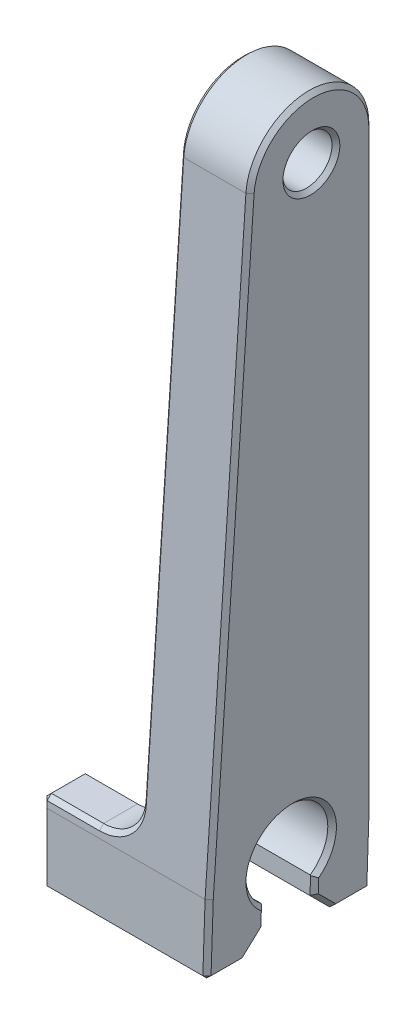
ISO-10303-21;
HEADER;
FILE_DESCRIPTION(('STEP AP214'),'2;1');
FILE_NAME('part.step','',(''),(''),'','','');
FILE_SCHEMA(('AUTOMOTIVE_DESIGN { 1 0 10303 214 1 1 1 1 }'));
ENDSEC;
DATA;
#1=APPLICATION_CONTEXT('core data for automotive mechanical design processes');
#2=APPLICATION_PROTOCOL_DEFINITION('international standard','automotive_design',2000,#1);
#3=PRODUCT_CONTEXT('',#1,'mechanical');
#4=PRODUCT('Part','Part','',(#3));
#5=PRODUCT_RELATED_PRODUCT_CATEGORY('part','',(#4));
#6=PRODUCT_DEFINITION_FORMATION('','',#4);
#7=PRODUCT_DEFINITION_CONTEXT('part definition',#1,'design');
#8=PRODUCT_DEFINITION('design','',#6,#7);
#9=PRODUCT_DEFINITION_SHAPE('','',#8);
#10=(LENGTH_UNIT() NAMED_UNIT(*) SI_UNIT(.MILLI.,.METRE.));
#11=(NAMED_UNIT(*) PLANE_ANGLE_UNIT() SI_UNIT($,.RADIAN.));
#12=(NAMED_UNIT(*) SI_UNIT($,.STERADIAN.) SOLID_ANGLE_UNIT());
#13=UNCERTAINTY_MEASURE_WITH_UNIT(LENGTH_MEASURE(1.E-05),#10,'distance_accuracy_value','');
#14=(GEOMETRIC_REPRESENTATION_CONTEXT(3) GLOBAL_UNCERTAINTY_ASSIGNED_CONTEXT((#13)) GLOBAL_UNIT_ASSIGNED_CONTEXT((#10,
#11,#12)) REPRESENTATION_CONTEXT('',''));
#15=CARTESIAN_POINT('',(0.,0.,0.));
#16=DIRECTION('',(0.,0.,1.));
#17=DIRECTION('',(1.,0.,0.));
#18=AXIS2_PLACEMENT_3D('',#15,#16,#17);
#19=CARTESIAN_POINT('',(0.,0.,0.));
#20=DIRECTION('',(1.,0.,0.));
#21=DIRECTION('',(0.,0.,-1.));
#22=AXIS2_PLACEMENT_3D('',#19,#20,#21);
#23=PLANE('',#22);
#24=DIRECTION('',(0.,0.,1.));
#25=VECTOR('',#24,1.);
#26=CARTESIAN_POINT('',(0.,-82.5,0.));
#27=LINE('',#26,#25);
#28=CARTESIAN_POINT('',(0.,-82.5,5.70710678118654));
#29=VERTEX_POINT('',#28);
#30=CARTESIAN_POINT('',(0.,-82.5,9.5));
#31=VERTEX_POINT('',#30);
#32=EDGE_CURVE('E764',#29,#31,#27,.T.);
#33=ORIENTED_EDGE('',*,*,#32,.T.);
#34=DIRECTION('',(0.,1.,0.));
#35=VECTOR('',#34,1.);
#36=CARTESIAN_POINT('',(0.,0.,9.49999999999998));
#37=LINE('',#36,#35);
#38=CARTESIAN_POINT('',(0.,-74.30839524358,9.5));
#39=VERTEX_POINT('',#38);
#40=EDGE_CURVE('E11',#31,#39,#37,.T.);
#41=ORIENTED_EDGE('',*,*,#40,.T.);
#42=DIRECTION('',(0.,0.999436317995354,-0.0335715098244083));
#43=VECTOR('',#42,1.);
#44=CARTESIAN_POINT('',(0.,0.235000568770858,6.99605422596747));
#45=LINE('',#44,#43);
#46=CARTESIAN_POINT('',(0.,-73.5,9.47284564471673));
#47=VERTEX_POINT('',#46);
#48=EDGE_CURVE('E44',#39,#47,#45,.T.);
#49=ORIENTED_EDGE('',*,*,#48,.T.);
#50=DIRECTION('',(0.,0.,-1.));
#51=VECTOR('',#50,1.);
#52=CARTESIAN_POINT('',(0.,-73.5,0.));
#53=LINE('',#52,#51);
#54=CARTESIAN_POINT('',(0.,-73.5,5.44150714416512));
#55=VERTEX_POINT('',#54);
#56=EDGE_CURVE('E772',#47,#55,#53,.T.);
#57=ORIENTED_EDGE('',*,*,#56,.T.);
#58=CARTESIAN_POINT('',(0.,-74.3,0.));
#59=DIRECTION('',(1.,0.,0.));
#60=DIRECTION('',(0.,0.,-1.));
#61=AXIS2_PLACEMENT_3D('',#58,#59,#60);
#62=CIRCLE('',#61,5.5);
#63=CARTESIAN_POINT('',(0.,-78.5426406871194,3.5));
#64=VERTEX_POINT('',#63);
#65=EDGE_CURVE('E770',#55,#64,#62,.T.);
#66=ORIENTED_EDGE('',*,*,#65,.T.);
#67=DIRECTION('',(0.,-1.,0.));
#68=VECTOR('',#67,1.);
#69=CARTESIAN_POINT('',(0.,0.,3.5));
#70=LINE('',#69,#68);
#71=CARTESIAN_POINT('',(0.,-80.2928932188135,3.5));
#72=VERTEX_POINT('',#71);
#73=EDGE_CURVE('E768',#64,#72,#70,.T.);
#74=ORIENTED_EDGE('',*,*,#73,.T.);
#75=DIRECTION('',(0.,-0.707106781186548,0.707106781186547));
#76=VECTOR('',#75,1.);
#77=CARTESIAN_POINT('',(0.,-38.3964466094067,-38.3964466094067));
#78=LINE('',#77,#76);
#79=EDGE_CURVE('E766',#72,#29,#78,.T.);
#80=ORIENTED_EDGE('',*,*,#79,.T.);
#81=EDGE_LOOP('',(#33,#41,#49,#57,#66,#74,#80));
#82=FACE_BOUND('',#81,.T.);
#83=ADVANCED_FACE('F31',(#82),#23,.F.);
#84=DIRECTION('',(0.,0.707106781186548,0.707106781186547));
#85=VECTOR('',#84,1.);
#86=CARTESIAN_POINT('',(0.,-38.3964466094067,38.3964466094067));
#87=LINE('',#86,#85);
#88=CARTESIAN_POINT('',(0.,-82.5,-5.70710678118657));
#89=VERTEX_POINT('',#88);
#90=CARTESIAN_POINT('',(0.,-80.2928932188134,-3.50000000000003));
#91=VERTEX_POINT('',#90);
#92=EDGE_CURVE('E747',#89,#91,#87,.T.);
#93=ORIENTED_EDGE('',*,*,#92,.T.);
#94=DIRECTION('',(0.,1.,0.));
#95=VECTOR('',#94,1.);
#96=CARTESIAN_POINT('',(0.,0.,-3.50000000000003));
#97=LINE('',#96,#95);
#98=CARTESIAN_POINT('',(0.,-78.5426406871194,-3.49999999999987));
#99=VERTEX_POINT('',#98);
#100=EDGE_CURVE('E749',#91,#99,#97,.T.);
#101=ORIENTED_EDGE('',*,*,#100,.T.);
#102=CARTESIAN_POINT('',(0.,-74.3,0.));
#103=DIRECTION('',(1.,0.,0.));
#104=DIRECTION('',(0.,0.,-1.));
#105=AXIS2_PLACEMENT_3D('',#102,#103,#104);
#106=CIRCLE('',#105,5.50000000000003);
#107=CARTESIAN_POINT('',(0.,-73.5,-5.44150714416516));
#108=VERTEX_POINT('',#107);
#109=EDGE_CURVE('E743',#99,#108,#106,.T.);
#110=ORIENTED_EDGE('',*,*,#109,.T.);
#111=DIRECTION('',(0.,0.,-1.));
#112=VECTOR('',#111,1.);
#113=CARTESIAN_POINT('',(0.,-73.5,0.));
#114=LINE('',#113,#112);
#115=CARTESIAN_POINT('',(0.,-73.5,-9.4728456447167));
#116=VERTEX_POINT('',#115);
#117=EDGE_CURVE('E741',#108,#116,#114,.T.);
#118=ORIENTED_EDGE('',*,*,#117,.T.);
#119=DIRECTION('',(0.,-0.999436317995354,-0.0335715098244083));
#120=VECTOR('',#119,1.);
#121=CARTESIAN_POINT('',(0.,0.235000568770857,-6.99605422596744));
#122=LINE('',#121,#120);
#123=CARTESIAN_POINT('',(0.,-74.30839524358,-9.49999999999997));
#124=VERTEX_POINT('',#123);
#125=EDGE_CURVE('E739',#116,#124,#122,.T.);
#126=ORIENTED_EDGE('',*,*,#125,.T.);
#127=DIRECTION('',(0.,-1.,0.));
#128=VECTOR('',#127,1.);
#129=CARTESIAN_POINT('',(0.,0.,-9.49999999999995));
#130=LINE('',#129,#128);
#131=CARTESIAN_POINT('',(0.,-82.5,-9.49999999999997));
#132=VERTEX_POINT('',#131);
#133=EDGE_CURVE('E735',#124,#132,#130,.T.);
#134=ORIENTED_EDGE('',*,*,#133,.T.);
#135=DIRECTION('',(0.,0.,1.));
#136=VECTOR('',#135,1.);
#137=CARTESIAN_POINT('',(0.,-82.5,0.));
#138=LINE('',#137,#136);
#139=EDGE_CURVE('E745',#132,#89,#138,.T.);
#140=ORIENTED_EDGE('',*,*,#139,.T.);
#141=EDGE_LOOP('',(#93,#101,#110,#118,#126,#134,#140));
#142=FACE_BOUND('',#141,.T.);
#143=ADVANCED_FACE('F474',(#142),#23,.F.);
#144=CARTESIAN_POINT('',(23.,0.,0.));
#145=DIRECTION('',(-1.,0.,0.));
#146=DIRECTION('',(0.,0.,1.));
#147=AXIS2_PLACEMENT_3D('',#144,#145,#146);
#148=CYLINDRICAL_SURFACE('',#147,7.5);
#149=DIRECTION('',(-1.,0.,0.));
#150=VECTOR('',#149,1.);
#151=CARTESIAN_POINT('',(23.,0.251786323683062,7.49577238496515));
#152=LINE('',#151,#150);
#153=CARTESIAN_POINT('',(22.2598331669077,0.251786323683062,7.49577238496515));
#154=VERTEX_POINT('',#153);
#155=CARTESIAN_POINT('',(14.6788450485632,0.251786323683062,7.49577238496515));
#156=VERTEX_POINT('',#155);
#157=EDGE_CURVE('E430',#154,#156,#152,.T.);
#158=ORIENTED_EDGE('',*,*,#157,.F.);
#159=CARTESIAN_POINT('',(22.2598331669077,0.251786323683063,-7.49577238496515));
#160=CARTESIAN_POINT('',(22.3193820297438,2.17493129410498,-7.43850494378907));
#161=CARTESIAN_POINT('',(22.3775706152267,4.0541457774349,-6.59664067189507));
#162=CARTESIAN_POINT('',(22.4603964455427,6.72902605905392,-3.83040134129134));
#163=CARTESIAN_POINT('',(22.484269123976,7.5,-1.92399745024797));
#164=CARTESIAN_POINT('',(22.484269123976,7.50000000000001,1.92399745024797));
#165=CARTESIAN_POINT('',(22.4603964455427,6.72902605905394,3.83040134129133));
#166=CARTESIAN_POINT('',(22.3775706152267,4.0541457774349,6.59664067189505));
#167=CARTESIAN_POINT('',(22.3193820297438,2.17493129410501,7.43850494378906));
#168=CARTESIAN_POINT('',(22.2598331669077,0.251786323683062,7.49577238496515));
#169=B_SPLINE_CURVE_WITH_KNOTS('',3,(#159,#160,#161,#162,#163,#164,#165,#166,#167,#168),
.UNSPECIFIED.,.F.,.F.,(4,2,2,2,4),(1.60437414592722,2.37298339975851,3.14159265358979,
3.91020190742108,4.67881116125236),.UNSPECIFIED.);
#170=CARTESIAN_POINT('',(22.2598331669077,0.251786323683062,-7.49577238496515));
#171=VERTEX_POINT('',#170);
#172=EDGE_CURVE('E495',#154,#171,#169,.F.);
#173=ORIENTED_EDGE('',*,*,#172,.T.);
#174=DIRECTION('',(-1.,0.,0.));
#175=VECTOR('',#174,1.);
#176=CARTESIAN_POINT('',(23.,0.251786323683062,-7.49577238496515));
#177=LINE('',#176,#175);
#178=CARTESIAN_POINT('',(14.6788450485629,0.251786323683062,-7.49577238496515));
#179=VERTEX_POINT('',#178);
#180=EDGE_CURVE('E647',#171,#179,#177,.T.);
#181=ORIENTED_EDGE('',*,*,#180,.T.);
#182=CARTESIAN_POINT('',(14.6788450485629,0.251786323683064,7.49577238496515));
#183=CARTESIAN_POINT('',(14.7382408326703,2.17493129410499,7.43850494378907));
#184=CARTESIAN_POINT('',(14.7962798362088,4.05414577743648,6.59664067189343));
#185=CARTESIAN_POINT('',(14.8788927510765,6.72902605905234,3.83040134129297));
#186=CARTESIAN_POINT('',(14.9027040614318,7.5,1.92399745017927));
#187=CARTESIAN_POINT('',(14.9027040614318,7.5,-1.92399745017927));
#188=CARTESIAN_POINT('',(14.8788927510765,6.72902605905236,-3.83040134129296));
#189=CARTESIAN_POINT('',(14.7962798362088,4.05414577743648,-6.59664067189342));
#190=CARTESIAN_POINT('',(14.7382408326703,2.17493129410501,-7.43850494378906));
#191=CARTESIAN_POINT('',(14.6788450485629,0.251786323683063,-7.49577238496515));
#192=B_SPLINE_CURVE_WITH_KNOTS('',3,(#182,#183,#184,#185,#186,#187,#188,#189,#190,#191),
.UNSPECIFIED.,.F.,.F.,(4,2,2,2,4),(1.60437414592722,2.37298339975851,3.14159265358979,
3.91020190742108,4.67881116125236),.UNSPECIFIED.);
#193=EDGE_CURVE('E1205',#179,#156,#192,.F.);
#194=ORIENTED_EDGE('',*,*,#193,.T.);
#195=EDGE_LOOP('',(#158,#173,#181,#194));
#196=FACE_BOUND('',#195,.T.);
#197=ADVANCED_FACE('F469',(#196),#148,.T.);
#198=CARTESIAN_POINT('',(23.,-74.3,10.));
#199=DIRECTION('',(0.,-0.0335715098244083,-0.999436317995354));
#200=DIRECTION('',(0.,0.999436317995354,-0.0335715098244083));
#201=AXIS2_PLACEMENT_3D('',#198,#199,#200);
#202=PLANE('',#201);
#203=ORIENTED_EDGE('',*,*,#157,.T.);
#204=DIRECTION('',(-0.0331365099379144,-0.99888746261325,0.0335530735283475));
#205=VECTOR('',#204,1.);
#206=CARTESIAN_POINT('',(12.2175600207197,-73.9427127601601,9.98799856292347));
#207=LINE('',#206,#205);
#208=CARTESIAN_POINT('',(12.4091893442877,-68.1661198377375,9.79396024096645));
#209=VERTEX_POINT('',#208);
#210=EDGE_CURVE('E1801',#156,#209,#207,.T.);
#211=ORIENTED_EDGE('',*,*,#210,.T.);
#212=CARTESIAN_POINT('',(6.87792036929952,-73.5169403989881,9.9736966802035));
#213=CARTESIAN_POINT('',(8.29803026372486,-73.5223532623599,9.97387850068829));
#214=CARTESIAN_POINT('',(9.70516122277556,-72.9477124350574,9.95457606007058));
#215=CARTESIAN_POINT('',(11.7465366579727,-70.9729334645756,9.88824235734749));
#216=CARTESIAN_POINT('',(12.3675152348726,-69.5856284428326,9.84164216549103));
#217=CARTESIAN_POINT('',(12.4091893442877,-68.1661198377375,9.79396024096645));
#218=B_SPLINE_CURVE_WITH_KNOTS('',3,(#212,#213,#214,#215,#216,#217),.UNSPECIFIED.,.F.,.F.,(4,2,
4),(4.74555023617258,5.51436777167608,6.28318530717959),.UNSPECIFIED.);
#219=CARTESIAN_POINT('',(6.87792036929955,-73.5169403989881,9.9736966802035));
#220=VERTEX_POINT('',#219);
#221=EDGE_CURVE('E451',#209,#220,#218,.F.);
#222=ORIENTED_EDGE('',*,*,#221,.T.);
#223=DIRECTION('',(-1.,0.,0.));
#224=VECTOR('',#223,1.);
#225=CARTESIAN_POINT('',(23.,-73.5169403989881,9.9736966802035));
#226=LINE('',#225,#224);
#227=CARTESIAN_POINT('',(0.5,-73.5169403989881,9.9736966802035));
#228=VERTEX_POINT('',#227);
#229=EDGE_CURVE('E447',#220,#228,#226,.T.);
#230=ORIENTED_EDGE('',*,*,#229,.T.);
#231=DIRECTION('',(0.,-0.999436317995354,0.0335715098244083));
#232=VECTOR('',#231,1.);
#233=CARTESIAN_POINT('',(0.5,-74.3,10.));
#234=LINE('',#233,#232);
#235=CARTESIAN_POINT('',(0.5,-74.3,10.));
#236=VERTEX_POINT('',#235);
#237=EDGE_CURVE('E443',#228,#236,#234,.T.);
#238=ORIENTED_EDGE('',*,*,#237,.T.);
#239=DIRECTION('',(-1.,0.,0.));
#240=VECTOR('',#239,1.);
#241=CARTESIAN_POINT('',(23.,-74.3,10.));
#242=LINE('',#241,#240);
#243=CARTESIAN_POINT('',(19.7861394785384,-74.3,10.));
#244=VERTEX_POINT('',#243);
#245=EDGE_CURVE('E427',#244,#236,#242,.T.);
#246=ORIENTED_EDGE('',*,*,#245,.F.);
#247=DIRECTION('',(-0.0665965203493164,-0.9972175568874,0.033496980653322));
#248=VECTOR('',#247,1.);
#249=CARTESIAN_POINT('',(19.7932277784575,-74.1938596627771,9.9964346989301));
#250=LINE('',#249,#248);
#251=CARTESIAN_POINT('',(19.7872447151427,-74.2834501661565,9.99944408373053));
#252=VERTEX_POINT('',#251);
#253=EDGE_CURVE('E438',#244,#252,#250,.F.);
#254=ORIENTED_EDGE('',*,*,#253,.T.);
#255=DIRECTION('',(0.0331365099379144,0.99888746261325,-0.0335530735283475));
#256=VECTOR('',#255,1.);
#257=CARTESIAN_POINT('',(19.7902239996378,-74.1936407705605,9.99642734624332));
#258=LINE('',#257,#256);
#259=EDGE_CURVE('E440',#252,#154,#258,.T.);
#260=ORIENTED_EDGE('',*,*,#259,.T.);
#261=EDGE_LOOP('',(#203,#211,#222,#230,#238,#246,#254,#260));
#262=FACE_BOUND('',#261,.T.);
#263=ADVANCED_FACE('F458',(#262),#202,.F.);
#264=CARTESIAN_POINT('',(23.,-74.3,10.));
#265=DIRECTION('',(0.,0.,-1.));
#266=DIRECTION('',(0.,1.,0.));
#267=AXIS2_PLACEMENT_3D('',#264,#265,#266);
#268=PLANE('',#267);
#269=ORIENTED_EDGE('',*,*,#245,.T.);
#270=DIRECTION('',(0.,-1.,0.));
#271=VECTOR('',#270,1.);
#272=CARTESIAN_POINT('',(0.5,-74.3,10.));
#273=LINE('',#272,#271);
#274=CARTESIAN_POINT('',(0.5,-82.5,10.));
#275=VERTEX_POINT('',#274);
#276=EDGE_CURVE('E762',#236,#275,#273,.T.);
#277=ORIENTED_EDGE('',*,*,#276,.T.);
#278=DIRECTION('',(1.,0.,0.));
#279=VECTOR('',#278,1.);
#280=CARTESIAN_POINT('',(23.,-82.5,10.));
#281=LINE('',#280,#279);
#282=CARTESIAN_POINT('',(19.5141174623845,-82.5,10.));
#283=VERTEX_POINT('',#282);
#284=EDGE_CURVE('E758',#275,#283,#281,.T.);
#285=ORIENTED_EDGE('',*,*,#284,.T.);
#286=DIRECTION('',(0.0331551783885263,0.999450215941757,0.));
#287=VECTOR('',#286,1.);
#288=CARTESIAN_POINT('',(19.7896723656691,-74.1935024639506,10.));
#289=LINE('',#288,#287);
#290=EDGE_CURVE('E760',#283,#244,#289,.T.);
#291=ORIENTED_EDGE('',*,*,#290,.T.);
#292=EDGE_LOOP('',(#269,#277,#285,#291));
#293=FACE_BOUND('',#292,.T.);
#294=ADVANCED_FACE('F468',(#293),#268,.F.);
#295=CARTESIAN_POINT('',(23.,-83.,5.5));
#296=DIRECTION('',(0.,1.,0.));
#297=DIRECTION('',(0.,0.,1.));
#298=AXIS2_PLACEMENT_3D('',#295,#296,#297);
#299=PLANE('',#298);
#300=DIRECTION('',(-1.,0.,0.));
#301=VECTOR('',#300,1.);
#302=CARTESIAN_POINT('',(23.,-83.,5.5));
#303=LINE('',#302,#301);
#304=CARTESIAN_POINT('',(19.480365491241,-83.,5.5));
#305=VERTEX_POINT('',#304);
#306=CARTESIAN_POINT('',(0.5,-83.,5.5));
#307=VERTEX_POINT('',#306);
#308=EDGE_CURVE('E326',#305,#307,#303,.T.);
#309=ORIENTED_EDGE('',*,*,#308,.F.);
#310=DIRECTION('',(0.,0.,1.));
#311=VECTOR('',#310,1.);
#312=CARTESIAN_POINT('',(19.480365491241,-83.,5.5));
#313=LINE('',#312,#311);
#314=CARTESIAN_POINT('',(19.480365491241,-83.,9.5));
#315=VERTEX_POINT('',#314);
#316=EDGE_CURVE('E436',#305,#315,#313,.T.);
#317=ORIENTED_EDGE('',*,*,#316,.T.);
#318=DIRECTION('',(-1.,0.,0.));
#319=VECTOR('',#318,1.);
#320=CARTESIAN_POINT('',(23.,-83.,9.5));
#321=LINE('',#320,#319);
#322=CARTESIAN_POINT('',(0.5,-83.,9.5));
#323=VERTEX_POINT('',#322);
#324=EDGE_CURVE('E316',#315,#323,#321,.T.);
#325=ORIENTED_EDGE('',*,*,#324,.T.);
#326=DIRECTION('',(0.,0.,-1.));
#327=VECTOR('',#326,1.);
#328=CARTESIAN_POINT('',(0.5,-83.,5.5));
#329=LINE('',#328,#327);
#330=EDGE_CURVE('E1167',#323,#307,#329,.T.);
#331=ORIENTED_EDGE('',*,*,#330,.T.);
#332=EDGE_LOOP('',(#309,#317,#325,#331));
#333=FACE_BOUND('',#332,.T.);
#334=ADVANCED_FACE('F1688',(#333),#299,.F.);
#335=CARTESIAN_POINT('',(23.,-80.5,3.));
#336=DIRECTION('',(0.,0.707106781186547,0.707106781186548));
#337=DIRECTION('',(0.,-0.707106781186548,0.707106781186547));
#338=AXIS2_PLACEMENT_3D('',#335,#336,#337);
#339=PLANE('',#338);
#340=DIRECTION('',(-1.,0.,0.));
#341=VECTOR('',#340,1.);
#342=CARTESIAN_POINT('',(23.,-80.5,3.));
#343=LINE('',#342,#341);
#344=CARTESIAN_POINT('',(19.5684507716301,-80.5,3.));
#345=VERTEX_POINT('',#344);
#346=CARTESIAN_POINT('',(0.5,-80.5,3.));
#347=VERTEX_POINT('',#346);
#348=EDGE_CURVE('E309',#345,#347,#343,.T.);
#349=ORIENTED_EDGE('',*,*,#348,.F.);
#350=DIRECTION('',(-0.0234506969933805,-0.706912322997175,0.706912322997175));
#351=VECTOR('',#350,1.);
#352=CARTESIAN_POINT('',(19.5703379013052,-80.4431131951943,2.9431131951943));
#353=LINE('',#352,#351);
#354=CARTESIAN_POINT('',(19.4856822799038,-82.9950246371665,5.49502463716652));
#355=VERTEX_POINT('',#354);
#356=EDGE_CURVE('E322',#345,#355,#353,.T.);
#357=ORIENTED_EDGE('',*,*,#356,.T.);
#358=DIRECTION('',(0.602871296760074,0.564156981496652,-0.564156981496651));
#359=VECTOR('',#358,1.);
#360=CARTESIAN_POINT('',(19.480365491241,-83.,5.5));
#361=LINE('',#360,#359);
#362=EDGE_CURVE('E335',#355,#305,#361,.F.);
#363=ORIENTED_EDGE('',*,*,#362,.T.);
#364=ORIENTED_EDGE('',*,*,#308,.T.);
#365=DIRECTION('',(0.,0.707106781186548,-0.707106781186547));
#366=VECTOR('',#365,1.);
#367=CARTESIAN_POINT('',(0.5,-80.5,3.));
#368=LINE('',#367,#366);
#369=EDGE_CURVE('E325',#307,#347,#368,.T.);
#370=ORIENTED_EDGE('',*,*,#369,.T.);
#371=EDGE_LOOP('',(#349,#357,#363,#364,#370));
#372=FACE_BOUND('',#371,.T.);
#373=ADVANCED_FACE('F321',(#372),#339,.F.);
#374=CARTESIAN_POINT('',(23.,-78.3,3.));
#375=DIRECTION('',(0.,0.,1.));
#376=DIRECTION('',(1.,0.,0.));
#377=AXIS2_PLACEMENT_3D('',#374,#375,#376);
#378=PLANE('',#377);
#379=DIRECTION('',(-0.0331551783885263,-0.999450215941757,0.));
#380=VECTOR('',#379,1.);
#381=CARTESIAN_POINT('',(19.6571245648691,-78.1891054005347,3.));
#382=LINE('',#381,#380);
#383=CARTESIAN_POINT('',(19.6515510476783,-78.3571169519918,3.));
#384=VERTEX_POINT('',#383);
#385=CARTESIAN_POINT('',(19.5810142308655,-80.4834224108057,3.));
#386=VERTEX_POINT('',#385);
#387=EDGE_CURVE('E312',#384,#386,#382,.T.);
#388=ORIENTED_EDGE('',*,*,#387,.T.);
#389=DIRECTION('',(0.604000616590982,0.796983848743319,0.));
#390=VECTOR('',#389,1.);
#391=CARTESIAN_POINT('',(19.5965233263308,-80.4629580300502,3.));
#392=LINE('',#391,#390);
#393=EDGE_CURVE('E306',#386,#345,#392,.F.);
#394=ORIENTED_EDGE('',*,*,#393,.T.);
#395=ORIENTED_EDGE('',*,*,#348,.T.);
#396=DIRECTION('',(0.,1.,0.));
#397=VECTOR('',#396,1.);
#398=CARTESIAN_POINT('',(0.5,-78.3,3.));
#399=LINE('',#398,#397);
#400=CARTESIAN_POINT('',(0.5,-78.3,3.));
#401=VERTEX_POINT('',#400);
#402=EDGE_CURVE('E419',#347,#401,#399,.T.);
#403=ORIENTED_EDGE('',*,*,#402,.T.);
#404=DIRECTION('',(-1.,0.,0.));
#405=VECTOR('',#404,1.);
#406=CARTESIAN_POINT('',(23.,-78.3,3.));
#407=LINE('',#406,#405);
#408=CARTESIAN_POINT('',(19.6053830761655,-78.3,3.));
#409=VERTEX_POINT('',#408);
#410=EDGE_CURVE('E327',#409,#401,#407,.T.);
#411=ORIENTED_EDGE('',*,*,#410,.F.);
#412=CARTESIAN_POINT('',(19.6515510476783,-78.3571169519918,3.));
#413=CARTESIAN_POINT('',(19.649637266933,-78.3546966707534,3.00001293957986));
#414=CARTESIAN_POINT('',(19.6477232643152,-78.3522765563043,3.0000242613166));
#415=CARTESIAN_POINT('',(19.6438952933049,-78.3474372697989,3.00004366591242));
#416=CARTESIAN_POINT('',(19.6419813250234,-78.3450180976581,3.00005174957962));
#417=CARTESIAN_POINT('',(19.6381534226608,-78.3401806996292,3.000064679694));
#418=CARTESIAN_POINT('',(19.6362394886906,-78.3377624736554,3.00006952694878));
#419=CARTESIAN_POINT('',(19.6324116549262,-78.3329269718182,3.00007598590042));
#420=CARTESIAN_POINT('',(19.6304977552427,-78.3305096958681,3.00007759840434));
#421=CARTESIAN_POINT('',(19.6266699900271,-78.3256760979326,3.0000775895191));
#422=CARTESIAN_POINT('',(19.6247561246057,-78.3232597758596,3.00007596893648));
#423=CARTESIAN_POINT('',(19.6209284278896,-78.3184280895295,3.00006949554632));
#424=CARTESIAN_POINT('',(19.6190145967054,-78.3160127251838,3.00006464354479));
#425=CARTESIAN_POINT('',(19.6151869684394,-78.3111829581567,3.00005170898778));
#426=CARTESIAN_POINT('',(19.6132731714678,-78.3087685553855,3.00004362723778));
#427=CARTESIAN_POINT('',(19.6094456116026,-78.3039407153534,3.00002423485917));
#428=CARTESIAN_POINT('',(19.6075318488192,-78.3015272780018,3.00001292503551));
#429=CARTESIAN_POINT('',(19.6056178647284,-78.2991140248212,3.));
#430=B_SPLINE_CURVE_WITH_KNOTS('',3,(#412,#413,#414,#415,#416,#417,#418,#419,#420,#421,#422,
#423,#424,#425,#426,#427,#428,#429),.UNSPECIFIED.,.F.,.F.,(4,2,2,2,2,2,2,2,4),(0.,
0.00925658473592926,0.0185108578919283,0.0277628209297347,0.0370124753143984,0.0462598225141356,
0.0555048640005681,0.0647476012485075,0.0739880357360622),.UNSPECIFIED.);
#431=EDGE_CURVE('E317',#409,#384,#430,.F.);
#432=ORIENTED_EDGE('',*,*,#431,.T.);
#433=EDGE_LOOP('',(#388,#394,#395,#403,#411,#432));
#434=FACE_BOUND('',#433,.T.);
#435=ADVANCED_FACE('F308',(#434),#378,.F.);
#436=CARTESIAN_POINT('',(23.,-74.3,0.));
#437=DIRECTION('',(-1.,0.,0.));
#438=DIRECTION('',(0.,0.,1.));
#439=AXIS2_PLACEMENT_3D('',#436,#437,#438);
#440=CYLINDRICAL_SURFACE('',#439,5.);
#441=DIRECTION('',(-1.,0.,0.));
#442=VECTOR('',#441,1.);
#443=CARTESIAN_POINT('',(23.,-78.3,-3.));
#444=LINE('',#443,#442);
#445=CARTESIAN_POINT('',(19.6053830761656,-78.3,-3.));
#446=VERTEX_POINT('',#445);
#447=CARTESIAN_POINT('',(0.500000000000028,-78.3,-3.));
#448=VERTEX_POINT('',#447);
#449=EDGE_CURVE('E418',#446,#448,#444,.T.);
#450=ORIENTED_EDGE('',*,*,#449,.F.);
#451=CARTESIAN_POINT('',(19.5827787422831,-78.9174956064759,1.91800269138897));
#452=CARTESIAN_POINT('',(19.5987630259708,-78.4808437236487,2.97745068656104));
#453=CARTESIAN_POINT('',(19.6286392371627,-77.6646980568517,3.87193774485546));
#454=CARTESIAN_POINT('',(19.7026574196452,-75.6427007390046,4.95078272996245));
#455=CARTESIAN_POINT('',(19.7464685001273,-74.4458882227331,5.12755414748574));
#456=CARTESIAN_POINT('',(19.8287433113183,-72.1983398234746,4.67932894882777));
#457=CARTESIAN_POINT('',(19.8667205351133,-71.160894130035,4.0569827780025));
#458=CARTESIAN_POINT('',(19.9199268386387,-69.707426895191,2.28503111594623));
#459=CARTESIAN_POINT('',(19.9348412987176,-69.3,1.1459035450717));
#460=CARTESIAN_POINT('',(19.9348412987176,-69.3,-1.1459035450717));
#461=CARTESIAN_POINT('',(19.9199268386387,-69.707426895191,-2.28503111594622));
#462=CARTESIAN_POINT('',(19.8667205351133,-71.160894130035,-4.0569827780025));
#463=CARTESIAN_POINT('',(19.8287433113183,-72.1983398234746,-4.67932894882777));
#464=CARTESIAN_POINT('',(19.7464685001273,-74.4458882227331,-5.12755414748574));
#465=CARTESIAN_POINT('',(19.7026574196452,-75.6427007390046,-4.95078272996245));
#466=CARTESIAN_POINT('',(19.6286392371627,-77.6646980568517,-3.87193774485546));
#467=CARTESIAN_POINT('',(19.5987630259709,-78.4808437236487,-2.97745068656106));
#468=CARTESIAN_POINT('',(19.5827787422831,-78.9174956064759,-1.91800269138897));
#469=B_SPLINE_CURVE_WITH_KNOTS('',3,(#451,#452,#453,#454,#455,#456,#457,#458,#459,#460,#461,
#462,#463,#464,#465,#466,#467,#468),.UNSPECIFIED.,.F.,.F.,(4,2,2,2,2,2,2,2,4),
(0.393691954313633,1.08066712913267,1.76764230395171,2.45461747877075,3.14159265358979,
3.82856782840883,4.51554300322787,5.20251817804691,5.88949335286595),.UNSPECIFIED.);
#470=EDGE_CURVE('E587',#446,#409,#469,.F.);
#471=ORIENTED_EDGE('',*,*,#470,.T.);
#472=ORIENTED_EDGE('',*,*,#410,.T.);
#473=CARTESIAN_POINT('',(0.5,-74.3,0.));
#474=DIRECTION('',(1.,0.,0.));
#475=DIRECTION('',(0.,0.,-1.));
#476=AXIS2_PLACEMENT_3D('',#473,#474,#475);
#477=CIRCLE('',#476,5.);
#478=CARTESIAN_POINT('',(0.5,-73.4082140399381,4.91982904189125));
#479=VERTEX_POINT('',#478);
#480=EDGE_CURVE('E562',#401,#479,#477,.F.);
#481=ORIENTED_EDGE('',*,*,#480,.T.);
#482=DIRECTION('',(-1.,0.,0.));
#483=VECTOR('',#482,1.);
#484=CARTESIAN_POINT('',(23.,-73.4082140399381,4.91982904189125));
#485=LINE('',#484,#483);
#486=CARTESIAN_POINT('',(6.87792036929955,-73.4082140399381,4.91982904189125));
#487=VERTEX_POINT('',#486);
#488=EDGE_CURVE('E564',#479,#487,#485,.F.);
#489=ORIENTED_EDGE('',*,*,#488,.T.);
#490=CARTESIAN_POINT('',(6.87792036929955,-73.4082140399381,-4.91982904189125));
#491=CARTESIAN_POINT('',(7.74947855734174,-73.4099953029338,-4.9177669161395));
#492=CARTESIAN_POINT('',(8.62182922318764,-73.2039526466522,-4.89230528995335));
#493=CARTESIAN_POINT('',(10.1481849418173,-72.4566112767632,-4.66592234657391));
#494=CARTESIAN_POINT('',(10.7929155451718,-71.9093394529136,-4.44245060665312));
#495=CARTESIAN_POINT('',(11.6548387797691,-70.7680496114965,-3.61501051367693));
#496=CARTESIAN_POINT('',(11.8831513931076,-70.2320740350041,-3.01597628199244));
#497=CARTESIAN_POINT('',(12.1122994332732,-69.4982008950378,-1.60224601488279));
#498=CARTESIAN_POINT('',(12.1383192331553,-69.2994416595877,-0.799675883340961));
#499=CARTESIAN_POINT('',(12.1380605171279,-69.300560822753,0.806721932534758));
#500=CARTESIAN_POINT('',(12.1117352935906,-69.5014129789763,1.61219056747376));
#501=CARTESIAN_POINT('',(11.8802170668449,-70.2398850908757,3.02714129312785));
#502=CARTESIAN_POINT('',(11.6494101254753,-70.7787611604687,3.62597730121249));
#503=CARTESIAN_POINT('',(10.7805911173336,-71.9215919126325,4.44831314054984));
#504=CARTESIAN_POINT('',(10.1383769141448,-72.4622805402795,4.66746047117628));
#505=CARTESIAN_POINT('',(8.61702386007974,-73.2054550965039,4.89296973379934));
#506=CARTESIAN_POINT('',(7.74728753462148,-73.410056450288,4.91782462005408));
#507=CARTESIAN_POINT('',(6.87792036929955,-73.4082140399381,4.91982904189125));
#508=B_SPLINE_CURVE_WITH_KNOTS('',3,(#490,#491,#492,#493,#494,#495,#496,#497,#498,#499,#500,
#501,#502,#503,#504,#505,#506,#507),.UNSPECIFIED.,.F.,.F.,(4,2,2,2,2,2,2,2,4),(0.,
0.00259700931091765,0.00519401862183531,0.00779102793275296,0.0103880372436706,
0.0129850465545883,0.0155820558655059,0.0181790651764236,0.0207760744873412),.UNSPECIFIED.);
#509=CARTESIAN_POINT('',(6.87792036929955,-73.4082140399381,-4.91982904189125));
#510=VERTEX_POINT('',#509);
#511=EDGE_CURVE('E568',#487,#510,#508,.F.);
#512=ORIENTED_EDGE('',*,*,#511,.T.);
#513=DIRECTION('',(-1.,0.,0.));
#514=VECTOR('',#513,1.);
#515=CARTESIAN_POINT('',(23.,-73.4082140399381,-4.91982904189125));
#516=LINE('',#515,#514);
#517=CARTESIAN_POINT('',(0.500000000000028,-73.4082140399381,-4.91982904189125));
#518=VERTEX_POINT('',#517);
#519=EDGE_CURVE('E581',#510,#518,#516,.T.);
#520=ORIENTED_EDGE('',*,*,#519,.T.);
#521=CARTESIAN_POINT('',(0.500000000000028,-74.3,0.));
#522=DIRECTION('',(1.,0.,0.));
#523=DIRECTION('',(0.,0.,-1.));
#524=AXIS2_PLACEMENT_3D('',#521,#522,#523);
#525=CIRCLE('',#524,5.);
#526=EDGE_CURVE('E583',#518,#448,#525,.F.);
#527=ORIENTED_EDGE('',*,*,#526,.T.);
#528=EDGE_LOOP('',(#450,#471,#472,#481,#489,#512,#520,#527));
#529=FACE_BOUND('',#528,.T.);
#530=ADVANCED_FACE('F540',(#529),#440,.F.);
#531=CARTESIAN_POINT('',(23.,-78.3,-3.));
#532=DIRECTION('',(0.,0.,-1.));
#533=DIRECTION('',(-1.,0.,0.));
#534=AXIS2_PLACEMENT_3D('',#531,#532,#533);
#535=PLANE('',#534);
#536=DIRECTION('',(-1.,0.,0.));
#537=VECTOR('',#536,1.);
#538=CARTESIAN_POINT('',(23.,-80.5,-3.));
#539=LINE('',#538,#537);
#540=CARTESIAN_POINT('',(19.5684507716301,-80.5,-3.));
#541=VERTEX_POINT('',#540);
#542=CARTESIAN_POINT('',(0.500000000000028,-80.5,-3.));
#543=VERTEX_POINT('',#542);
#544=EDGE_CURVE('E1275',#541,#543,#539,.T.);
#545=ORIENTED_EDGE('',*,*,#544,.F.);
#546=DIRECTION('',(-0.604000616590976,-0.796983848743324,0.));
#547=VECTOR('',#546,1.);
#548=CARTESIAN_POINT('',(19.5965233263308,-80.4629580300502,-3.));
#549=LINE('',#548,#547);
#550=CARTESIAN_POINT('',(19.5810142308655,-80.4834224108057,-3.));
#551=VERTEX_POINT('',#550);
#552=EDGE_CURVE('E557',#541,#551,#549,.F.);
#553=ORIENTED_EDGE('',*,*,#552,.T.);
#554=DIRECTION('',(0.0331551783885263,0.999450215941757,0.));
#555=VECTOR('',#554,1.);
#556=CARTESIAN_POINT('',(19.6571245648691,-78.1891054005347,-3.));
#557=LINE('',#556,#555);
#558=CARTESIAN_POINT('',(19.6515510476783,-78.3571169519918,-3.));
#559=VERTEX_POINT('',#558);
#560=EDGE_CURVE('E550',#551,#559,#557,.T.);
#561=ORIENTED_EDGE('',*,*,#560,.T.);
#562=CARTESIAN_POINT('',(19.6056178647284,-78.2991140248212,-3.));
#563=CARTESIAN_POINT('',(19.6075318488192,-78.3015272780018,-3.00001292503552));
#564=CARTESIAN_POINT('',(19.6094456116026,-78.3039407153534,-3.00002423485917));
#565=CARTESIAN_POINT('',(19.6132731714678,-78.3087685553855,-3.00004362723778));
#566=CARTESIAN_POINT('',(19.6151869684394,-78.3111829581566,-3.00005170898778));
#567=CARTESIAN_POINT('',(19.6190145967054,-78.3160127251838,-3.00006464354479));
#568=CARTESIAN_POINT('',(19.6209284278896,-78.3184280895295,-3.00006949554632));
#569=CARTESIAN_POINT('',(19.6247561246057,-78.3232597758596,-3.00007596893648));
#570=CARTESIAN_POINT('',(19.6266699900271,-78.3256760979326,-3.0000775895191));
#571=CARTESIAN_POINT('',(19.6304977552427,-78.3305096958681,-3.00007759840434));
#572=CARTESIAN_POINT('',(19.6324116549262,-78.3329269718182,-3.00007598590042));
#573=CARTESIAN_POINT('',(19.6362394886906,-78.3377624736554,-3.00006952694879));
#574=CARTESIAN_POINT('',(19.6381534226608,-78.3401806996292,-3.000064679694));
#575=CARTESIAN_POINT('',(19.6419813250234,-78.3450180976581,-3.00005174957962));
#576=CARTESIAN_POINT('',(19.6438952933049,-78.3474372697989,-3.00004366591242));
#577=CARTESIAN_POINT('',(19.6477232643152,-78.3522765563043,-3.0000242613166));
#578=CARTESIAN_POINT('',(19.649637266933,-78.3546966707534,-3.00001293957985));
#579=CARTESIAN_POINT('',(19.6515510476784,-78.3571169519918,-3.));
#580=B_SPLINE_CURVE_WITH_KNOTS('',3,(#562,#563,#564,#565,#566,#567,#568,#569,#570,#571,#572,
#573,#574,#575,#576,#577,#578,#579),.UNSPECIFIED.,.F.,.F.,(4,2,2,2,2,2,2,2,4),(0.,
0.00924043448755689,0.0184831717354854,0.0277282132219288,0.0369755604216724,0.0462252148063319,
0.0554771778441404,0.0647314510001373,0.0739880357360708),.UNSPECIFIED.);
#581=EDGE_CURVE('E558',#559,#446,#580,.F.);
#582=ORIENTED_EDGE('',*,*,#581,.T.);
#583=ORIENTED_EDGE('',*,*,#449,.T.);
#584=DIRECTION('',(0.,-1.,0.));
#585=VECTOR('',#584,1.);
#586=CARTESIAN_POINT('',(0.500000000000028,-78.3,-3.));
#587=LINE('',#586,#585);
#588=EDGE_CURVE('E1288',#448,#543,#587,.T.);
#589=ORIENTED_EDGE('',*,*,#588,.T.);
#590=EDGE_LOOP('',(#545,#553,#561,#582,#583,#589));
#591=FACE_BOUND('',#590,.T.);
#592=ADVANCED_FACE('F535',(#591),#535,.F.);
#593=CARTESIAN_POINT('',(23.,-80.5,-3.));
#594=DIRECTION('',(0.,0.707106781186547,-0.707106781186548));
#595=DIRECTION('',(0.,0.707106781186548,0.707106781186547));
#596=AXIS2_PLACEMENT_3D('',#593,#594,#595);
#597=PLANE('',#596);
#598=DIRECTION('',(-1.,0.,0.));
#599=VECTOR('',#598,1.);
#600=CARTESIAN_POINT('',(23.,-83.,-5.5));
#601=LINE('',#600,#599);
#602=CARTESIAN_POINT('',(19.480365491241,-83.,-5.5));
#603=VERTEX_POINT('',#602);
#604=CARTESIAN_POINT('',(0.500000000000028,-83.,-5.5));
#605=VERTEX_POINT('',#604);
#606=EDGE_CURVE('E1272',#603,#605,#601,.T.);
#607=ORIENTED_EDGE('',*,*,#606,.F.);
#608=DIRECTION('',(-0.602871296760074,-0.564156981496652,-0.564156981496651));
#609=VECTOR('',#608,1.);
#610=CARTESIAN_POINT('',(19.480365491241,-83.,-5.5));
#611=LINE('',#610,#609);
#612=CARTESIAN_POINT('',(19.4856822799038,-82.9950246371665,-5.49502463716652));
#613=VERTEX_POINT('',#612);
#614=EDGE_CURVE('E1286',#603,#613,#611,.F.);
#615=ORIENTED_EDGE('',*,*,#614,.T.);
#616=DIRECTION('',(0.0234506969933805,0.706912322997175,0.706912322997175));
#617=VECTOR('',#616,1.);
#618=CARTESIAN_POINT('',(19.5703379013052,-80.4431131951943,-2.9431131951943));
#619=LINE('',#618,#617);
#620=EDGE_CURVE('E1290',#613,#541,#619,.T.);
#621=ORIENTED_EDGE('',*,*,#620,.T.);
#622=ORIENTED_EDGE('',*,*,#544,.T.);
#623=DIRECTION('',(0.,-0.707106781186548,-0.707106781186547));
#624=VECTOR('',#623,1.);
#625=CARTESIAN_POINT('',(0.500000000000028,-80.5,-3.));
#626=LINE('',#625,#624);
#627=EDGE_CURVE('E1294',#543,#605,#626,.T.);
#628=ORIENTED_EDGE('',*,*,#627,.T.);
#629=EDGE_LOOP('',(#607,#615,#621,#622,#628));
#630=FACE_BOUND('',#629,.T.);
#631=ADVANCED_FACE('F531',(#630),#597,.F.);
#632=CARTESIAN_POINT('',(23.,-83.,-5.5));
#633=DIRECTION('',(0.,1.,0.));
#634=DIRECTION('',(0.,0.,1.));
#635=AXIS2_PLACEMENT_3D('',#632,#633,#634);
#636=PLANE('',#635);
#637=DIRECTION('',(1.,0.,0.));
#638=VECTOR('',#637,1.);
#639=CARTESIAN_POINT('',(23.,-83.,-9.49999999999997));
#640=LINE('',#639,#638);
#641=CARTESIAN_POINT('',(0.500000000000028,-83.,-9.49999999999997));
#642=VERTEX_POINT('',#641);
#643=CARTESIAN_POINT('',(19.480365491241,-83.,-9.49999999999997));
#644=VERTEX_POINT('',#643);
#645=EDGE_CURVE('E1302',#642,#644,#640,.T.);
#646=ORIENTED_EDGE('',*,*,#645,.T.);
#647=DIRECTION('',(0.,0.,1.));
#648=VECTOR('',#647,1.);
#649=CARTESIAN_POINT('',(19.480365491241,-83.,-5.5));
#650=LINE('',#649,#648);
#651=EDGE_CURVE('E1296',#644,#603,#650,.T.);
#652=ORIENTED_EDGE('',*,*,#651,.T.);
#653=ORIENTED_EDGE('',*,*,#606,.T.);
#654=DIRECTION('',(0.,0.,-1.));
#655=VECTOR('',#654,1.);
#656=CARTESIAN_POINT('',(0.500000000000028,-83.,-5.5));
#657=LINE('',#656,#655);
#658=EDGE_CURVE('E1300',#605,#642,#657,.T.);
#659=ORIENTED_EDGE('',*,*,#658,.T.);
#660=EDGE_LOOP('',(#646,#652,#653,#659));
#661=FACE_BOUND('',#660,.T.);
#662=ADVANCED_FACE('F527',(#661),#636,.F.);
#663=CARTESIAN_POINT('',(23.,-74.3,-10.));
#664=DIRECTION('',(0.,0.,1.));
#665=DIRECTION('',(0.,-1.,0.));
#666=AXIS2_PLACEMENT_3D('',#663,#664,#665);
#667=PLANE('',#666);
#668=DIRECTION('',(-1.,0.,0.));
#669=VECTOR('',#668,1.);
#670=CARTESIAN_POINT('',(23.,-82.5,-10.));
#671=LINE('',#670,#669);
#672=CARTESIAN_POINT('',(19.5141174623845,-82.5,-10.));
#673=VERTEX_POINT('',#672);
#674=CARTESIAN_POINT('',(0.500000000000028,-82.5,-10.));
#675=VERTEX_POINT('',#674);
#676=EDGE_CURVE('E752',#673,#675,#671,.T.);
#677=ORIENTED_EDGE('',*,*,#676,.T.);
#678=DIRECTION('',(0.,1.,0.));
#679=VECTOR('',#678,1.);
#680=CARTESIAN_POINT('',(0.500000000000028,-74.3,-10.));
#681=LINE('',#680,#679);
#682=CARTESIAN_POINT('',(0.500000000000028,-74.3,-10.));
#683=VERTEX_POINT('',#682);
#684=EDGE_CURVE('E756',#675,#683,#681,.T.);
#685=ORIENTED_EDGE('',*,*,#684,.T.);
#686=DIRECTION('',(-1.,0.,0.));
#687=VECTOR('',#686,1.);
#688=CARTESIAN_POINT('',(23.,-74.3,-10.));
#689=LINE('',#688,#687);
#690=CARTESIAN_POINT('',(19.7861394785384,-74.3,-10.));
#691=VERTEX_POINT('',#690);
#692=EDGE_CURVE('E1268',#691,#683,#689,.T.);
#693=ORIENTED_EDGE('',*,*,#692,.F.);
#694=DIRECTION('',(-0.0331551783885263,-0.999450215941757,0.));
#695=VECTOR('',#694,1.);
#696=CARTESIAN_POINT('',(19.7896723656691,-74.1935024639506,-10.));
#697=LINE('',#696,#695);
#698=EDGE_CURVE('E754',#691,#673,#697,.T.);
#699=ORIENTED_EDGE('',*,*,#698,.T.);
#700=EDGE_LOOP('',(#677,#685,#693,#699));
#701=FACE_BOUND('',#700,.T.);
#702=ADVANCED_FACE('F523',(#701),#667,.F.);
#703=CARTESIAN_POINT('',(23.,-74.3,-10.));
#704=DIRECTION('',(0.,-0.0335715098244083,0.999436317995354));
#705=DIRECTION('',(0.,-0.999436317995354,-0.0335715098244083));
#706=AXIS2_PLACEMENT_3D('',#703,#704,#705);
#707=PLANE('',#706);
#708=CARTESIAN_POINT('',(12.4091893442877,-68.1661198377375,-9.79396024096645));
#709=CARTESIAN_POINT('',(12.3675152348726,-69.5856284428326,-9.84164216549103));
#710=CARTESIAN_POINT('',(11.7465366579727,-70.9729334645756,-9.8882423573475));
#711=CARTESIAN_POINT('',(9.70516122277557,-72.9477124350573,-9.95457606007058));
#712=CARTESIAN_POINT('',(8.29803026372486,-73.5223532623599,-9.9738785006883));
#713=CARTESIAN_POINT('',(6.87792036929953,-73.5169403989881,-9.9736966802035));
#714=B_SPLINE_CURVE_WITH_KNOTS('',3,(#708,#709,#710,#711,#712,#713),.UNSPECIFIED.,.F.,.F.,(4,2,
4),(3.14159265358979,3.91041018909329,4.6792277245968),.UNSPECIFIED.);
#715=CARTESIAN_POINT('',(6.87792036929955,-73.5169403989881,-9.9736966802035));
#716=VERTEX_POINT('',#715);
#717=CARTESIAN_POINT('',(12.4091893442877,-68.1661198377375,-9.79396024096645));
#718=VERTEX_POINT('',#717);
#719=EDGE_CURVE('E505',#716,#718,#714,.F.);
#720=ORIENTED_EDGE('',*,*,#719,.T.);
#721=DIRECTION('',(0.0331365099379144,0.99888746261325,0.0335530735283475));
#722=VECTOR('',#721,1.);
#723=CARTESIAN_POINT('',(12.2175600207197,-73.9427127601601,-9.98799856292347));
#724=LINE('',#723,#722);
#725=EDGE_CURVE('E1304',#718,#179,#724,.T.);
#726=ORIENTED_EDGE('',*,*,#725,.T.);
#727=ORIENTED_EDGE('',*,*,#180,.F.);
#728=DIRECTION('',(-0.0331365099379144,-0.99888746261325,-0.0335530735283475));
#729=VECTOR('',#728,1.);
#730=CARTESIAN_POINT('',(19.7902239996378,-74.1936407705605,-9.99642734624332));
#731=LINE('',#730,#729);
#732=CARTESIAN_POINT('',(19.7872447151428,-74.2834501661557,-9.99944408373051));
#733=VERTEX_POINT('',#732);
#734=EDGE_CURVE('E494',#171,#733,#731,.T.);
#735=ORIENTED_EDGE('',*,*,#734,.T.);
#736=DIRECTION('',(0.0665965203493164,0.9972175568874,0.033496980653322));
#737=VECTOR('',#736,1.);
#738=CARTESIAN_POINT('',(19.7932277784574,-74.1938596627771,-9.9964346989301));
#739=LINE('',#738,#737);
#740=EDGE_CURVE('E487',#733,#691,#739,.F.);
#741=ORIENTED_EDGE('',*,*,#740,.T.);
#742=ORIENTED_EDGE('',*,*,#692,.T.);
#743=DIRECTION('',(0.,0.999436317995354,0.0335715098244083));
#744=VECTOR('',#743,1.);
#745=CARTESIAN_POINT('',(0.500000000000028,-74.3,-10.));
#746=LINE('',#745,#744);
#747=CARTESIAN_POINT('',(0.500000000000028,-73.5169403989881,-9.9736966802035));
#748=VERTEX_POINT('',#747);
#749=EDGE_CURVE('E497',#683,#748,#746,.T.);
#750=ORIENTED_EDGE('',*,*,#749,.T.);
#751=DIRECTION('',(1.,0.,0.));
#752=VECTOR('',#751,1.);
#753=CARTESIAN_POINT('',(23.,-73.5169403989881,-9.9736966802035));
#754=LINE('',#753,#752);
#755=EDGE_CURVE('E501',#748,#716,#754,.T.);
#756=ORIENTED_EDGE('',*,*,#755,.T.);
#757=EDGE_LOOP('',(#720,#726,#727,#735,#741,#742,#750,#756));
#758=FACE_BOUND('',#757,.T.);
#759=ADVANCED_FACE('F512',(#758),#707,.F.);
#760=CARTESIAN_POINT('',(23.,0.,0.));
#761=DIRECTION('',(-1.,0.,0.));
#762=DIRECTION('',(0.,0.,1.));
#763=AXIS2_PLACEMENT_3D('',#760,#761,#762);
#764=CYLINDRICAL_SURFACE('',#763,3.);
#765=CARTESIAN_POINT('',(22.1516791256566,-3.,0.));
#766=CARTESIAN_POINT('',(22.1516791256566,-3.00000000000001,0.786499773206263));
#767=CARTESIAN_POINT('',(22.1640476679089,-2.67745965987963,1.56518102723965));
#768=CARTESIAN_POINT('',(22.2067005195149,-1.56518102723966,2.67745965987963));
#769=CARTESIAN_POINT('',(22.2365608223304,-0.786499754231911,3.));
#770=CARTESIAN_POINT('',(22.2968810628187,0.786499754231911,3.));
#771=CARTESIAN_POINT('',(22.3267413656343,1.56518102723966,2.67745965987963));
#772=CARTESIAN_POINT('',(22.3693942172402,2.67745965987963,1.56518102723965));
#773=CARTESIAN_POINT('',(22.3817627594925,3.,0.786499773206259));
#774=CARTESIAN_POINT('',(22.3817627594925,3.,-0.786499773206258));
#775=CARTESIAN_POINT('',(22.3693942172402,2.67745965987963,-1.56518102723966));
#776=CARTESIAN_POINT('',(22.3267413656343,1.56518102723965,-2.67745965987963));
#777=CARTESIAN_POINT('',(22.2968810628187,0.786499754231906,-3.));
#778=CARTESIAN_POINT('',(22.2365608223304,-0.786499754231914,-3.));
#779=CARTESIAN_POINT('',(22.2067005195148,-1.56518102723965,-2.67745965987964));
#780=CARTESIAN_POINT('',(22.1640476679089,-2.67745965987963,-1.56518102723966));
#781=CARTESIAN_POINT('',(22.1516791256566,-3.,-0.786499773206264));
#782=CARTESIAN_POINT('',(22.1516791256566,-3.,0.));
#783=B_SPLINE_CURVE_WITH_KNOTS('',3,(#765,#766,#767,#768,#769,#770,#771,#772,#773,#774,#775,
#776,#777,#778,#779,#780,#781,#782),.UNSPECIFIED.,.T.,.F.,(4,2,2,2,2,2,2,2,4),(0.,
0.785398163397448,1.5707963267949,2.35619449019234,3.14159265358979,3.92699081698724,
4.71238898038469,5.49778714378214,6.28318530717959),.UNSPECIFIED.);
#784=CARTESIAN_POINT('',(22.1516791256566,-3.,0.));
#785=VERTEX_POINT('',#784);
#786=EDGE_CURVE('E1116',#785,#785,#783,.F.);
#787=ORIENTED_EDGE('',*,*,#786,.T.);
#788=EDGE_LOOP('',(#787));
#789=FACE_BOUND('',#788,.T.);
#790=CARTESIAN_POINT('',(14.5058997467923,-3.,0.));
#791=CARTESIAN_POINT('',(14.5058997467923,-3.,-0.786499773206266));
#792=CARTESIAN_POINT('',(14.5182682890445,-2.67745965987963,-1.56518102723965));
#793=CARTESIAN_POINT('',(14.5609211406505,-1.56518102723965,-2.67745965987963));
#794=CARTESIAN_POINT('',(14.5907814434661,-0.786499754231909,-3.));
#795=CARTESIAN_POINT('',(14.6511016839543,0.78649975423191,-3.));
#796=CARTESIAN_POINT('',(14.6809619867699,1.56518102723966,-2.67745965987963));
#797=CARTESIAN_POINT('',(14.7236148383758,2.67745965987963,-1.56518102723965));
#798=CARTESIAN_POINT('',(14.7359833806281,3.,-0.78649977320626));
#799=CARTESIAN_POINT('',(14.7359833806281,3.,0.786499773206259));
#800=CARTESIAN_POINT('',(14.7236148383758,2.67745965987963,1.56518102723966));
#801=CARTESIAN_POINT('',(14.6809619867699,1.56518102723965,2.67745965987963));
#802=CARTESIAN_POINT('',(14.6511016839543,0.786499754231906,3.));
#803=CARTESIAN_POINT('',(14.5907814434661,-0.786499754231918,3.));
#804=CARTESIAN_POINT('',(14.5609211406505,-1.56518102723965,2.67745965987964));
#805=CARTESIAN_POINT('',(14.5182682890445,-2.67745965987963,1.56518102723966));
#806=CARTESIAN_POINT('',(14.5058997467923,-3.,0.786499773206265));
#807=CARTESIAN_POINT('',(14.5058997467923,-3.,0.));
#808=B_SPLINE_CURVE_WITH_KNOTS('',3,(#790,#791,#792,#793,#794,#795,#796,#797,#798,#799,#800,
#801,#802,#803,#804,#805,#806,#807),.UNSPECIFIED.,.T.,.F.,(4,2,2,2,2,2,2,2,4),(0.,
0.785398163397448,1.5707963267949,2.35619449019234,3.14159265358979,3.92699081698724,
4.71238898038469,5.49778714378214,6.28318530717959),.UNSPECIFIED.);
#809=CARTESIAN_POINT('',(14.5058997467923,-3.,0.));
#810=VERTEX_POINT('',#809);
#811=EDGE_CURVE('E604',#810,#810,#808,.F.);
#812=ORIENTED_EDGE('',*,*,#811,.T.);
#813=EDGE_LOOP('',(#812));
#814=FACE_BOUND('',#813,.T.);
#815=ADVANCED_FACE('F522',(#789,#814),#764,.F.);
#816=CARTESIAN_POINT('',(6.87792036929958,-68.,-11.5));
#817=DIRECTION('',(0.,0.,1.));
#818=DIRECTION('',(1.,0.,0.));
#819=AXIS2_PLACEMENT_3D('',#816,#817,#818);
#820=CYLINDRICAL_SURFACE('',#819,5.);
#821=DIRECTION('',(0.,0.,1.));
#822=VECTOR('',#821,1.);
#823=CARTESIAN_POINT('',(6.87792036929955,-73.,-11.5));
#824=LINE('',#823,#822);
#825=CARTESIAN_POINT('',(6.87792036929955,-73.,5.32804308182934));
#826=VERTEX_POINT('',#825);
#827=CARTESIAN_POINT('',(6.87792036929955,-73.,9.45654804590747));
#828=VERTEX_POINT('',#827);
#829=EDGE_CURVE('E625',#826,#828,#824,.T.);
#830=ORIENTED_EDGE('',*,*,#829,.T.);
#831=CARTESIAN_POINT('',(11.8751714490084,-68.1657758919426,9.27681160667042));
#832=CARTESIAN_POINT('',(11.8375207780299,-69.4482376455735,9.32449353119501));
#833=CARTESIAN_POINT('',(11.276494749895,-70.7016049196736,9.37109372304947));
#834=CARTESIAN_POINT('',(9.43220447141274,-72.4857283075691,9.43742742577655));
#835=CARTESIAN_POINT('',(8.16092536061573,-73.0048902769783,9.45672986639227));
#836=CARTESIAN_POINT('',(6.87792036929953,-73.,9.45654804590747));
#837=B_SPLINE_CURVE_WITH_KNOTS('',3,(#831,#832,#833,#834,#835,#836),.UNSPECIFIED.,.F.,.F.,(4,2,
4),(4.74555023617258,5.51436777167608,6.28318530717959),.UNSPECIFIED.);
#838=CARTESIAN_POINT('',(11.8751714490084,-68.1657758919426,9.27681160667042));
#839=VERTEX_POINT('',#838);
#840=EDGE_CURVE('E692',#828,#839,#837,.F.);
#841=ORIENTED_EDGE('',*,*,#840,.T.);
#842=DIRECTION('',(0.,0.,1.));
#843=VECTOR('',#842,1.);
#844=CARTESIAN_POINT('',(11.8751714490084,-68.1657758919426,-11.5));
#845=LINE('',#844,#843);
#846=CARTESIAN_POINT('',(11.8751714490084,-68.1657758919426,-9.27681160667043));
#847=VERTEX_POINT('',#846);
#848=EDGE_CURVE('E635',#847,#839,#845,.T.);
#849=ORIENTED_EDGE('',*,*,#848,.F.);
#850=CARTESIAN_POINT('',(6.87792036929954,-73.,-9.45654804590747));
#851=CARTESIAN_POINT('',(8.16092536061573,-73.0048902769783,-9.45672986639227));
#852=CARTESIAN_POINT('',(9.43220447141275,-72.4857283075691,-9.43742742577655));
#853=CARTESIAN_POINT('',(11.2764947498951,-70.7016049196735,-9.37109372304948));
#854=CARTESIAN_POINT('',(11.8375207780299,-69.4482376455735,-9.32449353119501));
#855=CARTESIAN_POINT('',(11.8751714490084,-68.1657758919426,-9.27681160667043));
#856=B_SPLINE_CURVE_WITH_KNOTS('',3,(#850,#851,#852,#853,#854,#855),.UNSPECIFIED.,.F.,.F.,(4,2,
4),(3.14159265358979,3.91041018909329,4.6792277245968),.UNSPECIFIED.);
#857=CARTESIAN_POINT('',(6.87792036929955,-73.,-9.45654804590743));
#858=VERTEX_POINT('',#857);
#859=EDGE_CURVE('E680',#847,#858,#856,.F.);
#860=ORIENTED_EDGE('',*,*,#859,.T.);
#861=CARTESIAN_POINT('',(6.87792036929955,-73.,-5.32804308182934));
#862=VERTEX_POINT('',#861);
#863=EDGE_CURVE('E634',#858,#862,#824,.T.);
#864=ORIENTED_EDGE('',*,*,#863,.T.);
#865=CARTESIAN_POINT('',(6.87792036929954,-73.,5.32804308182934));
#866=CARTESIAN_POINT('',(7.69281665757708,-73.0018702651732,5.32587234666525));
#867=CARTESIAN_POINT('',(8.50805875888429,-72.7941757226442,5.2989552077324));
#868=CARTESIAN_POINT('',(9.93409068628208,-72.0397651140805,5.05473464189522));
#869=CARTESIAN_POINT('',(10.5360659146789,-71.4909025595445,4.81740435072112));
#870=CARTESIAN_POINT('',(11.3504490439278,-70.3307927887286,3.92683593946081));
#871=CARTESIAN_POINT('',(11.566794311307,-69.7837699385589,3.27831265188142));
#872=CARTESIAN_POINT('',(11.7838065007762,-69.0341333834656,1.74595949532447));
#873=CARTESIAN_POINT('',(11.8084823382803,-68.8302444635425,0.873657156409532));
#874=CARTESIAN_POINT('',(11.8087248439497,-68.8291083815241,-0.866026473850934));
#875=CARTESIAN_POINT('',(11.7843352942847,-69.0308727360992,-1.73518981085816));
#876=CARTESIAN_POINT('',(11.5695447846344,-69.7758407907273,-3.26622124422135));
#877=CARTESIAN_POINT('',(11.3555373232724,-70.3199196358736,-3.91495946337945));
#878=CARTESIAN_POINT('',(10.5476183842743,-71.4784645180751,-4.81105512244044));
#879=CARTESIAN_POINT('',(9.94328425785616,-72.0340100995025,-5.05306888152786));
#880=CARTESIAN_POINT('',(8.51256296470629,-72.7926505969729,-5.29823564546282));
#881=CARTESIAN_POINT('',(7.69487040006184,-73.0018081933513,-5.32580985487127));
#882=CARTESIAN_POINT('',(6.87792036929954,-73.,-5.32804308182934));
#883=B_SPLINE_CURVE_WITH_KNOTS('',3,(#865,#866,#867,#868,#869,#870,#871,#872,#873,#874,#875,
#876,#877,#878,#879,#880,#881,#882),.UNSPECIFIED.,.F.,.F.,(4,2,2,2,2,2,2,2,4),(0.,
0.00259700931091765,0.00519401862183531,0.00779102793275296,0.0103880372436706,
0.0129850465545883,0.0155820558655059,0.0181790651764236,0.0207760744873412),.UNSPECIFIED.);
#884=EDGE_CURVE('E659',#862,#826,#883,.F.);
#885=ORIENTED_EDGE('',*,*,#884,.T.);
#886=EDGE_LOOP('',(#830,#841,#849,#860,#864,#885));
#887=FACE_BOUND('',#886,.T.);
#888=ADVANCED_FACE('F618',(#887),#820,.F.);
#889=CARTESIAN_POINT('',(0.,-73.,-11.5));
#890=DIRECTION('',(0.,-1.,0.));
#891=DIRECTION('',(0.,0.,-1.));
#892=AXIS2_PLACEMENT_3D('',#889,#890,#891);
#893=PLANE('',#892);
#894=DIRECTION('',(0.,0.,1.));
#895=VECTOR('',#894,1.);
#896=CARTESIAN_POINT('',(0.5,-73.,-11.5));
#897=LINE('',#896,#895);
#898=CARTESIAN_POINT('',(0.5,-73.,5.32804308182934));
#899=VERTEX_POINT('',#898);
#900=CARTESIAN_POINT('',(0.5,-73.,9.45654804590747));
#901=VERTEX_POINT('',#900);
#902=EDGE_CURVE('E636',#899,#901,#897,.T.);
#903=ORIENTED_EDGE('',*,*,#902,.T.);
#904=DIRECTION('',(1.,0.,0.));
#905=VECTOR('',#904,1.);
#906=CARTESIAN_POINT('',(0.,-73.,9.45654804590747));
#907=LINE('',#906,#905);
#908=EDGE_CURVE('E653',#901,#828,#907,.T.);
#909=ORIENTED_EDGE('',*,*,#908,.T.);
#910=ORIENTED_EDGE('',*,*,#829,.F.);
#911=DIRECTION('',(-1.,0.,0.));
#912=VECTOR('',#911,1.);
#913=CARTESIAN_POINT('',(0.,-73.,5.32804308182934));
#914=LINE('',#913,#912);
#915=EDGE_CURVE('E1135',#826,#899,#914,.T.);
#916=ORIENTED_EDGE('',*,*,#915,.T.);
#917=EDGE_LOOP('',(#903,#909,#910,#916));
#918=FACE_BOUND('',#917,.T.);
#919=ADVANCED_FACE('F373',(#918),#893,.F.);
#920=ORIENTED_EDGE('',*,*,#863,.F.);
#921=DIRECTION('',(-1.,0.,0.));
#922=VECTOR('',#921,1.);
#923=CARTESIAN_POINT('',(0.,-73.,-9.45654804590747));
#924=LINE('',#923,#922);
#925=CARTESIAN_POINT('',(0.500000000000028,-73.,-9.45654804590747));
#926=VERTEX_POINT('',#925);
#927=EDGE_CURVE('E655',#858,#926,#924,.T.);
#928=ORIENTED_EDGE('',*,*,#927,.T.);
#929=DIRECTION('',(0.,0.,1.));
#930=VECTOR('',#929,1.);
#931=CARTESIAN_POINT('',(0.500000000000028,-73.,-11.5));
#932=LINE('',#931,#930);
#933=CARTESIAN_POINT('',(0.500000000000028,-73.,-5.32804308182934));
#934=VERTEX_POINT('',#933);
#935=EDGE_CURVE('E650',#926,#934,#932,.T.);
#936=ORIENTED_EDGE('',*,*,#935,.T.);
#937=DIRECTION('',(1.,0.,0.));
#938=VECTOR('',#937,1.);
#939=CARTESIAN_POINT('',(0.,-73.,-5.32804308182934));
#940=LINE('',#939,#938);
#941=EDGE_CURVE('E652',#934,#862,#940,.T.);
#942=ORIENTED_EDGE('',*,*,#941,.T.);
#943=EDGE_LOOP('',(#920,#928,#936,#942));
#944=FACE_BOUND('',#943,.T.);
#945=ADVANCED_FACE('F717',(#944),#893,.F.);
#946=CARTESIAN_POINT('',(14.3852637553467,7.5,-11.5));
#947=DIRECTION('',(0.999450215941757,-0.0331551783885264,0.));
#948=DIRECTION('',(0.0331551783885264,0.999450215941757,0.));
#949=AXIS2_PLACEMENT_3D('',#946,#947,#948);
#950=PLANE('',#949);
#951=ORIENTED_EDGE('',*,*,#848,.T.);
#952=DIRECTION('',(0.0331365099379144,0.998887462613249,-0.0335530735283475));
#953=VECTOR('',#952,1.);
#954=CARTESIAN_POINT('',(14.4055381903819,8.11116511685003,6.71463527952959));
#955=LINE('',#954,#953);
#956=CARTESIAN_POINT('',(14.1448271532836,0.252130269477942,6.97862375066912));
#957=VERTEX_POINT('',#956);
#958=EDGE_CURVE('E730',#839,#957,#955,.T.);
#959=ORIENTED_EDGE('',*,*,#958,.T.);
#960=CARTESIAN_POINT('',(14.1448271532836,0.252130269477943,-6.97862375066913));
#961=CARTESIAN_POINT('',(14.204222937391,2.04259354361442,-6.92530730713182));
#962=CARTESIAN_POINT('',(14.262261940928,3.7921571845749,-6.14152496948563));
#963=CARTESIAN_POINT('',(14.3448748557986,6.28249201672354,-3.56613413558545));
#964=CARTESIAN_POINT('',(14.3686861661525,7.00027489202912,-1.79125694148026));
#965=CARTESIAN_POINT('',(14.3686861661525,7.00027489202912,1.79125694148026));
#966=CARTESIAN_POINT('',(14.3448748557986,6.28249201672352,3.56613413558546));
#967=CARTESIAN_POINT('',(14.262261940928,3.7921571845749,6.14152496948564));
#968=CARTESIAN_POINT('',(14.204222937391,2.0425935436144,6.92530730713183));
#969=CARTESIAN_POINT('',(14.1448271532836,0.252130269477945,6.97862375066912));
#970=B_SPLINE_CURVE_WITH_KNOTS('',3,(#960,#961,#962,#963,#964,#965,#966,#967,#968,#969),
.UNSPECIFIED.,.F.,.F.,(4,2,2,2,4),(1.60437414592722,2.37298339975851,3.14159265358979,
3.91020190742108,4.67881116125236),.UNSPECIFIED.);
#971=CARTESIAN_POINT('',(14.1448271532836,0.252130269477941,-6.97862375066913));
#972=VERTEX_POINT('',#971);
#973=EDGE_CURVE('E731',#957,#972,#970,.F.);
#974=ORIENTED_EDGE('',*,*,#973,.T.);
#975=DIRECTION('',(-0.0331365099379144,-0.998887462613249,-0.0335530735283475));
#976=VECTOR('',#975,1.);
#977=CARTESIAN_POINT('',(14.3799660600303,7.34030299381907,-6.74052888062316));
#978=LINE('',#977,#976);
#979=EDGE_CURVE('E723',#972,#847,#978,.T.);
#980=ORIENTED_EDGE('',*,*,#979,.T.);
#981=EDGE_LOOP('',(#951,#959,#974,#980));
#982=FACE_BOUND('',#981,.T.);
#983=CARTESIAN_POINT('',(14.0219538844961,-3.45183758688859,0.));
#984=CARTESIAN_POINT('',(14.0219538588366,-3.45183836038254,0.0567930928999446));
#985=CARTESIAN_POINT('',(14.0220021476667,-3.45038271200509,0.113584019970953));
#986=CARTESIAN_POINT('',(14.0221937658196,-3.44460645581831,0.226973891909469));
#987=CARTESIAN_POINT('',(14.0223370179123,-3.44028817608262,0.283572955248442));
#988=CARTESIAN_POINT('',(14.0227168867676,-3.42883717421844,0.396456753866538));
#989=CARTESIAN_POINT('',(14.0229534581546,-3.42170581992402,0.45274162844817));
#990=CARTESIAN_POINT('',(14.0235182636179,-3.40467997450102,0.564876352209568));
#991=CARTESIAN_POINT('',(14.0238464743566,-3.39478618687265,0.620726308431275));
#992=CARTESIAN_POINT('',(14.0245928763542,-3.37228618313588,0.731870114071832));
#993=CARTESIAN_POINT('',(14.0250110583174,-3.35968024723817,0.787164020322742));
#994=CARTESIAN_POINT('',(14.0259357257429,-3.33180650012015,0.897074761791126));
#995=CARTESIAN_POINT('',(14.026442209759,-3.31653873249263,0.951691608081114));
#996=CARTESIAN_POINT('',(14.0275418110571,-3.28339167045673,1.06012722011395));
#997=CARTESIAN_POINT('',(14.0281349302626,-3.26551231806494,1.11394596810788));
#998=CARTESIAN_POINT('',(14.0294061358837,-3.22719230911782,1.22066435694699));
#999=CARTESIAN_POINT('',(14.0300842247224,-3.20675157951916,1.27356397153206));
#1000=CARTESIAN_POINT('',(14.0315237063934,-3.163358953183,1.37832303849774));
#1001=CARTESIAN_POINT('',(14.0322851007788,-3.1404070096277,1.43018247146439));
#1002=CARTESIAN_POINT('',(14.0338895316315,-3.09204205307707,1.5327401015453));
#1003=CARTESIAN_POINT('',(14.0347325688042,-3.06662901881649,1.58343828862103));
#1004=CARTESIAN_POINT('',(14.036498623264,-3.01339198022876,1.68355234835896));
#1005=CARTESIAN_POINT('',(14.0374216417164,-2.98556794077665,1.73296820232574));
#1006=CARTESIAN_POINT('',(14.0393459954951,-2.92755902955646,1.83039653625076));
#1007=CARTESIAN_POINT('',(14.0403473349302,-2.89737403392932,1.87840894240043));
#1008=CARTESIAN_POINT('',(14.0424266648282,-2.8346934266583,1.9729093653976));
#1009=CARTESIAN_POINT('',(14.0435046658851,-2.80219749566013,2.01939717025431));
#1010=CARTESIAN_POINT('',(14.0457356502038,-2.73494532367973,2.11072747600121));
#1011=CARTESIAN_POINT('',(14.0468886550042,-2.7001884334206,2.15556949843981));
#1012=CARTESIAN_POINT('',(14.0492679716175,-2.62846484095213,2.24348740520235));
#1013=CARTESIAN_POINT('',(14.0504943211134,-2.59149700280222,2.28656236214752));
#1014=CARTESIAN_POINT('',(14.0530186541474,-2.51540194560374,2.370825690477));
#1015=CARTESIAN_POINT('',(14.0543166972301,-2.47627293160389,2.41201244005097));
#1016=CARTESIAN_POINT('',(14.056981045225,-2.39595717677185,2.49232819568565));
#1017=CARTESIAN_POINT('',(14.0583473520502,-2.35477037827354,2.53145714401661));
#1018=CARTESIAN_POINT('',(14.0611426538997,-2.27050706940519,2.6075521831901));
#1019=CARTESIAN_POINT('',(14.0625715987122,-2.22743207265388,2.64451995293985));
#1020=CARTESIAN_POINT('',(14.0654881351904,-2.13951419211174,2.71624352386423));
#1021=CARTESIAN_POINT('',(14.0669756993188,-2.09467213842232,2.75100034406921));
#1022=CARTESIAN_POINT('',(14.0700054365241,-2.00334186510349,2.81825249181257));
#1023=CARTESIAN_POINT('',(14.0715475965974,-1.95685403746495,2.85074835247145));
#1024=CARTESIAN_POINT('',(14.0746824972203,-1.86235365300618,2.91342893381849));
#1025=CARTESIAN_POINT('',(14.076275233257,-1.8143412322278,2.9436138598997));
#1026=CARTESIAN_POINT('',(14.0795072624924,-1.71691294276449,3.00162274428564));
#1027=CARTESIAN_POINT('',(14.0811465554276,-1.66749708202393,3.02944671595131));
#1028=CARTESIAN_POINT('',(14.0844676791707,-1.56738307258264,3.08268372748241));
#1029=CARTESIAN_POINT('',(14.0861495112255,-1.51668488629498,3.10809669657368));
#1030=CARTESIAN_POINT('',(14.0895516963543,-1.41412731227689,3.1564616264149));
#1031=CARTESIAN_POINT('',(14.0912720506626,-1.36226788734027,3.1794135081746));
#1032=CARTESIAN_POINT('',(14.0947472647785,-1.2575088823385,3.22280610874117));
#1033=CARTESIAN_POINT('',(14.0965021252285,-1.20460928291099,3.2432467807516));
#1034=CARTESIAN_POINT('',(14.1000423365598,-1.09789096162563,3.28156676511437));
#1035=CARTESIAN_POINT('',(14.1018276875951,-1.04407223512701,3.29944606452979));
#1036=CARTESIAN_POINT('',(14.1054248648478,-0.935636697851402,3.33259310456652));
#1037=CARTESIAN_POINT('',(14.1072366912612,-0.881019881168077,3.34786082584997));
#1038=CARTESIAN_POINT('',(14.110882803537,-0.771109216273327,3.37573455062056));
#1039=CARTESIAN_POINT('',(14.112717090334,-0.715815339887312,3.38834044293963));
#1040=CARTESIAN_POINT('',(14.1164041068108,-0.604671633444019,3.41084043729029));
#1041=CARTESIAN_POINT('',(14.118256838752,-0.548821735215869,3.4207342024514));
#1042=CARTESIAN_POINT('',(14.1219767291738,-0.436687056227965,3.4377600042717));
#1043=CARTESIAN_POINT('',(14.1238438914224,-0.380402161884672,3.44489129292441));
#1044=CARTESIAN_POINT('',(14.1275886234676,-0.267518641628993,3.45634239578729));
#1045=CARTESIAN_POINT('',(14.1294661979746,-0.210919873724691,3.46066081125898));
#1046=CARTESIAN_POINT('',(14.133227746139,-0.0975294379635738,3.46643664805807));
#1047=CARTESIAN_POINT('',(14.1351117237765,-0.0407376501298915,3.46789172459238));
#1048=CARTESIAN_POINT('',(14.1388796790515,0.0728459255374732,3.46789172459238));
#1049=CARTESIAN_POINT('',(14.140763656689,0.129637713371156,3.46643664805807));
#1050=CARTESIAN_POINT('',(14.1445252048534,0.243028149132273,3.46066081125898));
#1051=CARTESIAN_POINT('',(14.1464027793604,0.299626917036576,3.45634239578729));
#1052=CARTESIAN_POINT('',(14.1501475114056,0.412510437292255,3.44489129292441));
#1053=CARTESIAN_POINT('',(14.1520146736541,0.468795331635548,3.4377600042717));
#1054=CARTESIAN_POINT('',(14.155734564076,0.580930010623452,3.4207342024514));
#1055=CARTESIAN_POINT('',(14.1575872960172,0.636779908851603,3.41084043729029));
#1056=CARTESIAN_POINT('',(14.161274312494,0.747923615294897,3.38834044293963));
#1057=CARTESIAN_POINT('',(14.163108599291,0.803217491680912,3.37573455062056));
#1058=CARTESIAN_POINT('',(14.1667547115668,0.913128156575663,3.34786082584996));
#1059=CARTESIAN_POINT('',(14.1685665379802,0.967744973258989,3.33259310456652));
#1060=CARTESIAN_POINT('',(14.1721637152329,1.0761805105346,3.29944606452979));
#1061=CARTESIAN_POINT('',(14.1739490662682,1.12999923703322,3.28156676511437));
#1062=CARTESIAN_POINT('',(14.1774892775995,1.23671755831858,3.24324678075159));
#1063=CARTESIAN_POINT('',(14.1792441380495,1.28961715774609,3.22280610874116));
#1064=CARTESIAN_POINT('',(14.1827193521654,1.39437616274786,3.17941350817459));
#1065=CARTESIAN_POINT('',(14.1844397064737,1.44623558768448,3.15646162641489));
#1066=CARTESIAN_POINT('',(14.1878418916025,1.54879316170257,3.10809669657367));
#1067=CARTESIAN_POINT('',(14.1895237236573,1.59949134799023,3.08268372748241));
#1068=CARTESIAN_POINT('',(14.1928448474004,1.69960535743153,3.0294467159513));
#1069=CARTESIAN_POINT('',(14.1944841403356,1.74902121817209,3.00162274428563));
#1070=CARTESIAN_POINT('',(14.197716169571,1.84644950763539,2.94361385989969));
#1071=CARTESIAN_POINT('',(14.1993089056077,1.89446192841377,2.91342893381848));
#1072=CARTESIAN_POINT('',(14.2024438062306,1.98896231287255,2.85074835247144));
#1073=CARTESIAN_POINT('',(14.2039859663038,2.03545014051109,2.81825249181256));
#1074=CARTESIAN_POINT('',(14.2070157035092,2.12678041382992,2.7510003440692));
#1075=CARTESIAN_POINT('',(14.2085032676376,2.17162246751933,2.71624352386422));
#1076=CARTESIAN_POINT('',(14.2114198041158,2.25954034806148,2.64451995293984));
#1077=CARTESIAN_POINT('',(14.2128487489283,2.30261534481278,2.60755218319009));
#1078=CARTESIAN_POINT('',(14.2156440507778,2.38687865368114,2.53145714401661));
#1079=CARTESIAN_POINT('',(14.217010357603,2.42806545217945,2.49232819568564));
#1080=CARTESIAN_POINT('',(14.2196747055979,2.50838120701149,2.41201244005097));
#1081=CARTESIAN_POINT('',(14.2209727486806,2.54751022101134,2.370825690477));
#1082=CARTESIAN_POINT('',(14.2234970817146,2.62360527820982,2.28656236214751));
#1083=CARTESIAN_POINT('',(14.2247234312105,2.66057311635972,2.24348740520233));
#1084=CARTESIAN_POINT('',(14.2271027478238,2.73229670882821,2.15556949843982));
#1085=CARTESIAN_POINT('',(14.2282557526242,2.76705359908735,2.11072747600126));
#1086=CARTESIAN_POINT('',(14.2304867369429,2.8343057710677,2.01939717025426));
#1087=CARTESIAN_POINT('',(14.2315647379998,2.8668017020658,1.97290936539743));
#1088=CARTESIAN_POINT('',(14.2336440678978,2.92948230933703,1.8784089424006));
#1089=CARTESIAN_POINT('',(14.2346454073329,2.95966730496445,1.8303965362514));
#1090=CARTESIAN_POINT('',(14.2365697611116,3.01767621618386,1.7329682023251));
#1091=CARTESIAN_POINT('',(14.2374927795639,3.04550025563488,1.68355234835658));
#1092=CARTESIAN_POINT('',(14.2392588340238,3.09873729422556,1.58343828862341));
#1093=CARTESIAN_POINT('',(14.2401018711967,3.12415032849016,1.53274010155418));
#1094=CARTESIAN_POINT('',(14.241706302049,3.1725152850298,1.43018247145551));
#1095=CARTESIAN_POINT('',(14.2424676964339,3.19546722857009,1.37832303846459));
#1096=CARTESIAN_POINT('',(14.2439071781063,3.23885985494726,1.2735639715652));
#1097=CARTESIAN_POINT('',(14.2445852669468,3.25930058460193,1.22066435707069));
#1098=CARTESIAN_POINT('',(14.2458564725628,3.29762059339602,1.11394596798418));
#1099=CARTESIAN_POINT('',(14.2464495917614,3.31549994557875,1.06012721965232));
#1100=CARTESIAN_POINT('',(14.2475491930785,3.34864700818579,0.951691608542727));
#1101=CARTESIAN_POINT('',(14.2480556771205,3.36391477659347,0.897074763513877));
#1102=CARTESIAN_POINT('',(14.2489803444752,3.39178852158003,0.787164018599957));
#1103=CARTESIAN_POINT('',(14.2493985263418,3.40439445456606,0.731870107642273));
#1104=CARTESIAN_POINT('',(14.2501449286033,3.42689446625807,0.620726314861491));
#1105=CARTESIAN_POINT('',(14.2504731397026,3.43678826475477,0.564876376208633));
#1106=CARTESIAN_POINT('',(14.2510379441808,3.45381408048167,0.45274160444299));
#1107=CARTESIAN_POINT('',(14.2512745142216,3.46094539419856,0.396456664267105));
#1108=CARTESIAN_POINT('',(14.2516543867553,3.47239650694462,0.283573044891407));
#1109=CARTESIAN_POINT('',(14.2517976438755,3.47671493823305,0.226974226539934));
#1110=CARTESIAN_POINT('',(14.2519892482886,3.48249078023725,0.113583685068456));
#1111=CARTESIAN_POINT('',(14.2520375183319,3.48394586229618,0.0567918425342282));
#1112=CARTESIAN_POINT('',(14.2520375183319,3.48394586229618,-0.0567918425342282));
#1113=CARTESIAN_POINT('',(14.2519892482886,3.48249078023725,-0.113583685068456));
#1114=CARTESIAN_POINT('',(14.2517976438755,3.47671493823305,-0.226974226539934));
#1115=CARTESIAN_POINT('',(14.2516543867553,3.47239650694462,-0.283573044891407));
#1116=CARTESIAN_POINT('',(14.2512745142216,3.46094539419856,-0.396456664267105));
#1117=CARTESIAN_POINT('',(14.2510379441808,3.45381408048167,-0.45274160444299));
#1118=CARTESIAN_POINT('',(14.2504731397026,3.43678826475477,-0.564876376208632));
#1119=CARTESIAN_POINT('',(14.2501449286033,3.42689446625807,-0.62072631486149));
#1120=CARTESIAN_POINT('',(14.2493985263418,3.40439445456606,-0.731870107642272));
#1121=CARTESIAN_POINT('',(14.2489803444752,3.39178852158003,-0.787164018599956));
#1122=CARTESIAN_POINT('',(14.2480556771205,3.36391477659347,-0.897074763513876));
#1123=CARTESIAN_POINT('',(14.2475491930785,3.34864700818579,-0.951691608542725));
#1124=CARTESIAN_POINT('',(14.2464495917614,3.31549994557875,-1.06012721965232));
#1125=CARTESIAN_POINT('',(14.2458564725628,3.29762059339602,-1.11394596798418));
#1126=CARTESIAN_POINT('',(14.2445852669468,3.25930058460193,-1.22066435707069));
#1127=CARTESIAN_POINT('',(14.2439071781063,3.23885985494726,-1.2735639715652));
#1128=CARTESIAN_POINT('',(14.2424676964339,3.19546722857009,-1.37832303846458));
#1129=CARTESIAN_POINT('',(14.241706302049,3.1725152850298,-1.4301824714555));
#1130=CARTESIAN_POINT('',(14.2401018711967,3.12415032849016,-1.53274010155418));
#1131=CARTESIAN_POINT('',(14.2392588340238,3.09873729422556,-1.58343828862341));
#1132=CARTESIAN_POINT('',(14.2374927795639,3.04550025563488,-1.68355234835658));
#1133=CARTESIAN_POINT('',(14.2365697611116,3.01767621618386,-1.7329682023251));
#1134=CARTESIAN_POINT('',(14.2346454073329,2.95966730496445,-1.83039653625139));
#1135=CARTESIAN_POINT('',(14.2336440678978,2.92948230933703,-1.8784089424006));
#1136=CARTESIAN_POINT('',(14.2315647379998,2.8668017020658,-1.97290936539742));
#1137=CARTESIAN_POINT('',(14.2304867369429,2.8343057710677,-2.01939717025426));
#1138=CARTESIAN_POINT('',(14.2282557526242,2.76705359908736,-2.11072747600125));
#1139=CARTESIAN_POINT('',(14.2271027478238,2.73229670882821,-2.15556949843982));
#1140=CARTESIAN_POINT('',(14.2247234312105,2.66057311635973,-2.24348740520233));
#1141=CARTESIAN_POINT('',(14.2234970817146,2.62360527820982,-2.28656236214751));
#1142=CARTESIAN_POINT('',(14.2209727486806,2.54751022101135,-2.370825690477));
#1143=CARTESIAN_POINT('',(14.2196747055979,2.50838120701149,-2.41201244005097));
#1144=CARTESIAN_POINT('',(14.217010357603,2.42806545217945,-2.49232819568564));
#1145=CARTESIAN_POINT('',(14.2156440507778,2.38687865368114,-2.5314571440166));
#1146=CARTESIAN_POINT('',(14.2128487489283,2.30261534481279,-2.60755218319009));
#1147=CARTESIAN_POINT('',(14.2114198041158,2.25954034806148,-2.64451995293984));
#1148=CARTESIAN_POINT('',(14.2085032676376,2.17162246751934,-2.71624352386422));
#1149=CARTESIAN_POINT('',(14.2070157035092,2.12678041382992,-2.7510003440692));
#1150=CARTESIAN_POINT('',(14.2039859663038,2.03545014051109,-2.81825249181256));
#1151=CARTESIAN_POINT('',(14.2024438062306,1.98896231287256,-2.85074835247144));
#1152=CARTESIAN_POINT('',(14.1993089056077,1.89446192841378,-2.91342893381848));
#1153=CARTESIAN_POINT('',(14.197716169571,1.8464495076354,-2.94361385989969));
#1154=CARTESIAN_POINT('',(14.1944841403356,1.74902121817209,-3.00162274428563));
#1155=CARTESIAN_POINT('',(14.1928448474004,1.69960535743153,-3.0294467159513));
#1156=CARTESIAN_POINT('',(14.1895237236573,1.59949134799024,-3.08268372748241));
#1157=CARTESIAN_POINT('',(14.1878418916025,1.54879316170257,-3.10809669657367));
#1158=CARTESIAN_POINT('',(14.1844397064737,1.44623558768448,-3.15646162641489));
#1159=CARTESIAN_POINT('',(14.1827193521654,1.39437616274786,-3.17941350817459));
#1160=CARTESIAN_POINT('',(14.1792441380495,1.28961715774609,-3.22280610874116));
#1161=CARTESIAN_POINT('',(14.1774892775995,1.23671755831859,-3.24324678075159));
#1162=CARTESIAN_POINT('',(14.1739490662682,1.12999923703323,-3.28156676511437));
#1163=CARTESIAN_POINT('',(14.1721637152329,1.0761805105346,-3.29944606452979));
#1164=CARTESIAN_POINT('',(14.1685665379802,0.967744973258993,-3.33259310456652));
#1165=CARTESIAN_POINT('',(14.1667547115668,0.913128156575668,-3.34786082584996));
#1166=CARTESIAN_POINT('',(14.163108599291,0.803217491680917,-3.37573455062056));
#1167=CARTESIAN_POINT('',(14.161274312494,0.747923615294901,-3.38834044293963));
#1168=CARTESIAN_POINT('',(14.1575872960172,0.636779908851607,-3.41084043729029));
#1169=CARTESIAN_POINT('',(14.155734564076,0.580930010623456,-3.4207342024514));
#1170=CARTESIAN_POINT('',(14.1520146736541,0.468795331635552,-3.4377600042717));
#1171=CARTESIAN_POINT('',(14.1501475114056,0.41251043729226,-3.44489129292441));
#1172=CARTESIAN_POINT('',(14.1464027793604,0.299626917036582,-3.45634239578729));
#1173=CARTESIAN_POINT('',(14.1445252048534,0.24302814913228,-3.46066081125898));
#1174=CARTESIAN_POINT('',(14.140763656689,0.129637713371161,-3.46643664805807));
#1175=CARTESIAN_POINT('',(14.1388796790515,0.0728459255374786,-3.46789172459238));
#1176=CARTESIAN_POINT('',(14.1351117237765,-0.0407376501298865,-3.46789172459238));
#1177=CARTESIAN_POINT('',(14.133227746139,-0.0975294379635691,-3.46643664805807));
#1178=CARTESIAN_POINT('',(14.1294661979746,-0.210919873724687,-3.46066081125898));
#1179=CARTESIAN_POINT('',(14.1275886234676,-0.26751864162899,-3.45634239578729));
#1180=CARTESIAN_POINT('',(14.1238438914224,-0.380402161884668,-3.44489129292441));
#1181=CARTESIAN_POINT('',(14.1219767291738,-0.43668705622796,-3.4377600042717));
#1182=CARTESIAN_POINT('',(14.118256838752,-0.548821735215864,-3.4207342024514));
#1183=CARTESIAN_POINT('',(14.1164041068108,-0.604671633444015,-3.41084043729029));
#1184=CARTESIAN_POINT('',(14.112717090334,-0.715815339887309,-3.38834044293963));
#1185=CARTESIAN_POINT('',(14.110882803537,-0.771109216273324,-3.37573455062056));
#1186=CARTESIAN_POINT('',(14.1072366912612,-0.881019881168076,-3.34786082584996));
#1187=CARTESIAN_POINT('',(14.1054248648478,-0.935636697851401,-3.33259310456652));
#1188=CARTESIAN_POINT('',(14.101827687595,-1.04407223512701,-3.29944606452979));
#1189=CARTESIAN_POINT('',(14.1000423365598,-1.09789096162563,-3.28156676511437));
#1190=CARTESIAN_POINT('',(14.0965021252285,-1.20460928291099,-3.24324678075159));
#1191=CARTESIAN_POINT('',(14.0947472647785,-1.2575088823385,-3.22280610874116));
#1192=CARTESIAN_POINT('',(14.0912720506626,-1.36226788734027,-3.1794135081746));
#1193=CARTESIAN_POINT('',(14.0895516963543,-1.41412731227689,-3.15646162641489));
#1194=CARTESIAN_POINT('',(14.0861495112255,-1.51668488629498,-3.10809669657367));
#1195=CARTESIAN_POINT('',(14.0844676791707,-1.56738307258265,-3.08268372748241));
#1196=CARTESIAN_POINT('',(14.0811465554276,-1.66749708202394,-3.0294467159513));
#1197=CARTESIAN_POINT('',(14.0795072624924,-1.7169129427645,-3.00162274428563));
#1198=CARTESIAN_POINT('',(14.076275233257,-1.8143412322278,-2.94361385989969));
#1199=CARTESIAN_POINT('',(14.0746824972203,-1.86235365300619,-2.91342893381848));
#1200=CARTESIAN_POINT('',(14.0715475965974,-1.95685403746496,-2.85074835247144));
#1201=CARTESIAN_POINT('',(14.0700054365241,-2.0033418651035,-2.81825249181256));
#1202=CARTESIAN_POINT('',(14.0669756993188,-2.09467213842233,-2.7510003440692));
#1203=CARTESIAN_POINT('',(14.0654881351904,-2.13951419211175,-2.71624352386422));
#1204=CARTESIAN_POINT('',(14.0625715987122,-2.22743207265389,-2.64451995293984));
#1205=CARTESIAN_POINT('',(14.0611426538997,-2.27050706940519,-2.60755218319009));
#1206=CARTESIAN_POINT('',(14.0583473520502,-2.35477037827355,-2.5314571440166));
#1207=CARTESIAN_POINT('',(14.056981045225,-2.39595717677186,-2.49232819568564));
#1208=CARTESIAN_POINT('',(14.0543166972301,-2.4762729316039,-2.41201244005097));
#1209=CARTESIAN_POINT('',(14.0530186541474,-2.51540194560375,-2.370825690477));
#1210=CARTESIAN_POINT('',(14.0504943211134,-2.59149700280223,-2.28656236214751));
#1211=CARTESIAN_POINT('',(14.0492679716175,-2.62846484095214,-2.24348740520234));
#1212=CARTESIAN_POINT('',(14.0468886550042,-2.70018843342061,-2.15556949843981));
#1213=CARTESIAN_POINT('',(14.0457356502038,-2.73494532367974,-2.11072747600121));
#1214=CARTESIAN_POINT('',(14.0435046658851,-2.80219749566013,-2.01939717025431));
#1215=CARTESIAN_POINT('',(14.0424266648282,-2.83469342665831,-1.9729093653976));
#1216=CARTESIAN_POINT('',(14.0403473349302,-2.89737403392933,-1.87840894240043));
#1217=CARTESIAN_POINT('',(14.0393459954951,-2.92755902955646,-1.83039653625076));
#1218=CARTESIAN_POINT('',(14.0374216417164,-2.98556794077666,-1.73296820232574));
#1219=CARTESIAN_POINT('',(14.036498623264,-3.01339198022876,-1.68355234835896));
#1220=CARTESIAN_POINT('',(14.0347325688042,-3.0666290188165,-1.58343828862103));
#1221=CARTESIAN_POINT('',(14.0338895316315,-3.09204205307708,-1.5327401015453));
#1222=CARTESIAN_POINT('',(14.0322851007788,-3.1404070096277,-1.43018247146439));
#1223=CARTESIAN_POINT('',(14.0315237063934,-3.163358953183,-1.37832303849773));
#1224=CARTESIAN_POINT('',(14.0300842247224,-3.20675157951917,-1.27356397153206));
#1225=CARTESIAN_POINT('',(14.0294061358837,-3.22719230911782,-1.22066435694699));
#1226=CARTESIAN_POINT('',(14.0281349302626,-3.26551231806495,-1.11394596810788));
#1227=CARTESIAN_POINT('',(14.0275418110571,-3.28339167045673,-1.06012722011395));
#1228=CARTESIAN_POINT('',(14.026442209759,-3.31653873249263,-0.951691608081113));
#1229=CARTESIAN_POINT('',(14.0259357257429,-3.33180650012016,-0.897074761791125));
#1230=CARTESIAN_POINT('',(14.0250110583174,-3.35968024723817,-0.787164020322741));
#1231=CARTESIAN_POINT('',(14.0245928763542,-3.37228618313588,-0.731870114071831));
#1232=CARTESIAN_POINT('',(14.0238464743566,-3.39478618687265,-0.620726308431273));
#1233=CARTESIAN_POINT('',(14.0235182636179,-3.40467997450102,-0.564876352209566));
#1234=CARTESIAN_POINT('',(14.0229534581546,-3.42170581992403,-0.452741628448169));
#1235=CARTESIAN_POINT('',(14.0227168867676,-3.42883717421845,-0.396456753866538));
#1236=CARTESIAN_POINT('',(14.0223370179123,-3.44028817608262,-0.283572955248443));
#1237=CARTESIAN_POINT('',(14.0221937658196,-3.44460645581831,-0.22697389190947));
#1238=CARTESIAN_POINT('',(14.0220021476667,-3.45038271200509,-0.113584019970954));
#1239=CARTESIAN_POINT('',(14.0219538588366,-3.45183836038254,-0.0567930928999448));
#1240=CARTESIAN_POINT('',(14.0219538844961,-3.45183758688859,0.));
#1241=B_SPLINE_CURVE_WITH_KNOTS('',3,(#983,#984,#985,#986,#987,#988,#989,#990,#991,#992,#993,
#994,#995,#996,#997,#998,#999,#1000,#1001,#1002,#1003,#1004,#1005,#1006,#1007,#1008,#1009,#1010,
#1011,#1012,#1013,#1014,#1015,#1016,#1017,#1018,#1019,#1020,#1021,#1022,#1023,#1024,#1025,#1026,
#1027,#1028,#1029,#1030,#1031,#1032,#1033,#1034,#1035,#1036,#1037,#1038,#1039,#1040,#1041,#1042,
#1043,#1044,#1045,#1046,#1047,#1048,#1049,#1050,#1051,#1052,#1053,#1054,#1055,#1056,#1057,#1058,
#1059,#1060,#1061,#1062,#1063,#1064,#1065,#1066,#1067,#1068,#1069,#1070,#1071,#1072,#1073,#1074,
#1075,#1076,#1077,#1078,#1079,#1080,#1081,#1082,#1083,#1084,#1085,#1086,#1087,#1088,#1089,#1090,
#1091,#1092,#1093,#1094,#1095,#1096,#1097,#1098,#1099,#1100,#1101,#1102,#1103,#1104,#1105,#1106,
#1107,#1108,#1109,#1110,#1111,#1112,#1113,#1114,#1115,#1116,#1117,#1118,#1119,#1120,#1121,#1122,
#1123,#1124,#1125,#1126,#1127,#1128,#1129,#1130,#1131,#1132,#1133,#1134,#1135,#1136,#1137,#1138,
#1139,#1140,#1141,#1142,#1143,#1144,#1145,#1146,#1147,#1148,#1149,#1150,#1151,#1152,#1153,#1154,
#1155,#1156,#1157,#1158,#1159,#1160,#1161,#1162,#1163,#1164,#1165,#1166,#1167,#1168,#1169,#1170,
#1171,#1172,#1173,#1174,#1175,#1176,#1177,#1178,#1179,#1180,#1181,#1182,#1183,#1184,#1185,#1186,
#1187,#1188,#1189,#1190,#1191,#1192,#1193,#1194,#1195,#1196,#1197,#1198,#1199,#1200,#1201,#1202,
#1203,#1204,#1205,#1206,#1207,#1208,#1209,#1210,#1211,#1212,#1213,#1214,#1215,#1216,#1217,#1218,
#1219,#1220,#1221,#1222,#1223,#1224,#1225,#1226,#1227,#1228,#1229,#1230,#1231,#1232,#1233,#1234,
#1235,#1236,#1237,#1238,#1239,#1240),.UNSPECIFIED.,.F.,.F.,(4,2,2,2,2,2,2,2,2,2,2,2,2,2,2,2,2,2,
2,2,2,2,2,2,2,2,2,2,2,2,2,2,2,2,2,2,2,2,2,2,2,2,2,2,2,2,2,2,2,2,2,2,2,2,2,2,2,2,2,2,2,2,2,2,2,2,
2,2,2,2,2,2,2,2,2,2,2,2,2,2,2,2,2,2,2,2,2,2,2,2,2,2,2,2,2,2,2,2,2,2,2,2,2,2,2,2,2,2,2,2,2,2,2,2,
2,2,2,2,2,2,2,2,2,2,2,2,2,2,4),(0.,0.170357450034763,0.340576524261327,0.510712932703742,
0.680806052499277,0.850881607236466,1.02095437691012,1.19103092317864,1.361112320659,
1.53119688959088,1.70128292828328,1.87137144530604,2.04146889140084,2.21158988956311,
2.38175995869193,2.55201822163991,2.72242008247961,2.89282672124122,3.06309917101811,
3.23329256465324,3.40344569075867,3.57358367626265,3.74372069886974,3.91386271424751,
4.08401018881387,4.25416083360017,4.42431233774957,4.5944651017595,4.76462497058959,
4.93480596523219,5.10503300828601,5.27534463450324,5.44579567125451,5.61624670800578,
5.78655833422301,5.95678537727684,6.12696637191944,6.29712624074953,6.46727900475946,
6.63743050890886,6.80758115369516,6.97772862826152,7.14787064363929,7.31800766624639,
7.48814565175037,7.6582987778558,7.82849217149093,7.99876462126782,8.16917126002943,
8.33957312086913,8.5098313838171,8.68000145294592,8.8501224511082,9.02021989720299,
9.19030841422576,9.36039445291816,9.53047902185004,9.7005604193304,9.87063696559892,
10.0407097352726,10.2107852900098,10.3808784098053,10.5510148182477,10.7212338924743,
10.891591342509,11.0619487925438,11.2321678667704,11.4023042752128,11.5723973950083,
11.7424729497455,11.9125457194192,12.0826222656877,12.252703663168,12.4227882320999,
12.5928742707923,12.7629627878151,12.9330602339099,13.1031812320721,13.273351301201,
13.4436095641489,13.6140114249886,13.7844180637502,13.9546905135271,14.1248839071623,
14.2950370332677,14.4651750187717,14.6353120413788,14.8054540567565,14.9756015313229,
15.1457521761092,15.3159036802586,15.4860564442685,15.6562163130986,15.8263973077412,
15.9966243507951,16.1669359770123,16.3373870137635,16.5078380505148,16.6781496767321,
16.8483767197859,17.0185577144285,17.1887175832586,17.3588703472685,17.5290218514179,
17.6991724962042,17.8693199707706,18.0394619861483,18.2095990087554,18.3797369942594,
18.5498901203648,18.720083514,18.8903559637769,19.0607626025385,19.2311644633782,
19.4014227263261,19.571592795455,19.7417137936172,19.911811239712,20.0818997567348,
20.2519857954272,20.4220703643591,20.5921517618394,20.762228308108,20.9323010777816,
21.1023766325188,21.2724697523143,21.4426061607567,21.6128252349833,21.7831826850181),.UNSPECIFIED.);
#1242=CARTESIAN_POINT('',(14.0219538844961,-3.45183758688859,0.));
#1243=VERTEX_POINT('',#1242);
#1244=EDGE_CURVE('E705',#1243,#1243,#1241,.F.);
#1245=ORIENTED_EDGE('',*,*,#1244,.T.);
#1246=EDGE_LOOP('',(#1245));
#1247=FACE_BOUND('',#1246,.T.);
#1248=ADVANCED_FACE('F371',(#982,#1247),#950,.F.);
#1249=CARTESIAN_POINT('',(23.,7.5,-11.5));
#1250=DIRECTION('',(-0.999450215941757,0.0331551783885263,0.));
#1251=DIRECTION('',(-0.0331551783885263,-0.999450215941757,0.));
#1252=AXIS2_PLACEMENT_3D('',#1249,#1250,#1251);
#1253=PLANE('',#1252);
#1254=CARTESIAN_POINT('',(22.6356249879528,-3.48394586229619,0.));
#1255=CARTESIAN_POINT('',(22.6356249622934,-3.48394663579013,-0.0567930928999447));
#1256=CARTESIAN_POINT('',(22.6356732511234,-3.48249098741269,-0.113584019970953));
#1257=CARTESIAN_POINT('',(22.6358648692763,-3.47671473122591,-0.226973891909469));
#1258=CARTESIAN_POINT('',(22.636008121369,-3.47239645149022,-0.283572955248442));
#1259=CARTESIAN_POINT('',(22.6363879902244,-3.46094544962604,-0.396456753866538));
#1260=CARTESIAN_POINT('',(22.6366245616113,-3.45381409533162,-0.45274162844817));
#1261=CARTESIAN_POINT('',(22.6371893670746,-3.43678824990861,-0.564876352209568));
#1262=CARTESIAN_POINT('',(22.6375175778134,-3.42689446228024,-0.620726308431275));
#1263=CARTESIAN_POINT('',(22.6382639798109,-3.40439445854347,-0.731870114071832));
#1264=CARTESIAN_POINT('',(22.6386821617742,-3.39178852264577,-0.787164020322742));
#1265=CARTESIAN_POINT('',(22.6396068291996,-3.36391477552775,-0.897074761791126));
#1266=CARTESIAN_POINT('',(22.6401133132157,-3.34864700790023,-0.951691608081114));
#1267=CARTESIAN_POINT('',(22.6412129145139,-3.31549994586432,-1.06012722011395));
#1268=CARTESIAN_POINT('',(22.6418060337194,-3.29762059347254,-1.11394596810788));
#1269=CARTESIAN_POINT('',(22.6430772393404,-3.25930058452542,-1.22066435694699));
#1270=CARTESIAN_POINT('',(22.6437553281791,-3.23885985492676,-1.27356397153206));
#1271=CARTESIAN_POINT('',(22.6451948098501,-3.1954672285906,-1.37832303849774));
#1272=CARTESIAN_POINT('',(22.6459562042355,-3.1725152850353,-1.43018247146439));
#1273=CARTESIAN_POINT('',(22.6475606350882,-3.12415032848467,-1.5327401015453));
#1274=CARTESIAN_POINT('',(22.6484036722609,-3.09873729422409,-1.58343828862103));
#1275=CARTESIAN_POINT('',(22.6501697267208,-3.04550025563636,-1.68355234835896));
#1276=CARTESIAN_POINT('',(22.6510927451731,-3.01767621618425,-1.73296820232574));
#1277=CARTESIAN_POINT('',(22.6530170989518,-2.95966730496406,-1.83039653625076));
#1278=CARTESIAN_POINT('',(22.6540184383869,-2.92948230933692,-1.87840894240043));
#1279=CARTESIAN_POINT('',(22.6560977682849,-2.8668017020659,-1.9729093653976));
#1280=CARTESIAN_POINT('',(22.6571757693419,-2.83430577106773,-2.01939717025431));
#1281=CARTESIAN_POINT('',(22.6594067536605,-2.76705359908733,-2.11072747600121));
#1282=CARTESIAN_POINT('',(22.6605597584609,-2.7322967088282,-2.15556949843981));
#1283=CARTESIAN_POINT('',(22.6629390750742,-2.66057311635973,-2.24348740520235));
#1284=CARTESIAN_POINT('',(22.6641654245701,-2.62360527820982,-2.28656236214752));
#1285=CARTESIAN_POINT('',(22.6666897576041,-2.54751022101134,-2.370825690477));
#1286=CARTESIAN_POINT('',(22.6679878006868,-2.50838120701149,-2.41201244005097));
#1287=CARTESIAN_POINT('',(22.6706521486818,-2.42806545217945,-2.49232819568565));
#1288=CARTESIAN_POINT('',(22.6720184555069,-2.38687865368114,-2.53145714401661));
#1289=CARTESIAN_POINT('',(22.6748137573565,-2.30261534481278,-2.6075521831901));
#1290=CARTESIAN_POINT('',(22.6762427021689,-2.25954034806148,-2.64451995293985));
#1291=CARTESIAN_POINT('',(22.6791592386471,-2.17162246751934,-2.71624352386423));
#1292=CARTESIAN_POINT('',(22.6806468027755,-2.12678041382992,-2.75100034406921));
#1293=CARTESIAN_POINT('',(22.6836765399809,-2.03545014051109,-2.81825249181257));
#1294=CARTESIAN_POINT('',(22.6852187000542,-1.98896231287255,-2.85074835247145));
#1295=CARTESIAN_POINT('',(22.6883536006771,-1.89446192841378,-2.91342893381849));
#1296=CARTESIAN_POINT('',(22.6899463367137,-1.84644950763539,-2.9436138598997));
#1297=CARTESIAN_POINT('',(22.6931783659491,-1.74902121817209,-3.00162274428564));
#1298=CARTESIAN_POINT('',(22.6948176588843,-1.69960535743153,-3.02944671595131));
#1299=CARTESIAN_POINT('',(22.6981387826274,-1.59949134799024,-3.08268372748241));
#1300=CARTESIAN_POINT('',(22.6998206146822,-1.54879316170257,-3.10809669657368));
#1301=CARTESIAN_POINT('',(22.703222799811,-1.44623558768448,-3.1564616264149));
#1302=CARTESIAN_POINT('',(22.7049431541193,-1.39437616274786,-3.1794135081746));
#1303=CARTESIAN_POINT('',(22.7084183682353,-1.2896171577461,-3.22280610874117));
#1304=CARTESIAN_POINT('',(22.7101732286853,-1.23671755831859,-3.2432467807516));
#1305=CARTESIAN_POINT('',(22.7137134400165,-1.12999923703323,-3.28156676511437));
#1306=CARTESIAN_POINT('',(22.7154987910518,-1.07618051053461,-3.29944606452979));
#1307=CARTESIAN_POINT('',(22.7190959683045,-0.967744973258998,-3.33259310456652));
#1308=CARTESIAN_POINT('',(22.720907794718,-0.913128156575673,-3.34786082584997));
#1309=CARTESIAN_POINT('',(22.7245539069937,-0.803217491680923,-3.37573455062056));
#1310=CARTESIAN_POINT('',(22.7263881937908,-0.747923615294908,-3.38834044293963));
#1311=CARTESIAN_POINT('',(22.7300752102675,-0.636779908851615,-3.41084043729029));
#1312=CARTESIAN_POINT('',(22.7319279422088,-0.580930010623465,-3.4207342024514));
#1313=CARTESIAN_POINT('',(22.7356478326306,-0.468795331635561,-3.4377600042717));
#1314=CARTESIAN_POINT('',(22.7375149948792,-0.412510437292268,-3.44489129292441));
#1315=CARTESIAN_POINT('',(22.7412597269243,-0.299626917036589,-3.45634239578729));
#1316=CARTESIAN_POINT('',(22.7431373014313,-0.243028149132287,-3.46066081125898));
#1317=CARTESIAN_POINT('',(22.7468988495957,-0.129637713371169,-3.46643664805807));
#1318=CARTESIAN_POINT('',(22.7487828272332,-0.072845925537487,-3.46789172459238));
#1319=CARTESIAN_POINT('',(22.7525507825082,0.0407376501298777,-3.46789172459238));
#1320=CARTESIAN_POINT('',(22.7544347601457,0.09752943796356,-3.46643664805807));
#1321=CARTESIAN_POINT('',(22.7581963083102,0.210919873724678,-3.46066081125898));
#1322=CARTESIAN_POINT('',(22.7600738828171,0.26751864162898,-3.45634239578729));
#1323=CARTESIAN_POINT('',(22.7638186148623,0.380402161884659,-3.44489129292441));
#1324=CARTESIAN_POINT('',(22.7656857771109,0.436687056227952,-3.4377600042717));
#1325=CARTESIAN_POINT('',(22.7694056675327,0.548821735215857,-3.4207342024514));
#1326=CARTESIAN_POINT('',(22.7712583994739,0.604671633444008,-3.41084043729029));
#1327=CARTESIAN_POINT('',(22.7749454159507,0.715815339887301,-3.38834044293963));
#1328=CARTESIAN_POINT('',(22.7767797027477,0.771109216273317,-3.37573455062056));
#1329=CARTESIAN_POINT('',(22.7804258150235,0.881019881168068,-3.34786082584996));
#1330=CARTESIAN_POINT('',(22.7822376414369,0.935636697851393,-3.33259310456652));
#1331=CARTESIAN_POINT('',(22.7858348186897,1.044072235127,-3.29944606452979));
#1332=CARTESIAN_POINT('',(22.7876201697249,1.09789096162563,-3.28156676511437));
#1333=CARTESIAN_POINT('',(22.7911603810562,1.20460928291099,-3.24324678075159));
#1334=CARTESIAN_POINT('',(22.7929152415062,1.25750888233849,-3.22280610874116));
#1335=CARTESIAN_POINT('',(22.7963904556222,1.36226788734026,-3.17941350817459));
#1336=CARTESIAN_POINT('',(22.7981108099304,1.41412731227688,-3.15646162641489));
#1337=CARTESIAN_POINT('',(22.8015129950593,1.51668488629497,-3.10809669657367));
#1338=CARTESIAN_POINT('',(22.8031948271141,1.56738307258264,-3.08268372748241));
#1339=CARTESIAN_POINT('',(22.8065159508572,1.66749708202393,-3.0294467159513));
#1340=CARTESIAN_POINT('',(22.8081552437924,1.71691294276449,-3.00162274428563));
#1341=CARTESIAN_POINT('',(22.8113872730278,1.8143412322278,-2.94361385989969));
#1342=CARTESIAN_POINT('',(22.8129800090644,1.86235365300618,-2.91342893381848));
#1343=CARTESIAN_POINT('',(22.8161149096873,1.95685403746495,-2.85074835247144));
#1344=CARTESIAN_POINT('',(22.8176570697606,2.00334186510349,-2.81825249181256));
#1345=CARTESIAN_POINT('',(22.820686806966,2.09467213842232,-2.7510003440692));
#1346=CARTESIAN_POINT('',(22.8221743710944,2.13951419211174,-2.71624352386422));
#1347=CARTESIAN_POINT('',(22.8250909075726,2.22743207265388,-2.64451995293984));
#1348=CARTESIAN_POINT('',(22.826519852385,2.27050706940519,-2.60755218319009));
#1349=CARTESIAN_POINT('',(22.8293151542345,2.35477037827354,-2.53145714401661));
#1350=CARTESIAN_POINT('',(22.8306814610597,2.39595717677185,-2.49232819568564));
#1351=CARTESIAN_POINT('',(22.8333458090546,2.47627293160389,-2.41201244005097));
#1352=CARTESIAN_POINT('',(22.8346438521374,2.51540194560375,-2.370825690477));
#1353=CARTESIAN_POINT('',(22.8371681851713,2.59149700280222,-2.28656236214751));
#1354=CARTESIAN_POINT('',(22.8383945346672,2.62846484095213,-2.24348740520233));
#1355=CARTESIAN_POINT('',(22.8407738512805,2.70018843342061,-2.15556949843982));
#1356=CARTESIAN_POINT('',(22.841926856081,2.73494532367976,-2.11072747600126));
#1357=CARTESIAN_POINT('',(22.8441578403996,2.8021974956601,-2.01939717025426));
#1358=CARTESIAN_POINT('',(22.8452358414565,2.8346934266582,-1.97290936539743));
#1359=CARTESIAN_POINT('',(22.8473151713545,2.89737403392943,-1.8784089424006));
#1360=CARTESIAN_POINT('',(22.8483165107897,2.92755902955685,-1.8303965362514));
#1361=CARTESIAN_POINT('',(22.8502408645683,2.98556794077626,-1.7329682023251));
#1362=CARTESIAN_POINT('',(22.8511638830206,3.01339198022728,-1.68355234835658));
#1363=CARTESIAN_POINT('',(22.8529299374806,3.06662901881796,-1.58343828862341));
#1364=CARTESIAN_POINT('',(22.8537729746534,3.09204205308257,-1.53274010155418));
#1365=CARTESIAN_POINT('',(22.8553774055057,3.1404070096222,-1.43018247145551));
#1366=CARTESIAN_POINT('',(22.8561387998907,3.16335895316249,-1.37832303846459));
#1367=CARTESIAN_POINT('',(22.857578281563,3.20675157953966,-1.2735639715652));
#1368=CARTESIAN_POINT('',(22.8582563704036,3.22719230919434,-1.22066435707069));
#1369=CARTESIAN_POINT('',(22.8595275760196,3.26551231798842,-1.11394596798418));
#1370=CARTESIAN_POINT('',(22.8601206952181,3.28339167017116,-1.06012721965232));
#1371=CARTESIAN_POINT('',(22.8612202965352,3.31653873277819,-0.951691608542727));
#1372=CARTESIAN_POINT('',(22.8617267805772,3.33180650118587,-0.897074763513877));
#1373=CARTESIAN_POINT('',(22.862651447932,3.35968024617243,-0.787164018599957));
#1374=CARTESIAN_POINT('',(22.8630696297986,3.37228617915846,-0.731870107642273));
#1375=CARTESIAN_POINT('',(22.86381603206,3.39478619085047,-0.620726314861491));
#1376=CARTESIAN_POINT('',(22.8641442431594,3.40467998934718,-0.564876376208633));
#1377=CARTESIAN_POINT('',(22.8647090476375,3.42170580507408,-0.45274160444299));
#1378=CARTESIAN_POINT('',(22.8649456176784,3.42883711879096,-0.396456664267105));
#1379=CARTESIAN_POINT('',(22.8653254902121,3.44028823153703,-0.283573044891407));
#1380=CARTESIAN_POINT('',(22.8654687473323,3.44460666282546,-0.226974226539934));
#1381=CARTESIAN_POINT('',(22.8656603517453,3.45038250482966,-0.113583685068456));
#1382=CARTESIAN_POINT('',(22.8657086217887,3.45183758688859,-0.0567918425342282));
#1383=CARTESIAN_POINT('',(22.8657086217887,3.45183758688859,0.0567918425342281));
#1384=CARTESIAN_POINT('',(22.8656603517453,3.45038250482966,0.113583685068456));
#1385=CARTESIAN_POINT('',(22.8654687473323,3.44460666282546,0.226974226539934));
#1386=CARTESIAN_POINT('',(22.8653254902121,3.44028823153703,0.283573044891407));
#1387=CARTESIAN_POINT('',(22.8649456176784,3.42883711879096,0.396456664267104));
#1388=CARTESIAN_POINT('',(22.8647090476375,3.42170580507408,0.45274160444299));
#1389=CARTESIAN_POINT('',(22.8641442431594,3.40467998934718,0.564876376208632));
#1390=CARTESIAN_POINT('',(22.86381603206,3.39478619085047,0.62072631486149));
#1391=CARTESIAN_POINT('',(22.8630696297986,3.37228617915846,0.731870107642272));
#1392=CARTESIAN_POINT('',(22.862651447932,3.35968024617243,0.787164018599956));
#1393=CARTESIAN_POINT('',(22.8617267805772,3.33180650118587,0.897074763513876));
#1394=CARTESIAN_POINT('',(22.8612202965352,3.31653873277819,0.951691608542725));
#1395=CARTESIAN_POINT('',(22.8601206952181,3.28339167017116,1.06012721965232));
#1396=CARTESIAN_POINT('',(22.8595275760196,3.26551231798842,1.11394596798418));
#1397=CARTESIAN_POINT('',(22.8582563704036,3.22719230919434,1.22066435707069));
#1398=CARTESIAN_POINT('',(22.857578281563,3.20675157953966,1.2735639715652));
#1399=CARTESIAN_POINT('',(22.8561387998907,3.16335895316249,1.37832303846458));
#1400=CARTESIAN_POINT('',(22.8553774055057,3.14040700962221,1.4301824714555));
#1401=CARTESIAN_POINT('',(22.8537729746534,3.09204205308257,1.53274010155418));
#1402=CARTESIAN_POINT('',(22.8529299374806,3.06662901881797,1.58343828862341));
#1403=CARTESIAN_POINT('',(22.8511638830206,3.01339198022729,1.68355234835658));
#1404=CARTESIAN_POINT('',(22.8502408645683,2.98556794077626,1.7329682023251));
#1405=CARTESIAN_POINT('',(22.8483165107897,2.92755902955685,1.83039653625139));
#1406=CARTESIAN_POINT('',(22.8473151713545,2.89737403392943,1.8784089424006));
#1407=CARTESIAN_POINT('',(22.8452358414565,2.8346934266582,1.97290936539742));
#1408=CARTESIAN_POINT('',(22.8441578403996,2.8021974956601,2.01939717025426));
#1409=CARTESIAN_POINT('',(22.841926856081,2.73494532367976,2.11072747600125));
#1410=CARTESIAN_POINT('',(22.8407738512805,2.70018843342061,2.15556949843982));
#1411=CARTESIAN_POINT('',(22.8383945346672,2.62846484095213,2.24348740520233));
#1412=CARTESIAN_POINT('',(22.8371681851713,2.59149700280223,2.28656236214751));
#1413=CARTESIAN_POINT('',(22.8346438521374,2.51540194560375,2.370825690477));
#1414=CARTESIAN_POINT('',(22.8333458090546,2.47627293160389,2.41201244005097));
#1415=CARTESIAN_POINT('',(22.8306814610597,2.39595717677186,2.49232819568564));
#1416=CARTESIAN_POINT('',(22.8293151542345,2.35477037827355,2.5314571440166));
#1417=CARTESIAN_POINT('',(22.826519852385,2.27050706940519,2.60755218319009));
#1418=CARTESIAN_POINT('',(22.8250909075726,2.22743207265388,2.64451995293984));
#1419=CARTESIAN_POINT('',(22.8221743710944,2.13951419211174,2.71624352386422));
#1420=CARTESIAN_POINT('',(22.820686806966,2.09467213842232,2.7510003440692));
#1421=CARTESIAN_POINT('',(22.8176570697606,2.0033418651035,2.81825249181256));
#1422=CARTESIAN_POINT('',(22.8161149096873,1.95685403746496,2.85074835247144));
#1423=CARTESIAN_POINT('',(22.8129800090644,1.86235365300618,2.91342893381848));
#1424=CARTESIAN_POINT('',(22.8113872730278,1.8143412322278,2.94361385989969));
#1425=CARTESIAN_POINT('',(22.8081552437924,1.7169129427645,3.00162274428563));
#1426=CARTESIAN_POINT('',(22.8065159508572,1.66749708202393,3.0294467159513));
#1427=CARTESIAN_POINT('',(22.8031948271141,1.56738307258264,3.08268372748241));
#1428=CARTESIAN_POINT('',(22.8015129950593,1.51668488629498,3.10809669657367));
#1429=CARTESIAN_POINT('',(22.7981108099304,1.41412731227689,3.15646162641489));
#1430=CARTESIAN_POINT('',(22.7963904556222,1.36226788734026,3.17941350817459));
#1431=CARTESIAN_POINT('',(22.7929152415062,1.2575088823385,3.22280610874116));
#1432=CARTESIAN_POINT('',(22.7911603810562,1.20460928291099,3.24324678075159));
#1433=CARTESIAN_POINT('',(22.7876201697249,1.09789096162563,3.28156676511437));
#1434=CARTESIAN_POINT('',(22.7858348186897,1.04407223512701,3.29944606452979));
#1435=CARTESIAN_POINT('',(22.782237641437,0.935636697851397,3.33259310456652));
#1436=CARTESIAN_POINT('',(22.7804258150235,0.881019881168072,3.34786082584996));
#1437=CARTESIAN_POINT('',(22.7767797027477,0.771109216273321,3.37573455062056));
#1438=CARTESIAN_POINT('',(22.7749454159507,0.715815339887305,3.38834044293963));
#1439=CARTESIAN_POINT('',(22.7712583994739,0.604671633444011,3.41084043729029));
#1440=CARTESIAN_POINT('',(22.7694056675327,0.54882173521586,3.4207342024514));
#1441=CARTESIAN_POINT('',(22.7656857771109,0.436687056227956,3.4377600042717));
#1442=CARTESIAN_POINT('',(22.7638186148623,0.380402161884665,3.44489129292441));
#1443=CARTESIAN_POINT('',(22.7600738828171,0.267518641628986,3.45634239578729));
#1444=CARTESIAN_POINT('',(22.7581963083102,0.210919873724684,3.46066081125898));
#1445=CARTESIAN_POINT('',(22.7544347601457,0.0975294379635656,3.46643664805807));
#1446=CARTESIAN_POINT('',(22.7525507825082,0.040737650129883,3.46789172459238));
#1447=CARTESIAN_POINT('',(22.7487828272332,-0.0728459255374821,3.46789172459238));
#1448=CARTESIAN_POINT('',(22.7468988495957,-0.129637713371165,3.46643664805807));
#1449=CARTESIAN_POINT('',(22.7431373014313,-0.243028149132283,3.46066081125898));
#1450=CARTESIAN_POINT('',(22.7412597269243,-0.299626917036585,3.45634239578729));
#1451=CARTESIAN_POINT('',(22.7375149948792,-0.412510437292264,3.44489129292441));
#1452=CARTESIAN_POINT('',(22.7356478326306,-0.468795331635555,3.4377600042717));
#1453=CARTESIAN_POINT('',(22.7319279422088,-0.580930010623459,3.4207342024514));
#1454=CARTESIAN_POINT('',(22.7300752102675,-0.63677990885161,3.41084043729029));
#1455=CARTESIAN_POINT('',(22.7263881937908,-0.747923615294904,3.38834044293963));
#1456=CARTESIAN_POINT('',(22.7245539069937,-0.80321749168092,3.37573455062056));
#1457=CARTESIAN_POINT('',(22.720907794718,-0.913128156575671,3.34786082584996));
#1458=CARTESIAN_POINT('',(22.7190959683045,-0.967744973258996,3.33259310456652));
#1459=CARTESIAN_POINT('',(22.7154987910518,-1.07618051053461,3.29944606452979));
#1460=CARTESIAN_POINT('',(22.7137134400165,-1.12999923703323,3.28156676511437));
#1461=CARTESIAN_POINT('',(22.7101732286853,-1.23671755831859,3.24324678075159));
#1462=CARTESIAN_POINT('',(22.7084183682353,-1.2896171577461,3.22280610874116));
#1463=CARTESIAN_POINT('',(22.7049431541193,-1.39437616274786,3.1794135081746));
#1464=CARTESIAN_POINT('',(22.703222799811,-1.44623558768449,3.15646162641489));
#1465=CARTESIAN_POINT('',(22.6998206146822,-1.54879316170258,3.10809669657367));
#1466=CARTESIAN_POINT('',(22.6981387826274,-1.59949134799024,3.08268372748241));
#1467=CARTESIAN_POINT('',(22.6948176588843,-1.69960535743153,3.0294467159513));
#1468=CARTESIAN_POINT('',(22.6931783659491,-1.7490212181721,3.00162274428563));
#1469=CARTESIAN_POINT('',(22.6899463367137,-1.8464495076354,2.94361385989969));
#1470=CARTESIAN_POINT('',(22.6883536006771,-1.89446192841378,2.91342893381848));
#1471=CARTESIAN_POINT('',(22.6852187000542,-1.98896231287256,2.85074835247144));
#1472=CARTESIAN_POINT('',(22.6836765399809,-2.0354501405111,2.81825249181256));
#1473=CARTESIAN_POINT('',(22.6806468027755,-2.12678041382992,2.7510003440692));
#1474=CARTESIAN_POINT('',(22.6791592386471,-2.17162246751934,2.71624352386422));
#1475=CARTESIAN_POINT('',(22.6762427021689,-2.25954034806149,2.64451995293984));
#1476=CARTESIAN_POINT('',(22.6748137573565,-2.30261534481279,2.60755218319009));
#1477=CARTESIAN_POINT('',(22.6720184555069,-2.38687865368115,2.5314571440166));
#1478=CARTESIAN_POINT('',(22.6706521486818,-2.42806545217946,2.49232819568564));
#1479=CARTESIAN_POINT('',(22.6679878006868,-2.5083812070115,2.41201244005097));
#1480=CARTESIAN_POINT('',(22.6666897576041,-2.54751022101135,2.370825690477));
#1481=CARTESIAN_POINT('',(22.6641654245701,-2.62360527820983,2.28656236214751));
#1482=CARTESIAN_POINT('',(22.6629390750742,-2.66057311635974,2.24348740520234));
#1483=CARTESIAN_POINT('',(22.6605597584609,-2.73229670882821,2.15556949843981));
#1484=CARTESIAN_POINT('',(22.6594067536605,-2.76705359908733,2.11072747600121));
#1485=CARTESIAN_POINT('',(22.6571757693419,-2.83430577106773,2.0193971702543));
#1486=CARTESIAN_POINT('',(22.6560977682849,-2.86680170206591,1.9729093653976));
#1487=CARTESIAN_POINT('',(22.6540184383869,-2.92948230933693,1.87840894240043));
#1488=CARTESIAN_POINT('',(22.6530170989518,-2.95966730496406,1.83039653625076));
#1489=CARTESIAN_POINT('',(22.6510927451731,-3.01767621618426,1.73296820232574));
#1490=CARTESIAN_POINT('',(22.6501697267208,-3.04550025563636,1.68355234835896));
#1491=CARTESIAN_POINT('',(22.6484036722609,-3.0987372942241,1.58343828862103));
#1492=CARTESIAN_POINT('',(22.6475606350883,-3.12415032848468,1.5327401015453));
#1493=CARTESIAN_POINT('',(22.6459562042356,-3.1725152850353,1.43018247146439));
#1494=CARTESIAN_POINT('',(22.6451948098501,-3.1954672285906,1.37832303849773));
#1495=CARTESIAN_POINT('',(22.6437553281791,-3.23885985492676,1.27356397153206));
#1496=CARTESIAN_POINT('',(22.6430772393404,-3.25930058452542,1.22066435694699));
#1497=CARTESIAN_POINT('',(22.6418060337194,-3.29762059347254,1.11394596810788));
#1498=CARTESIAN_POINT('',(22.6412129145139,-3.31549994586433,1.06012722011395));
#1499=CARTESIAN_POINT('',(22.6401133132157,-3.34864700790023,0.951691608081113));
#1500=CARTESIAN_POINT('',(22.6396068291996,-3.36391477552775,0.897074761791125));
#1501=CARTESIAN_POINT('',(22.6386821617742,-3.39178852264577,0.787164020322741));
#1502=CARTESIAN_POINT('',(22.6382639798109,-3.40439445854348,0.731870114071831));
#1503=CARTESIAN_POINT('',(22.6375175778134,-3.42689446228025,0.620726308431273));
#1504=CARTESIAN_POINT('',(22.6371893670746,-3.43678824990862,0.564876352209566));
#1505=CARTESIAN_POINT('',(22.6366245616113,-3.45381409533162,0.452741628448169));
#1506=CARTESIAN_POINT('',(22.6363879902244,-3.46094544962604,0.396456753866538));
#1507=CARTESIAN_POINT('',(22.636008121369,-3.47239645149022,0.283572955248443));
#1508=CARTESIAN_POINT('',(22.6358648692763,-3.47671473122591,0.22697389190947));
#1509=CARTESIAN_POINT('',(22.6356732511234,-3.48249098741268,0.113584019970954));
#1510=CARTESIAN_POINT('',(22.6356249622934,-3.48394663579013,0.0567930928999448));
#1511=CARTESIAN_POINT('',(22.6356249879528,-3.48394586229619,0.));
#1512=B_SPLINE_CURVE_WITH_KNOTS('',3,(#1254,#1255,#1256,#1257,#1258,#1259,#1260,#1261,#1262,
#1263,#1264,#1265,#1266,#1267,#1268,#1269,#1270,#1271,#1272,#1273,#1274,#1275,#1276,#1277,#1278,
#1279,#1280,#1281,#1282,#1283,#1284,#1285,#1286,#1287,#1288,#1289,#1290,#1291,#1292,#1293,#1294,
#1295,#1296,#1297,#1298,#1299,#1300,#1301,#1302,#1303,#1304,#1305,#1306,#1307,#1308,#1309,#1310,
#1311,#1312,#1313,#1314,#1315,#1316,#1317,#1318,#1319,#1320,#1321,#1322,#1323,#1324,#1325,#1326,
#1327,#1328,#1329,#1330,#1331,#1332,#1333,#1334,#1335,#1336,#1337,#1338,#1339,#1340,#1341,#1342,
#1343,#1344,#1345,#1346,#1347,#1348,#1349,#1350,#1351,#1352,#1353,#1354,#1355,#1356,#1357,#1358,
#1359,#1360,#1361,#1362,#1363,#1364,#1365,#1366,#1367,#1368,#1369,#1370,#1371,#1372,#1373,#1374,
#1375,#1376,#1377,#1378,#1379,#1380,#1381,#1382,#1383,#1384,#1385,#1386,#1387,#1388,#1389,#1390,
#1391,#1392,#1393,#1394,#1395,#1396,#1397,#1398,#1399,#1400,#1401,#1402,#1403,#1404,#1405,#1406,
#1407,#1408,#1409,#1410,#1411,#1412,#1413,#1414,#1415,#1416,#1417,#1418,#1419,#1420,#1421,#1422,
#1423,#1424,#1425,#1426,#1427,#1428,#1429,#1430,#1431,#1432,#1433,#1434,#1435,#1436,#1437,#1438,
#1439,#1440,#1441,#1442,#1443,#1444,#1445,#1446,#1447,#1448,#1449,#1450,#1451,#1452,#1453,#1454,
#1455,#1456,#1457,#1458,#1459,#1460,#1461,#1462,#1463,#1464,#1465,#1466,#1467,#1468,#1469,#1470,
#1471,#1472,#1473,#1474,#1475,#1476,#1477,#1478,#1479,#1480,#1481,#1482,#1483,#1484,#1485,#1486,
#1487,#1488,#1489,#1490,#1491,#1492,#1493,#1494,#1495,#1496,#1497,#1498,#1499,#1500,#1501,#1502,
#1503,#1504,#1505,#1506,#1507,#1508,#1509,#1510,#1511),.UNSPECIFIED.,.F.,.F.,(4,2,2,2,2,2,2,2,2,
2,2,2,2,2,2,2,2,2,2,2,2,2,2,2,2,2,2,2,2,2,2,2,2,2,2,2,2,2,2,2,2,2,2,2,2,2,2,2,2,2,2,2,2,2,2,2,2,
2,2,2,2,2,2,2,2,2,2,2,2,2,2,2,2,2,2,2,2,2,2,2,2,2,2,2,2,2,2,2,2,2,2,2,2,2,2,2,2,2,2,2,2,2,2,2,2,
2,2,2,2,2,2,2,2,2,2,2,2,2,2,2,2,2,2,2,2,2,2,2,4),(0.,0.170357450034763,0.340576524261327,
0.510712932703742,0.680806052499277,0.850881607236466,1.02095437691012,1.19103092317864,
1.361112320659,1.53119688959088,1.70128292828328,1.87137144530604,2.04146889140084,
2.21158988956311,2.38175995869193,2.5520182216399,2.72242008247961,2.89282672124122,
3.06309917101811,3.23329256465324,3.40344569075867,3.57358367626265,3.74372069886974,
3.91386271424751,4.08401018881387,4.25416083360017,4.42431233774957,4.5944651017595,
4.76462497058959,4.93480596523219,5.10503300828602,5.27534463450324,5.44579567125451,
5.61624670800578,5.78655833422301,5.95678537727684,6.12696637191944,6.29712624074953,
6.46727900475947,6.63743050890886,6.80758115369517,6.97772862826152,7.1478706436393,
7.31800766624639,7.48814565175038,7.6582987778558,7.82849217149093,7.99876462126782,
8.16917126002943,8.33957312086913,8.5098313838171,8.68000145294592,8.85012245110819,
9.02021989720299,9.19030841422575,9.36039445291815,9.53047902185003,9.70056041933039,
9.87063696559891,10.0407097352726,10.2107852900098,10.3808784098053,10.5510148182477,
10.7212338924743,10.891591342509,11.0619487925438,11.2321678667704,11.4023042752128,
11.5723973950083,11.7424729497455,11.9125457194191,12.0826222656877,12.252703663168,
12.4227882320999,12.5928742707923,12.7629627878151,12.9330602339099,13.1031812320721,
13.273351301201,13.4436095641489,13.6140114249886,13.7844180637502,13.9546905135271,
14.1248839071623,14.2950370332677,14.4651750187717,14.6353120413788,14.8054540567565,
14.9756015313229,15.1457521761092,15.3159036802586,15.4860564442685,15.6562163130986,
15.8263973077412,15.996624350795,16.1669359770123,16.3373870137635,16.5078380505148,
16.678149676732,16.8483767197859,17.0185577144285,17.1887175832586,17.3588703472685,
17.5290218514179,17.6991724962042,17.8693199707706,18.0394619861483,18.2095990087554,
18.3797369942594,18.5498901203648,18.720083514,18.8903559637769,19.0607626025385,
19.2311644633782,19.4014227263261,19.571592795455,19.7417137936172,19.911811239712,
20.0818997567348,20.2519857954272,20.4220703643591,20.5921517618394,20.762228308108,
20.9323010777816,21.1023766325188,21.2724697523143,21.4426061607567,21.6128252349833,
21.7831826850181),.UNSPECIFIED.);
#1513=CARTESIAN_POINT('',(22.6356249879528,-3.48394586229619,0.));
#1514=VERTEX_POINT('',#1513);
#1515=EDGE_CURVE('E402',#1514,#1514,#1512,.F.);
#1516=ORIENTED_EDGE('',*,*,#1515,.T.);
#1517=EDGE_LOOP('',(#1516));
#1518=FACE_BOUND('',#1517,.T.);
#1519=CARTESIAN_POINT('',(20.1167966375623,-79.4130664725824,-2.11649307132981));
#1520=CARTESIAN_POINT('',(20.1327809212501,-78.9312263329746,-3.28558128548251));
#1521=CARTESIAN_POINT('',(20.1626571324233,-78.0306193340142,-4.27263707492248));
#1522=CARTESIAN_POINT('',(20.2366753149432,-75.7993694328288,-5.46312963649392));
#1523=CARTESIAN_POINT('',(20.2804863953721,-74.4787011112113,-5.65819478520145));
#1524=CARTESIAN_POINT('',(20.3627612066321,-71.9985582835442,-5.16358362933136));
#1525=CARTESIAN_POINT('',(20.4007384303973,-70.8537493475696,-4.47683205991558));
#1526=CARTESIAN_POINT('',(20.4539447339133,-69.2498656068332,-2.52150455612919));
#1527=CARTESIAN_POINT('',(20.4688591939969,-68.8002748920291,-1.26449088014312));
#1528=CARTESIAN_POINT('',(20.4688591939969,-68.8002748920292,1.26449088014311));
#1529=CARTESIAN_POINT('',(20.4539447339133,-69.2498656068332,2.52150455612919));
#1530=CARTESIAN_POINT('',(20.4007384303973,-70.8537493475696,4.47683205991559));
#1531=CARTESIAN_POINT('',(20.3627612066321,-71.9985582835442,5.16358362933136));
#1532=CARTESIAN_POINT('',(20.2804863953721,-74.4787011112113,5.65819478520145));
#1533=CARTESIAN_POINT('',(20.2366753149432,-75.7993694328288,5.46312963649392));
#1534=CARTESIAN_POINT('',(20.1626571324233,-78.0306193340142,4.27263707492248));
#1535=CARTESIAN_POINT('',(20.1327809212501,-78.9312263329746,3.28558128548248));
#1536=CARTESIAN_POINT('',(20.1167966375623,-79.4130664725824,2.11649307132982));
#1537=B_SPLINE_CURVE_WITH_KNOTS('',3,(#1519,#1520,#1521,#1522,#1523,#1524,#1525,#1526,#1527,
#1528,#1529,#1530,#1531,#1532,#1533,#1534,#1535,#1536),.UNSPECIFIED.,.F.,.F.,(4,2,2,2,2,2,2,2,
4),(0.393691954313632,1.08066712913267,1.76764230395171,2.45461747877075,3.14159265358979,
3.82856782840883,4.51554300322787,5.20251817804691,5.88949335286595),.UNSPECIFIED.);
#1538=CARTESIAN_POINT('',(20.1442473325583,-78.5814489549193,3.4994225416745));
#1539=VERTEX_POINT('',#1538);
#1540=CARTESIAN_POINT('',(20.1445462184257,-78.5815801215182,-3.49972561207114));
#1541=VERTEX_POINT('',#1540);
#1542=EDGE_CURVE('E349',#1539,#1541,#1537,.F.);
#1543=ORIENTED_EDGE('',*,*,#1542,.T.);
#1544=DIRECTION('',(-0.0331551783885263,-0.999450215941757,0.));
#1545=VECTOR('',#1544,1.);
#1546=CARTESIAN_POINT('',(23.,7.5,-3.49999999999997));
#1547=LINE('',#1546,#1545);
#1548=CARTESIAN_POINT('',(20.0876033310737,-80.2930875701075,-3.49999999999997));
#1549=VERTEX_POINT('',#1548);
#1550=EDGE_CURVE('E400',#1541,#1549,#1547,.T.);
#1551=ORIENTED_EDGE('',*,*,#1550,.T.);
#1552=DIRECTION('',(-0.0234506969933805,-0.706912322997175,-0.706912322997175));
#1553=VECTOR('',#1552,1.);
#1554=CARTESIAN_POINT('',(21.4119817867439,-40.3702037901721,36.4228837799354));
#1555=LINE('',#1554,#1553);
#1556=CARTESIAN_POINT('',(20.0143833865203,-82.5002748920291,-5.70718732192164));
#1557=VERTEX_POINT('',#1556);
#1558=EDGE_CURVE('E398',#1549,#1557,#1555,.T.);
#1559=ORIENTED_EDGE('',*,*,#1558,.T.);
#1560=DIRECTION('',(0.,0.,-1.));
#1561=VECTOR('',#1560,1.);
#1562=CARTESIAN_POINT('',(20.0143833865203,-82.5002748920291,-11.5));
#1563=LINE('',#1562,#1561);
#1564=CARTESIAN_POINT('',(20.0143833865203,-82.5002748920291,-9.49999999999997));
#1565=VERTEX_POINT('',#1564);
#1566=EDGE_CURVE('E396',#1557,#1565,#1563,.T.);
#1567=ORIENTED_EDGE('',*,*,#1566,.T.);
#1568=DIRECTION('',(0.0331551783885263,0.999450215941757,0.));
#1569=VECTOR('',#1568,1.);
#1570=CARTESIAN_POINT('',(23.,7.5,-9.49999999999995));
#1571=LINE('',#1570,#1569);
#1572=CARTESIAN_POINT('',(20.2861363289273,-74.3083860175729,-9.49999999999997));
#1573=VERTEX_POINT('',#1572);
#1574=EDGE_CURVE('E391',#1565,#1573,#1571,.T.);
#1575=ORIENTED_EDGE('',*,*,#1574,.T.);
#1576=DIRECTION('',(0.0331365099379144,0.998887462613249,0.0335530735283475));
#1577=VECTOR('',#1576,1.);
#1578=CARTESIAN_POINT('',(22.9947210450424,7.34086791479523,-6.75736529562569));
#1579=LINE('',#1578,#1577);
#1580=CARTESIAN_POINT('',(22.7584470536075,0.218478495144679,-6.99660951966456));
#1581=VERTEX_POINT('',#1580);
#1582=EDGE_CURVE('E389',#1573,#1581,#1579,.T.);
#1583=ORIENTED_EDGE('',*,*,#1582,.T.);
#1584=CARTESIAN_POINT('',(22.7584470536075,0.21847849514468,6.99660951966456));
#1585=CARTESIAN_POINT('',(22.8179959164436,2.0135562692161,6.94315566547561));
#1586=CARTESIAN_POINT('',(22.8761845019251,3.76762900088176,6.15735331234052));
#1587=CARTESIAN_POINT('',(22.9590103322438,6.26438208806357,3.57532501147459));
#1588=CARTESIAN_POINT('',(22.9828830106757,6.98401488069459,1.79587348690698));
#1589=CARTESIAN_POINT('',(22.9828830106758,6.98401488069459,-1.79587348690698));
#1590=CARTESIAN_POINT('',(22.9590103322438,6.26438208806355,-3.5753250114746));
#1591=CARTESIAN_POINT('',(22.8761845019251,3.76762900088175,-6.15735331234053));
#1592=CARTESIAN_POINT('',(22.8179959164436,2.01355626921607,-6.94315566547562));
#1593=CARTESIAN_POINT('',(22.7584470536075,0.218478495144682,-6.99660951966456));
#1594=B_SPLINE_CURVE_WITH_KNOTS('',3,(#1584,#1585,#1586,#1587,#1588,#1589,#1590,#1591,#1592,
#1593),.UNSPECIFIED.,.F.,.F.,(4,2,2,2,4),(1.60437414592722,2.37298339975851,3.14159265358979,
3.91020190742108,4.67881116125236),.UNSPECIFIED.);
#1595=CARTESIAN_POINT('',(22.7584470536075,0.218478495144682,6.99660951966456));
#1596=VERTEX_POINT('',#1595);
#1597=EDGE_CURVE('E392',#1581,#1596,#1594,.F.);
#1598=ORIENTED_EDGE('',*,*,#1597,.T.);
#1599=DIRECTION('',(-0.0331365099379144,-0.998887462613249,0.0335530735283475));
#1600=VECTOR('',#1599,1.);
#1601=CARTESIAN_POINT('',(23.0202931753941,8.11173003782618,6.73147169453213));
#1602=LINE('',#1601,#1600);
#1603=CARTESIAN_POINT('',(20.2861363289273,-74.3083860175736,9.5));
#1604=VERTEX_POINT('',#1603);
#1605=EDGE_CURVE('E337',#1596,#1604,#1602,.T.);
#1606=ORIENTED_EDGE('',*,*,#1605,.T.);
#1607=DIRECTION('',(-0.0331551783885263,-0.999450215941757,0.));
#1608=VECTOR('',#1607,1.);
#1609=CARTESIAN_POINT('',(23.,7.5,9.49999999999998));
#1610=LINE('',#1609,#1608);
#1611=CARTESIAN_POINT('',(20.0143833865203,-82.5002748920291,9.5));
#1612=VERTEX_POINT('',#1611);
#1613=EDGE_CURVE('E334',#1604,#1612,#1610,.T.);
#1614=ORIENTED_EDGE('',*,*,#1613,.T.);
#1615=DIRECTION('',(0.,0.,-1.));
#1616=VECTOR('',#1615,1.);
#1617=CARTESIAN_POINT('',(20.0143833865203,-82.5002748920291,-11.5));
#1618=LINE('',#1617,#1616);
#1619=CARTESIAN_POINT('',(20.0143833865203,-82.5002748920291,5.70718732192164));
#1620=VERTEX_POINT('',#1619);
#1621=EDGE_CURVE('E342',#1612,#1620,#1618,.T.);
#1622=ORIENTED_EDGE('',*,*,#1621,.T.);
#1623=DIRECTION('',(0.0234506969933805,0.706912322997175,-0.706912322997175));
#1624=VECTOR('',#1623,1.);
#1625=CARTESIAN_POINT('',(21.7932662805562,-28.876528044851,-47.9165595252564));
#1626=LINE('',#1625,#1624);
#1627=CARTESIAN_POINT('',(20.0876033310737,-80.2930875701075,3.49999999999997));
#1628=VERTEX_POINT('',#1627);
#1629=EDGE_CURVE('E344',#1620,#1628,#1626,.T.);
#1630=ORIENTED_EDGE('',*,*,#1629,.T.);
#1631=DIRECTION('',(0.0331551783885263,0.999450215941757,0.));
#1632=VECTOR('',#1631,1.);
#1633=CARTESIAN_POINT('',(23.,7.5,3.49999999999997));
#1634=LINE('',#1633,#1632);
#1635=EDGE_CURVE('E347',#1628,#1539,#1634,.T.);
#1636=ORIENTED_EDGE('',*,*,#1635,.T.);
#1637=EDGE_LOOP('',(#1543,#1551,#1559,#1567,#1575,#1583,#1598,#1606,#1614,#1622,#1630,#1636));
#1638=FACE_BOUND('',#1637,.T.);
#1639=ADVANCED_FACE('F361',(#1518,#1638),#1253,.F.);
#1640=CARTESIAN_POINT('',(0.500000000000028,-73.4082140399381,-4.91982904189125));
#1641=DIRECTION('',(-0.655319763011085,0.534114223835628,0.534114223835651));
#1642=DIRECTION('',(0.631779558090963,0.,0.775148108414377));
#1643=AXIS2_PLACEMENT_3D('',#1640,#1641,#1642);
#1644=PLANE('',#1643);
#1645=DIRECTION('',(0.,-0.707106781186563,0.707106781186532));
#1646=VECTOR('',#1645,1.);
#1647=CARTESIAN_POINT('',(0.500000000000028,-73.4082140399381,-4.91982904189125));
#1648=LINE('',#1647,#1646);
#1649=EDGE_CURVE('E1323',#934,#518,#1648,.T.);
#1650=ORIENTED_EDGE('',*,*,#1649,.F.);
#1651=DIRECTION('',(0.698175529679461,0.698175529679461,0.158435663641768));
#1652=VECTOR('',#1651,1.);
#1653=CARTESIAN_POINT('',(0.346171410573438,-73.1538285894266,-5.3629511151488));
#1654=LINE('',#1653,#1652);
#1655=EDGE_CURVE('E1313',#108,#934,#1654,.T.);
#1656=ORIENTED_EDGE('',*,*,#1655,.F.);
#1657=CARTESIAN_POINT('',(0.,-73.5,-5.44150714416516));
#1658=CARTESIAN_POINT('',(0.0835045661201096,-73.4842481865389,-5.35480485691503));
#1659=CARTESIAN_POINT('',(0.166923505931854,-73.4687234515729,-5.26798054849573));
#1660=CARTESIAN_POINT('',(0.333590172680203,-73.4381281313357,-5.09408784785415));
#1661=CARTESIAN_POINT('',(0.416837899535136,-73.423057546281,-5.00701945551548));
#1662=CARTESIAN_POINT('',(0.500000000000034,-73.4082140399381,-4.91982904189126));
#1663=B_SPLINE_CURVE_WITH_KNOTS('',3,(#1657,#1658,#1659,#1660,#1661,#1662),.UNSPECIFIED.,.F.,
.F.,(4,2,4),(0.,0.364202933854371,0.728406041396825),.UNSPECIFIED.);
#1664=EDGE_CURVE('E1315',#518,#108,#1663,.F.);
#1665=ORIENTED_EDGE('',*,*,#1664,.F.);
#1666=EDGE_LOOP('',(#1650,#1656,#1665));
#1667=FACE_BOUND('',#1666,.T.);
#1668=ADVANCED_FACE('F370',(#1667),#1644,.T.);
#1669=CARTESIAN_POINT('',(6.87792036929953,-73.5169403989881,-9.9736966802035));
#1670=CARTESIAN_POINT('',(8.29803026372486,-73.5223532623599,-9.9738785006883));
#1671=CARTESIAN_POINT('',(9.70516122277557,-72.9477124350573,-9.95457606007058));
#1672=CARTESIAN_POINT('',(11.7465366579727,-70.9729334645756,-9.8882423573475));
#1673=CARTESIAN_POINT('',(12.3675152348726,-69.5856284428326,-9.84164216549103));
#1674=CARTESIAN_POINT('',(12.4091893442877,-68.1661198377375,-9.79396024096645));
#1675=CARTESIAN_POINT('',(6.87792036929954,-73.,-9.45654804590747));
#1676=CARTESIAN_POINT('',(8.16092536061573,-73.0048902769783,-9.45672986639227));
#1677=CARTESIAN_POINT('',(9.43220447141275,-72.4857283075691,-9.43742742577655));
#1678=CARTESIAN_POINT('',(11.2764947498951,-70.7016049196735,-9.37109372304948));
#1679=CARTESIAN_POINT('',(11.8375207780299,-69.4482376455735,-9.32449353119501));
#1680=CARTESIAN_POINT('',(11.8751714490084,-68.1657758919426,-9.27681160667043));
#1681=B_SPLINE_SURFACE_WITH_KNOTS('',1,3,((#1669,#1670,#1671,#1672,#1673,#1674),(#1675,#1676,
#1677,#1678,#1679,#1680)),.UNSPECIFIED.,.F.,.F.,.F.,(2,2),(4,2,4),(0.,1.),(3.14159265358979,
3.91041018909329,4.6792277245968),.UNSPECIFIED.);
#1682=CARTESIAN_POINT('',(11.8751714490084,-68.1657758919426,-9.27681160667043));
#1683=CARTESIAN_POINT('',(12.4091893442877,-68.1661198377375,-9.79396024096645));
#1684=B_SPLINE_CURVE_WITH_KNOTS('',1,(#1682,#1683),.UNSPECIFIED.,.F.,.F.,(2,2),(0.,1.),.UNSPECIFIED.);
#1685=EDGE_CURVE('E1046',#718,#847,#1684,.F.);
#1686=CARTESIAN_POINT('',(6.87792036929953,-73.5169403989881,-9.9736966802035));
#1687=CARTESIAN_POINT('',(6.87792036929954,-73.,-9.45654804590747));
#1688=B_SPLINE_CURVE_WITH_KNOTS('',1,(#1686,#1687),.UNSPECIFIED.,.F.,.F.,(2,2),(0.,1.),.UNSPECIFIED.);
#1689=EDGE_CURVE('E664',#858,#716,#1688,.F.);
#1690=ORIENTED_EDGE('',*,*,#1685,.F.);
#1691=ORIENTED_EDGE('',*,*,#719,.F.);
#1692=ORIENTED_EDGE('',*,*,#1689,.F.);
#1693=ORIENTED_EDGE('',*,*,#859,.F.);
#1694=EDGE_LOOP('',(#1690,#1691,#1692,#1693));
#1695=FACE_BOUND('',#1694,.T.);
#1696=ADVANCED_FACE('F1053',(#1695),#1681,.T.);
#1697=CARTESIAN_POINT('',(23.,-73.5169403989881,-9.9736966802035));
#1698=DIRECTION('',(0.,-0.707249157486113,0.706964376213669));
#1699=DIRECTION('',(0.,-0.706964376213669,-0.707249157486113));
#1700=AXIS2_PLACEMENT_3D('',#1697,#1698,#1699);
#1701=PLANE('',#1700);
#1702=ORIENTED_EDGE('',*,*,#1689,.T.);
#1703=ORIENTED_EDGE('',*,*,#755,.F.);
#1704=DIRECTION('',(0.,0.706964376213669,0.707249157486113));
#1705=VECTOR('',#1704,1.);
#1706=CARTESIAN_POINT('',(0.500000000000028,-73.,-9.45654804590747));
#1707=LINE('',#1706,#1705);
#1708=EDGE_CURVE('E1755',#926,#748,#1707,.F.);
#1709=ORIENTED_EDGE('',*,*,#1708,.F.);
#1710=ORIENTED_EDGE('',*,*,#927,.F.);
#1711=EDGE_LOOP('',(#1702,#1703,#1709,#1710));
#1712=FACE_BOUND('',#1711,.T.);
#1713=ADVANCED_FACE('F1064',(#1712),#1701,.F.);
#1714=CARTESIAN_POINT('',(0.500000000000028,-73.,-11.5));
#1715=DIRECTION('',(0.707106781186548,-0.707106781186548,0.));
#1716=DIRECTION('',(0.707106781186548,0.707106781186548,0.));
#1717=AXIS2_PLACEMENT_3D('',#1714,#1715,#1716);
#1718=PLANE('',#1717);
#1719=ORIENTED_EDGE('',*,*,#1655,.T.);
#1720=ORIENTED_EDGE('',*,*,#935,.F.);
#1721=DIRECTION('',(-0.70691904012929,-0.70691904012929,-0.0230421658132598));
#1722=VECTOR('',#1721,1.);
#1723=CARTESIAN_POINT('',(0.500000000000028,-73.,-9.45654804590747));
#1724=LINE('',#1723,#1722);
#1725=EDGE_CURVE('E1475',#116,#926,#1724,.F.);
#1726=ORIENTED_EDGE('',*,*,#1725,.F.);
#1727=ORIENTED_EDGE('',*,*,#117,.F.);
#1728=EDGE_LOOP('',(#1719,#1720,#1726,#1727));
#1729=FACE_BOUND('',#1728,.T.);
#1730=ADVANCED_FACE('F1571',(#1729),#1718,.F.);
#1731=CARTESIAN_POINT('',(0.500000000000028,-74.3,0.));
#1732=DIRECTION('',(-1.,0.,0.));
#1733=DIRECTION('',(0.,0.,1.));
#1734=AXIS2_PLACEMENT_3D('',#1731,#1732,#1733);
#1735=CONICAL_SURFACE('',#1734,5.,0.785398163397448);
#1736=ORIENTED_EDGE('',*,*,#1664,.T.);
#1737=ORIENTED_EDGE('',*,*,#109,.F.);
#1738=CARTESIAN_POINT('',(0.,-78.5426406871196,-3.50000000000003));
#1739=CARTESIAN_POINT('',(0.0835916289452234,-78.5032654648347,-3.41640837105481));
#1740=CARTESIAN_POINT('',(0.167054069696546,-78.4633578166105,-3.33294593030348));
#1741=CARTESIAN_POINT('',(0.333720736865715,-78.3824775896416,-3.16627926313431));
#1742=CARTESIAN_POINT('',(0.416924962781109,-78.3415050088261,-3.08307503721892));
#1743=CARTESIAN_POINT('',(0.500000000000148,-78.3000000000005,-2.99999999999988));
#1744=B_SPLINE_CURVE_WITH_KNOTS('',3,(#1738,#1739,#1740,#1741,#1742,#1743),.UNSPECIFIED.,.F.,
.F.,(4,2,4),(0.,0.373792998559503,0.747586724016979),.UNSPECIFIED.);
#1745=EDGE_CURVE('E1470',#448,#99,#1744,.F.);
#1746=ORIENTED_EDGE('',*,*,#1745,.F.);
#1747=ORIENTED_EDGE('',*,*,#526,.F.);
#1748=EDGE_LOOP('',(#1736,#1737,#1746,#1747));
#1749=FACE_BOUND('',#1748,.T.);
#1750=ADVANCED_FACE('F1478',(#1749),#1735,.F.);
#1751=CARTESIAN_POINT('',(23.,-73.4082140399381,-4.91982904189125));
#1752=DIRECTION('',(0.,-0.707106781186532,-0.707106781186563));
#1753=DIRECTION('',(0.,0.707106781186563,-0.707106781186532));
#1754=AXIS2_PLACEMENT_3D('',#1751,#1752,#1753);
#1755=PLANE('',#1754);
#1756=ORIENTED_EDGE('',*,*,#1649,.T.);
#1757=ORIENTED_EDGE('',*,*,#519,.F.);
#1758=CARTESIAN_POINT('',(6.87792036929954,-73.,-5.32804308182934));
#1759=CARTESIAN_POINT('',(6.87792036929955,-73.4082140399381,-4.91982904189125));
#1760=B_SPLINE_CURVE_WITH_KNOTS('',1,(#1758,#1759),.UNSPECIFIED.,.F.,.F.,(2,2),(0.,1.),.UNSPECIFIED.);
#1761=EDGE_CURVE('E1476',#862,#510,#1760,.T.);
#1762=ORIENTED_EDGE('',*,*,#1761,.F.);
#1763=ORIENTED_EDGE('',*,*,#941,.F.);
#1764=EDGE_LOOP('',(#1756,#1757,#1762,#1763));
#1765=FACE_BOUND('',#1764,.T.);
#1766=ADVANCED_FACE('F1027',(#1765),#1755,.F.);
#1767=CARTESIAN_POINT('',(12.2175600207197,-73.9427127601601,-9.98799856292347));
#1768=DIRECTION('',(0.694879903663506,-0.0471553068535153,0.717578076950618));
#1769=DIRECTION('',(0.718377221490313,0.,-0.695653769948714));
#1770=AXIS2_PLACEMENT_3D('',#1767,#1768,#1769);
#1771=PLANE('',#1770);
#1772=ORIENTED_EDGE('',*,*,#1685,.T.);
#1773=ORIENTED_EDGE('',*,*,#979,.F.);
#1774=CARTESIAN_POINT('',(14.6788450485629,0.251786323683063,-7.49577238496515));
#1775=CARTESIAN_POINT('',(14.1448271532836,0.252130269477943,-6.97862375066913));
#1776=B_SPLINE_CURVE_WITH_KNOTS('',1,(#1774,#1775),.UNSPECIFIED.,.F.,.F.,(2,2),(0.,1.),.UNSPECIFIED.);
#1777=EDGE_CURVE('E1011',#179,#972,#1776,.T.);
#1778=ORIENTED_EDGE('',*,*,#1777,.F.);
#1779=ORIENTED_EDGE('',*,*,#725,.F.);
#1780=EDGE_LOOP('',(#1772,#1773,#1778,#1779));
#1781=FACE_BOUND('',#1780,.T.);
#1782=ADVANCED_FACE('F1016',(#1781),#1771,.F.);
#1783=CARTESIAN_POINT('',(0.500000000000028,-73.,-9.45654804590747));
#1784=DIRECTION('',(-0.564681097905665,0.583699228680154,-0.583464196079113));
#1785=DIRECTION('',(0.,0.706964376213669,0.707249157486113));
#1786=AXIS2_PLACEMENT_3D('',#1783,#1784,#1785);
#1787=PLANE('',#1786);
#1788=ORIENTED_EDGE('',*,*,#1725,.T.);
#1789=ORIENTED_EDGE('',*,*,#1708,.T.);
#1790=DIRECTION('',(0.706302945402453,-0.0239301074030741,-0.707505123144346));
#1791=VECTOR('',#1790,1.);
#1792=CARTESIAN_POINT('',(0.232836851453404,-73.5078886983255,-9.70607880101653));
#1793=LINE('',#1792,#1791);
#1794=EDGE_CURVE('E1466',#116,#748,#1793,.T.);
#1795=ORIENTED_EDGE('',*,*,#1794,.F.);
#1796=EDGE_LOOP('',(#1788,#1789,#1795));
#1797=FACE_BOUND('',#1796,.T.);
#1798=ADVANCED_FACE('F1026',(#1797),#1787,.T.);
#1799=CARTESIAN_POINT('',(0.500000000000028,-78.3,-3.));
#1800=DIRECTION('',(0.707106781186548,0.,-0.707106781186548));
#1801=DIRECTION('',(-0.707106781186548,0.,-0.707106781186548));
#1802=AXIS2_PLACEMENT_3D('',#1799,#1800,#1801);
#1803=PLANE('',#1802);
#1804=ORIENTED_EDGE('',*,*,#1745,.T.);
#1805=ORIENTED_EDGE('',*,*,#100,.F.);
#1806=DIRECTION('',(-0.678598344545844,0.281084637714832,-0.678598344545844));
#1807=VECTOR('',#1806,1.);
#1808=CARTESIAN_POINT('',(0.500000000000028,-80.5,-3.));
#1809=LINE('',#1808,#1807);
#1810=EDGE_CURVE('E1463',#543,#91,#1809,.T.);
#1811=ORIENTED_EDGE('',*,*,#1810,.F.);
#1812=ORIENTED_EDGE('',*,*,#588,.F.);
#1813=EDGE_LOOP('',(#1804,#1805,#1811,#1812));
#1814=FACE_BOUND('',#1813,.T.);
#1815=ADVANCED_FACE('F1480',(#1814),#1803,.F.);
#1816=CARTESIAN_POINT('',(6.87792036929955,-73.4082140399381,4.91982904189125));
#1817=CARTESIAN_POINT('',(7.74728753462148,-73.410056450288,4.91782462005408));
#1818=CARTESIAN_POINT('',(8.61702386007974,-73.2054550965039,4.89296973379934));
#1819=CARTESIAN_POINT('',(10.1383769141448,-72.4622805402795,4.66746047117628));
#1820=CARTESIAN_POINT('',(10.7805911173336,-71.9215919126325,4.44831314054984));
#1821=CARTESIAN_POINT('',(11.6494101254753,-70.7787611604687,3.62597730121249));
#1822=CARTESIAN_POINT('',(11.8802170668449,-70.2398850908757,3.02714129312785));
#1823=CARTESIAN_POINT('',(12.1117352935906,-69.5014129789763,1.61219056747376));
#1824=CARTESIAN_POINT('',(12.1380605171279,-69.300560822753,0.806721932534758));
#1825=CARTESIAN_POINT('',(12.1383192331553,-69.2994416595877,-0.799675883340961));
#1826=CARTESIAN_POINT('',(12.1122994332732,-69.4982008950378,-1.60224601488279));
#1827=CARTESIAN_POINT('',(11.8831513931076,-70.2320740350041,-3.01597628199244));
#1828=CARTESIAN_POINT('',(11.6548387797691,-70.7680496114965,-3.61501051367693));
#1829=CARTESIAN_POINT('',(10.7929155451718,-71.9093394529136,-4.44245060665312));
#1830=CARTESIAN_POINT('',(10.1481849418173,-72.4566112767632,-4.66592234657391));
#1831=CARTESIAN_POINT('',(8.62182922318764,-73.2039526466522,-4.89230528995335));
#1832=CARTESIAN_POINT('',(7.74947855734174,-73.4099953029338,-4.9177669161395));
#1833=CARTESIAN_POINT('',(6.87792036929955,-73.4082140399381,-4.91982904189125));
#1834=CARTESIAN_POINT('',(6.87792036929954,-73.,5.32804308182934));
#1835=CARTESIAN_POINT('',(7.69281665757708,-73.0018702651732,5.32587234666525));
#1836=CARTESIAN_POINT('',(8.50805875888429,-72.7941757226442,5.2989552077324));
#1837=CARTESIAN_POINT('',(9.93409068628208,-72.0397651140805,5.05473464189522));
#1838=CARTESIAN_POINT('',(10.5360659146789,-71.4909025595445,4.81740435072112));
#1839=CARTESIAN_POINT('',(11.3504490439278,-70.3307927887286,3.92683593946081));
#1840=CARTESIAN_POINT('',(11.566794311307,-69.7837699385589,3.27831265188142));
#1841=CARTESIAN_POINT('',(11.7838065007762,-69.0341333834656,1.74595949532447));
#1842=CARTESIAN_POINT('',(11.8084823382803,-68.8302444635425,0.873657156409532));
#1843=CARTESIAN_POINT('',(11.8087248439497,-68.8291083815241,-0.866026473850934));
#1844=CARTESIAN_POINT('',(11.7843352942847,-69.0308727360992,-1.73518981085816));
#1845=CARTESIAN_POINT('',(11.5695447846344,-69.7758407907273,-3.26622124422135));
#1846=CARTESIAN_POINT('',(11.3555373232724,-70.3199196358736,-3.91495946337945));
#1847=CARTESIAN_POINT('',(10.5476183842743,-71.4784645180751,-4.81105512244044));
#1848=CARTESIAN_POINT('',(9.94328425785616,-72.0340100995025,-5.05306888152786));
#1849=CARTESIAN_POINT('',(8.51256296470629,-72.7926505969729,-5.29823564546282));
#1850=CARTESIAN_POINT('',(7.69487040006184,-73.0018081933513,-5.32580985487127));
#1851=CARTESIAN_POINT('',(6.87792036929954,-73.,-5.32804308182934));
#1852=B_SPLINE_SURFACE_WITH_KNOTS('',1,3,((#1816,#1817,#1818,#1819,#1820,#1821,#1822,#1823,
#1824,#1825,#1826,#1827,#1828,#1829,#1830,#1831,#1832,#1833),(#1834,#1835,#1836,#1837,#1838,
#1839,#1840,#1841,#1842,#1843,#1844,#1845,#1846,#1847,#1848,#1849,#1850,#1851)),.UNSPECIFIED.,
.F.,.F.,.F.,(2,2),(4,2,2,2,2,2,2,2,4),(0.,1.),(0.,0.00259700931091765,0.00519401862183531,
0.00779102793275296,0.0103880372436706,0.0129850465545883,0.0155820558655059,0.0181790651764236,
0.0207760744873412),.UNSPECIFIED.);
#1853=CARTESIAN_POINT('',(6.87792036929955,-73.4082140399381,4.91982904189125));
#1854=CARTESIAN_POINT('',(6.87792036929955,-73.3912051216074,4.93683796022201));
#1855=CARTESIAN_POINT('',(6.87792036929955,-73.3741962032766,4.95384687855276));
#1856=CARTESIAN_POINT('',(6.87792036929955,-73.3401783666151,4.98786471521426));
#1857=CARTESIAN_POINT('',(6.87792036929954,-73.3231694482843,5.00487363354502));
#1858=CARTESIAN_POINT('',(6.87792036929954,-73.2891516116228,5.03889147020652));
#1859=CARTESIAN_POINT('',(6.87792036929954,-73.2721426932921,5.05590038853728));
#1860=CARTESIAN_POINT('',(6.87792036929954,-73.2381248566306,5.08991822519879));
#1861=CARTESIAN_POINT('',(6.87792036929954,-73.2211159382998,5.10692714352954));
#1862=CARTESIAN_POINT('',(6.87792036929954,-73.1870981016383,5.14094498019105));
#1863=CARTESIAN_POINT('',(6.87792036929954,-73.1700891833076,5.1579538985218));
#1864=CARTESIAN_POINT('',(6.87792036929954,-73.136071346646,5.19197173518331));
#1865=CARTESIAN_POINT('',(6.87792036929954,-73.1190624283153,5.20898065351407));
#1866=CARTESIAN_POINT('',(6.87792036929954,-73.0850445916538,5.24299849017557));
#1867=CARTESIAN_POINT('',(6.87792036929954,-73.068035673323,5.26000740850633));
#1868=CARTESIAN_POINT('',(6.87792036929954,-73.0340178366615,5.29402524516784));
#1869=CARTESIAN_POINT('',(6.87792036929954,-73.0170089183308,5.31103416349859));
#1870=CARTESIAN_POINT('',(6.87792036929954,-73.,5.32804308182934));
#1871=B_SPLINE_CURVE_WITH_KNOTS('',3,(#1853,#1854,#1855,#1856,#1857,#1858,#1859,#1860,#1861,
#1862,#1863,#1864,#1865,#1866,#1867,#1868,#1869,#1870),.UNSPECIFIED.,.F.,.F.,(4,2,2,2,2,2,2,2,
4),(0.,0.0721627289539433,0.144325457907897,0.21648818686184,0.288650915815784,
0.360813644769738,0.432976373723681,0.505139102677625,0.577301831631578),.UNSPECIFIED.);
#1872=EDGE_CURVE('E1467',#826,#487,#1871,.F.);
#1873=ORIENTED_EDGE('',*,*,#1761,.T.);
#1874=ORIENTED_EDGE('',*,*,#511,.F.);
#1875=ORIENTED_EDGE('',*,*,#1872,.F.);
#1876=ORIENTED_EDGE('',*,*,#884,.F.);
#1877=EDGE_LOOP('',(#1873,#1874,#1875,#1876));
#1878=FACE_BOUND('',#1877,.T.);
#1879=ADVANCED_FACE('F977',(#1878),#1852,.T.);
#1880=CARTESIAN_POINT('',(14.6788450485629,0.251786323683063,-7.49577238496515));
#1881=CARTESIAN_POINT('',(14.7382408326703,2.17493129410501,-7.43850494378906));
#1882=CARTESIAN_POINT('',(14.7962798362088,4.05414577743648,-6.59664067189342));
#1883=CARTESIAN_POINT('',(14.8788927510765,6.72902605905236,-3.83040134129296));
#1884=CARTESIAN_POINT('',(14.9027040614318,7.5,-1.92399745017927));
#1885=CARTESIAN_POINT('',(14.9027040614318,7.5,1.92399745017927));
#1886=CARTESIAN_POINT('',(14.8788927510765,6.72902605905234,3.83040134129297));
#1887=CARTESIAN_POINT('',(14.7962798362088,4.05414577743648,6.59664067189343));
#1888=CARTESIAN_POINT('',(14.7382408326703,2.17493129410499,7.43850494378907));
#1889=CARTESIAN_POINT('',(14.6788450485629,0.251786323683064,7.49577238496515));
#1890=CARTESIAN_POINT('',(14.1448271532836,0.252130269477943,-6.97862375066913));
#1891=CARTESIAN_POINT('',(14.204222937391,2.04259354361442,-6.92530730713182));
#1892=CARTESIAN_POINT('',(14.262261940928,3.7921571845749,-6.14152496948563));
#1893=CARTESIAN_POINT('',(14.3448748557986,6.28249201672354,-3.56613413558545));
#1894=CARTESIAN_POINT('',(14.3686861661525,7.00027489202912,-1.79125694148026));
#1895=CARTESIAN_POINT('',(14.3686861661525,7.00027489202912,1.79125694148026));
#1896=CARTESIAN_POINT('',(14.3448748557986,6.28249201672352,3.56613413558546));
#1897=CARTESIAN_POINT('',(14.262261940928,3.7921571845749,6.14152496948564));
#1898=CARTESIAN_POINT('',(14.204222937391,2.0425935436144,6.92530730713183));
#1899=CARTESIAN_POINT('',(14.1448271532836,0.252130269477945,6.97862375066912));
#1900=B_SPLINE_SURFACE_WITH_KNOTS('',1,3,((#1880,#1881,#1882,#1883,#1884,#1885,#1886,#1887,
#1888,#1889),(#1890,#1891,#1892,#1893,#1894,#1895,#1896,#1897,#1898,#1899)),.UNSPECIFIED.,.F.,
.F.,.F.,(2,2),(4,2,2,2,4),(0.,1.),(1.60437414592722,2.37298339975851,3.14159265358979,
3.91020190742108,4.67881116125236),.UNSPECIFIED.);
#1901=CARTESIAN_POINT('',(14.1448271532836,0.252130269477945,6.97862375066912));
#1902=CARTESIAN_POINT('',(14.6788450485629,0.251786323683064,7.49577238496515));
#1903=B_SPLINE_CURVE_WITH_KNOTS('',1,(#1901,#1902),.UNSPECIFIED.,.F.,.F.,(2,2),(0.,1.),.UNSPECIFIED.);
#1904=EDGE_CURVE('E957',#156,#957,#1903,.F.);
#1905=ORIENTED_EDGE('',*,*,#1777,.T.);
#1906=ORIENTED_EDGE('',*,*,#973,.F.);
#1907=ORIENTED_EDGE('',*,*,#1904,.F.);
#1908=ORIENTED_EDGE('',*,*,#193,.F.);
#1909=EDGE_LOOP('',(#1905,#1906,#1907,#1908));
#1910=FACE_BOUND('',#1909,.T.);
#1911=ADVANCED_FACE('F964',(#1910),#1900,.T.);
#1912=CARTESIAN_POINT('',(0.500000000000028,-74.3,-10.));
#1913=DIRECTION('',(0.707106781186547,-0.0237386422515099,0.706708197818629));
#1914=DIRECTION('',(0.706907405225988,0.,-0.707306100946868));
#1915=AXIS2_PLACEMENT_3D('',#1912,#1913,#1914);
#1916=PLANE('',#1915);
#1917=ORIENTED_EDGE('',*,*,#1794,.T.);
#1918=ORIENTED_EDGE('',*,*,#749,.F.);
#1919=DIRECTION('',(0.707056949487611,0.0118718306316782,-0.707056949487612));
#1920=VECTOR('',#1919,1.);
#1921=CARTESIAN_POINT('',(0.500000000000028,-74.3,-10.));
#1922=LINE('',#1921,#1920);
#1923=EDGE_CURVE('E1453',#124,#683,#1922,.T.);
#1924=ORIENTED_EDGE('',*,*,#1923,.F.);
#1925=ORIENTED_EDGE('',*,*,#125,.F.);
#1926=EDGE_LOOP('',(#1917,#1918,#1924,#1925));
#1927=FACE_BOUND('',#1926,.T.);
#1928=ADVANCED_FACE('F976',(#1927),#1916,.F.);
#1929=CARTESIAN_POINT('',(0.500000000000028,-80.5,-3.));
#1930=DIRECTION('',(0.707106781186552,0.499999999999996,-0.499999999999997));
#1931=DIRECTION('',(-0.577350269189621,0.,-0.81649658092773));
#1932=AXIS2_PLACEMENT_3D('',#1929,#1930,#1931);
#1933=PLANE('',#1932);
#1934=ORIENTED_EDGE('',*,*,#1810,.T.);
#1935=ORIENTED_EDGE('',*,*,#92,.F.);
#1936=DIRECTION('',(-0.678598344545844,0.678598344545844,-0.281084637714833));
#1937=VECTOR('',#1936,1.);
#1938=CARTESIAN_POINT('',(0.500000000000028,-83.,-5.5));
#1939=LINE('',#1938,#1937);
#1940=EDGE_CURVE('E1459',#605,#89,#1939,.T.);
#1941=ORIENTED_EDGE('',*,*,#1940,.F.);
#1942=ORIENTED_EDGE('',*,*,#627,.F.);
#1943=EDGE_LOOP('',(#1934,#1935,#1941,#1942));
#1944=FACE_BOUND('',#1943,.T.);
#1945=ADVANCED_FACE('F1499',(#1944),#1933,.F.);
#1946=CARTESIAN_POINT('',(23.,-73.4082140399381,4.91982904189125));
#1947=DIRECTION('',(0.,0.707106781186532,-0.707106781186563));
#1948=DIRECTION('',(0.,0.707106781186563,0.707106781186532));
#1949=AXIS2_PLACEMENT_3D('',#1946,#1947,#1948);
#1950=PLANE('',#1949);
#1951=ORIENTED_EDGE('',*,*,#1872,.T.);
#1952=ORIENTED_EDGE('',*,*,#488,.F.);
#1953=DIRECTION('',(0.,-0.707106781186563,-0.707106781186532));
#1954=VECTOR('',#1953,1.);
#1955=CARTESIAN_POINT('',(0.5,-73.,5.32804308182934));
#1956=LINE('',#1955,#1954);
#1957=EDGE_CURVE('E1455',#899,#479,#1956,.T.);
#1958=ORIENTED_EDGE('',*,*,#1957,.F.);
#1959=ORIENTED_EDGE('',*,*,#915,.F.);
#1960=EDGE_LOOP('',(#1951,#1952,#1958,#1959));
#1961=FACE_BOUND('',#1960,.T.);
#1962=ADVANCED_FACE('F937',(#1961),#1950,.T.);
#1963=CARTESIAN_POINT('',(12.2175600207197,-73.9427127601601,9.98799856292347));
#1964=DIRECTION('',(0.694879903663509,-0.0471553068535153,-0.717578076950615));
#1965=DIRECTION('',(-0.71837722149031,0.,-0.695653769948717));
#1966=AXIS2_PLACEMENT_3D('',#1963,#1964,#1965);
#1967=PLANE('',#1966);
#1968=ORIENTED_EDGE('',*,*,#1904,.T.);
#1969=ORIENTED_EDGE('',*,*,#958,.F.);
#1970=CARTESIAN_POINT('',(12.4091893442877,-68.1661198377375,9.79396024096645));
#1971=CARTESIAN_POINT('',(11.8751714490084,-68.1657758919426,9.27681160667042));
#1972=B_SPLINE_CURVE_WITH_KNOTS('',1,(#1970,#1971),.UNSPECIFIED.,.F.,.F.,(2,2),(0.,1.),.UNSPECIFIED.);
#1973=EDGE_CURVE('E922',#209,#839,#1972,.T.);
#1974=ORIENTED_EDGE('',*,*,#1973,.F.);
#1975=ORIENTED_EDGE('',*,*,#210,.F.);
#1976=EDGE_LOOP('',(#1968,#1969,#1974,#1975));
#1977=FACE_BOUND('',#1976,.T.);
#1978=ADVANCED_FACE('F927',(#1977),#1967,.F.);
#1979=CARTESIAN_POINT('',(0.500000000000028,-74.3,-10.));
#1980=DIRECTION('',(0.707106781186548,0.,0.707106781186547));
#1981=DIRECTION('',(0.707106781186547,0.,-0.707106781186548));
#1982=AXIS2_PLACEMENT_3D('',#1979,#1980,#1981);
#1983=PLANE('',#1982);
#1984=ORIENTED_EDGE('',*,*,#1923,.T.);
#1985=ORIENTED_EDGE('',*,*,#684,.F.);
#1986=DIRECTION('',(-0.707106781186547,0.,0.707106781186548));
#1987=VECTOR('',#1986,1.);
#1988=CARTESIAN_POINT('',(0.250000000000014,-82.5,-9.74999999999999));
#1989=LINE('',#1988,#1987);
#1990=EDGE_CURVE('E1450',#132,#675,#1989,.F.);
#1991=ORIENTED_EDGE('',*,*,#1990,.F.);
#1992=ORIENTED_EDGE('',*,*,#133,.F.);
#1993=EDGE_LOOP('',(#1984,#1985,#1991,#1992));
#1994=FACE_BOUND('',#1993,.T.);
#1995=ADVANCED_FACE('F936',(#1994),#1983,.F.);
#1996=CARTESIAN_POINT('',(0.500000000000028,-83.,-5.5));
#1997=DIRECTION('',(0.707106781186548,0.707106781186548,0.));
#1998=DIRECTION('',(-0.707106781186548,0.707106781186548,0.));
#1999=AXIS2_PLACEMENT_3D('',#1996,#1997,#1998);
#2000=PLANE('',#1999);
#2001=ORIENTED_EDGE('',*,*,#1940,.T.);
#2002=ORIENTED_EDGE('',*,*,#139,.F.);
#2003=DIRECTION('',(0.707106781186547,-0.707106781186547,0.));
#2004=VECTOR('',#2003,1.);
#2005=CARTESIAN_POINT('',(0.500000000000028,-83.,-9.49999999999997));
#2006=LINE('',#2005,#2004);
#2007=EDGE_CURVE('E868',#642,#132,#2006,.F.);
#2008=ORIENTED_EDGE('',*,*,#2007,.F.);
#2009=ORIENTED_EDGE('',*,*,#658,.F.);
#2010=EDGE_LOOP('',(#2001,#2002,#2008,#2009));
#2011=FACE_BOUND('',#2010,.T.);
#2012=ADVANCED_FACE('F877',(#2011),#2000,.F.);
#2013=CARTESIAN_POINT('',(0.5,-73.,5.32804308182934));
#2014=DIRECTION('',(-0.655319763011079,0.534114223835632,-0.534114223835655));
#2015=DIRECTION('',(-0.631779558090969,0.,0.775148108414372));
#2016=AXIS2_PLACEMENT_3D('',#2013,#2014,#2015);
#2017=PLANE('',#2016);
#2018=DIRECTION('',(-0.698175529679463,-0.698175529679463,0.158435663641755));
#2019=VECTOR('',#2018,1.);
#2020=CARTESIAN_POINT('',(0.5,-73.,5.32804308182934));
#2021=LINE('',#2020,#2019);
#2022=EDGE_CURVE('E869',#899,#55,#2021,.T.);
#2023=ORIENTED_EDGE('',*,*,#2022,.F.);
#2024=ORIENTED_EDGE('',*,*,#1957,.T.);
#2025=CARTESIAN_POINT('',(0.5,-73.4082140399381,4.91982904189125));
#2026=CARTESIAN_POINT('',(0.416837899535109,-73.423057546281,5.00701945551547));
#2027=CARTESIAN_POINT('',(0.333590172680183,-73.4381281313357,5.09408784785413));
#2028=CARTESIAN_POINT('',(0.16692350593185,-73.4687234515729,5.26798054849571));
#2029=CARTESIAN_POINT('',(0.0835045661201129,-73.4842481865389,5.35480485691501));
#2030=CARTESIAN_POINT('',(0.,-73.5,5.44150714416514));
#2031=B_SPLINE_CURVE_WITH_KNOTS('',3,(#2025,#2026,#2027,#2028,#2029,#2030),.UNSPECIFIED.,.F.,
.F.,(4,2,4),(0.,0.364203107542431,0.72840604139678),.UNSPECIFIED.);
#2032=EDGE_CURVE('E861',#55,#479,#2031,.F.);
#2033=ORIENTED_EDGE('',*,*,#2032,.F.);
#2034=EDGE_LOOP('',(#2023,#2024,#2033));
#2035=FACE_BOUND('',#2034,.T.);
#2036=ADVANCED_FACE('F871',(#2035),#2017,.T.);
#2037=CARTESIAN_POINT('',(12.4091893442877,-68.1661198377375,9.79396024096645));
#2038=CARTESIAN_POINT('',(12.3675152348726,-69.5856284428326,9.84164216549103));
#2039=CARTESIAN_POINT('',(11.7465366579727,-70.9729334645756,9.88824235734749));
#2040=CARTESIAN_POINT('',(9.70516122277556,-72.9477124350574,9.95457606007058));
#2041=CARTESIAN_POINT('',(8.29803026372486,-73.5223532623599,9.97387850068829));
#2042=CARTESIAN_POINT('',(6.87792036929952,-73.5169403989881,9.9736966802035));
#2043=CARTESIAN_POINT('',(11.8751714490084,-68.1657758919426,9.27681160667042));
#2044=CARTESIAN_POINT('',(11.8375207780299,-69.4482376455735,9.32449353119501));
#2045=CARTESIAN_POINT('',(11.276494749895,-70.7016049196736,9.37109372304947));
#2046=CARTESIAN_POINT('',(9.43220447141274,-72.4857283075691,9.43742742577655));
#2047=CARTESIAN_POINT('',(8.16092536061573,-73.0048902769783,9.45672986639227));
#2048=CARTESIAN_POINT('',(6.87792036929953,-73.,9.45654804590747));
#2049=B_SPLINE_SURFACE_WITH_KNOTS('',1,3,((#2037,#2038,#2039,#2040,#2041,#2042),(#2043,#2044,
#2045,#2046,#2047,#2048)),.UNSPECIFIED.,.F.,.F.,.F.,(2,2),(4,2,4),(0.,1.),(4.74555023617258,
5.51436777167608,6.28318530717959),.UNSPECIFIED.);
#2050=CARTESIAN_POINT('',(6.87792036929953,-73.,9.45654804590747));
#2051=CARTESIAN_POINT('',(6.87792036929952,-73.5169403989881,9.9736966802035));
#2052=B_SPLINE_CURVE_WITH_KNOTS('',1,(#2050,#2051),.UNSPECIFIED.,.F.,.F.,(2,2),(0.,1.),.UNSPECIFIED.);
#2053=EDGE_CURVE('E1799',#220,#828,#2052,.F.);
#2054=ORIENTED_EDGE('',*,*,#1973,.T.);
#2055=ORIENTED_EDGE('',*,*,#840,.F.);
#2056=ORIENTED_EDGE('',*,*,#2053,.F.);
#2057=ORIENTED_EDGE('',*,*,#221,.F.);
#2058=EDGE_LOOP('',(#2054,#2055,#2056,#2057));
#2059=FACE_BOUND('',#2058,.T.);
#2060=ADVANCED_FACE('F876',(#2059),#2049,.T.);
#2061=CARTESIAN_POINT('',(0.500000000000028,-83.,-9.49999999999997));
#2062=DIRECTION('',(-0.577350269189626,-0.577350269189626,-0.577350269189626));
#2063=DIRECTION('',(-0.707106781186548,0.,0.707106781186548));
#2064=AXIS2_PLACEMENT_3D('',#2061,#2062,#2063);
#2065=PLANE('',#2064);
#2066=ORIENTED_EDGE('',*,*,#2007,.T.);
#2067=ORIENTED_EDGE('',*,*,#1990,.T.);
#2068=DIRECTION('',(0.,0.707106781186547,-0.707106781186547));
#2069=VECTOR('',#2068,1.);
#2070=CARTESIAN_POINT('',(0.500000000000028,-83.,-9.49999999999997));
#2071=LINE('',#2070,#2069);
#2072=EDGE_CURVE('E845',#642,#675,#2071,.T.);
#2073=ORIENTED_EDGE('',*,*,#2072,.F.);
#2074=EDGE_LOOP('',(#2066,#2067,#2073));
#2075=FACE_BOUND('',#2074,.T.);
#2076=ADVANCED_FACE('F855',(#2075),#2065,.T.);
#2077=CARTESIAN_POINT('',(0.5,-74.3,0.));
#2078=DIRECTION('',(-1.,0.,0.));
#2079=DIRECTION('',(0.,0.,1.));
#2080=AXIS2_PLACEMENT_3D('',#2077,#2078,#2079);
#2081=CONICAL_SURFACE('',#2080,5.,0.785398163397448);
#2082=ORIENTED_EDGE('',*,*,#2032,.T.);
#2083=ORIENTED_EDGE('',*,*,#480,.F.);
#2084=CARTESIAN_POINT('',(0.,-78.5426406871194,3.49999999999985));
#2085=CARTESIAN_POINT('',(0.083591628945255,-78.5032654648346,3.41640837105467));
#2086=CARTESIAN_POINT('',(0.167054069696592,-78.4633578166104,3.33294593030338));
#2087=CARTESIAN_POINT('',(0.333720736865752,-78.3824775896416,3.16627926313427));
#2088=CARTESIAN_POINT('',(0.416924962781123,-78.3415050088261,3.0830750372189));
#2089=CARTESIAN_POINT('',(0.500000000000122,-78.3000000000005,2.99999999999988));
#2090=B_SPLINE_CURVE_WITH_KNOTS('',3,(#2084,#2085,#2086,#2087,#2088,#2089),.UNSPECIFIED.,.F.,
.F.,(4,2,4),(0.,0.373792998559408,0.74758672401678),.UNSPECIFIED.);
#2091=EDGE_CURVE('E837',#64,#401,#2090,.T.);
#2092=ORIENTED_EDGE('',*,*,#2091,.F.);
#2093=ORIENTED_EDGE('',*,*,#65,.F.);
#2094=EDGE_LOOP('',(#2082,#2083,#2092,#2093));
#2095=FACE_BOUND('',#2094,.T.);
#2096=ADVANCED_FACE('F850',(#2095),#2081,.F.);
#2097=CARTESIAN_POINT('',(0.5,-73.,-11.5));
#2098=DIRECTION('',(0.707106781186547,-0.707106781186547,0.));
#2099=DIRECTION('',(0.707106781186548,0.707106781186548,0.));
#2100=AXIS2_PLACEMENT_3D('',#2097,#2098,#2099);
#2101=PLANE('',#2100);
#2102=ORIENTED_EDGE('',*,*,#2022,.T.);
#2103=ORIENTED_EDGE('',*,*,#56,.F.);
#2104=DIRECTION('',(0.70691904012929,0.70691904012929,-0.0230421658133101));
#2105=VECTOR('',#2104,1.);
#2106=CARTESIAN_POINT('',(0.233243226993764,-73.2667567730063,9.46524303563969));
#2107=LINE('',#2106,#2105);
#2108=EDGE_CURVE('E834',#901,#47,#2107,.F.);
#2109=ORIENTED_EDGE('',*,*,#2108,.F.);
#2110=ORIENTED_EDGE('',*,*,#902,.F.);
#2111=EDGE_LOOP('',(#2102,#2103,#2109,#2110));
#2112=FACE_BOUND('',#2111,.T.);
#2113=ADVANCED_FACE('F854',(#2112),#2101,.F.);
#2114=CARTESIAN_POINT('',(23.,-73.5169403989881,9.9736966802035));
#2115=DIRECTION('',(0.,-0.707249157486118,-0.706964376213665));
#2116=DIRECTION('',(0.,0.706964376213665,-0.707249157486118));
#2117=AXIS2_PLACEMENT_3D('',#2114,#2115,#2116);
#2118=PLANE('',#2117);
#2119=ORIENTED_EDGE('',*,*,#2053,.T.);
#2120=ORIENTED_EDGE('',*,*,#908,.F.);
#2121=DIRECTION('',(0.,-0.706964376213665,0.707249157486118));
#2122=VECTOR('',#2121,1.);
#2123=CARTESIAN_POINT('',(0.5,-73.5169403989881,9.9736966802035));
#2124=LINE('',#2123,#2122);
#2125=EDGE_CURVE('E831',#228,#901,#2124,.F.);
#2126=ORIENTED_EDGE('',*,*,#2125,.F.);
#2127=ORIENTED_EDGE('',*,*,#229,.F.);
#2128=EDGE_LOOP('',(#2119,#2120,#2126,#2127));
#2129=FACE_BOUND('',#2128,.T.);
#2130=ADVANCED_FACE('F1805',(#2129),#2118,.F.);
#2131=CARTESIAN_POINT('',(23.,-82.5,-10.));
#2132=DIRECTION('',(0.,0.707106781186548,0.707106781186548));
#2133=DIRECTION('',(0.,-0.707106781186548,0.707106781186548));
#2134=AXIS2_PLACEMENT_3D('',#2131,#2132,#2133);
#2135=PLANE('',#2134);
#2136=ORIENTED_EDGE('',*,*,#2072,.T.);
#2137=ORIENTED_EDGE('',*,*,#676,.F.);
#2138=DIRECTION('',(-0.0476782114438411,-0.706302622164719,0.706302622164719));
#2139=VECTOR('',#2138,1.);
#2140=CARTESIAN_POINT('',(19.4984077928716,-82.732722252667,-9.76727774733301));
#2141=LINE('',#2140,#2139);
#2142=EDGE_CURVE('E825',#644,#673,#2141,.F.);
#2143=ORIENTED_EDGE('',*,*,#2142,.F.);
#2144=ORIENTED_EDGE('',*,*,#645,.F.);
#2145=EDGE_LOOP('',(#2136,#2137,#2143,#2144));
#2146=FACE_BOUND('',#2145,.T.);
#2147=ADVANCED_FACE('F857',(#2146),#2135,.F.);
#2148=CARTESIAN_POINT('',(0.5,-78.3,3.));
#2149=DIRECTION('',(0.707106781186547,0.,0.707106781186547));
#2150=DIRECTION('',(0.707106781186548,0.,-0.707106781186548));
#2151=AXIS2_PLACEMENT_3D('',#2148,#2149,#2150);
#2152=PLANE('',#2151);
#2153=ORIENTED_EDGE('',*,*,#2091,.T.);
#2154=ORIENTED_EDGE('',*,*,#402,.F.);
#2155=DIRECTION('',(0.67859834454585,-0.281084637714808,-0.67859834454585));
#2156=VECTOR('',#2155,1.);
#2157=CARTESIAN_POINT('',(0.5,-80.5,3.));
#2158=LINE('',#2157,#2156);
#2159=EDGE_CURVE('E822',#72,#347,#2158,.T.);
#2160=ORIENTED_EDGE('',*,*,#2159,.F.);
#2161=ORIENTED_EDGE('',*,*,#73,.F.);
#2162=EDGE_LOOP('',(#2153,#2154,#2160,#2161));
#2163=FACE_BOUND('',#2162,.T.);
#2164=ADVANCED_FACE('F847',(#2163),#2152,.F.);
#2165=CARTESIAN_POINT('',(0.5,-73.5169403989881,9.9736966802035));
#2166=DIRECTION('',(-0.564681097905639,0.583699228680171,0.583464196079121));
#2167=DIRECTION('',(0.,-0.706964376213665,0.707249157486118));
#2168=AXIS2_PLACEMENT_3D('',#2165,#2166,#2167);
#2169=PLANE('',#2168);
#2170=ORIENTED_EDGE('',*,*,#2125,.T.);
#2171=ORIENTED_EDGE('',*,*,#2108,.T.);
#2172=DIRECTION('',(-0.706302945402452,0.0239301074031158,-0.707505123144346));
#2173=VECTOR('',#2172,1.);
#2174=CARTESIAN_POINT('',(0.500000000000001,-73.5169403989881,9.9736966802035));
#2175=LINE('',#2174,#2173);
#2176=EDGE_CURVE('E819',#228,#47,#2175,.T.);
#2177=ORIENTED_EDGE('',*,*,#2176,.F.);
#2178=EDGE_LOOP('',(#2170,#2171,#2177));
#2179=FACE_BOUND('',#2178,.T.);
#2180=ADVANCED_FACE('F1807',(#2179),#2169,.T.);
#2181=CARTESIAN_POINT('',(19.7896723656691,-74.1935024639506,-10.));
#2182=DIRECTION('',(-0.706718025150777,0.0234442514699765,0.707106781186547));
#2183=DIRECTION('',(0.707301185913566,0.,0.706912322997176));
#2184=AXIS2_PLACEMENT_3D('',#2181,#2182,#2183);
#2185=PLANE('',#2184);
#2186=DIRECTION('',(-0.707294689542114,0.000388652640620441,-0.706918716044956));
#2187=VECTOR('',#2186,1.);
#2188=CARTESIAN_POINT('',(20.0143833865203,-82.5002748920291,-9.49999999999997));
#2189=LINE('',#2188,#2187);
#2190=EDGE_CURVE('E828',#673,#1565,#2189,.F.);
#2191=ORIENTED_EDGE('',*,*,#2190,.F.);
#2192=ORIENTED_EDGE('',*,*,#698,.F.);
#2193=ORIENTED_EDGE('',*,*,#740,.F.);
#2194=DIRECTION('',(0.706274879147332,-0.0353013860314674,0.707057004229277));
#2195=VECTOR('',#2194,1.);
#2196=CARTESIAN_POINT('',(19.7859354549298,-74.2833847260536,-10.0007547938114));
#2197=LINE('',#2196,#2195);
#2198=EDGE_CURVE('E816',#1573,#733,#2197,.F.);
#2199=ORIENTED_EDGE('',*,*,#2198,.F.);
#2200=ORIENTED_EDGE('',*,*,#1574,.F.);
#2201=EDGE_LOOP('',(#2191,#2192,#2193,#2199,#2200));
#2202=FACE_BOUND('',#2201,.T.);
#2203=ADVANCED_FACE('F1264',(#2202),#2185,.F.);
#2204=CARTESIAN_POINT('',(20.0143833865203,-82.5002748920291,-9.49999999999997));
#2205=DIRECTION('',(0.563955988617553,-0.602656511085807,-0.564587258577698));
#2206=DIRECTION('',(0.,0.683681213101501,-0.729780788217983));
#2207=AXIS2_PLACEMENT_3D('',#2204,#2205,#2206);
#2208=PLANE('',#2207);
#2209=ORIENTED_EDGE('',*,*,#2142,.T.);
#2210=ORIENTED_EDGE('',*,*,#2190,.T.);
#2211=DIRECTION('',(0.730162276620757,0.683273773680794,0.));
#2212=VECTOR('',#2211,1.);
#2213=CARTESIAN_POINT('',(20.0143833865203,-82.5002748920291,-9.49999999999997));
#2214=LINE('',#2213,#2212);
#2215=EDGE_CURVE('E813',#644,#1565,#2214,.T.);
#2216=ORIENTED_EDGE('',*,*,#2215,.F.);
#2217=EDGE_LOOP('',(#2209,#2210,#2216));
#2218=FACE_BOUND('',#2217,.T.);
#2219=ADVANCED_FACE('F1439',(#2218),#2208,.T.);
#2220=CARTESIAN_POINT('',(0.5,-80.5,3.));
#2221=DIRECTION('',(0.707106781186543,0.500000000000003,0.500000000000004));
#2222=DIRECTION('',(0.577350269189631,0.,-0.816496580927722));
#2223=AXIS2_PLACEMENT_3D('',#2220,#2221,#2222);
#2224=PLANE('',#2223);
#2225=ORIENTED_EDGE('',*,*,#2159,.T.);
#2226=ORIENTED_EDGE('',*,*,#369,.F.);
#2227=DIRECTION('',(0.678598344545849,-0.678598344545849,-0.281084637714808));
#2228=VECTOR('',#2227,1.);
#2229=CARTESIAN_POINT('',(0.5,-83.,5.5));
#2230=LINE('',#2229,#2228);
#2231=EDGE_CURVE('E810',#29,#307,#2230,.T.);
#2232=ORIENTED_EDGE('',*,*,#2231,.F.);
#2233=ORIENTED_EDGE('',*,*,#79,.F.);
#2234=EDGE_LOOP('',(#2225,#2226,#2232,#2233));
#2235=FACE_BOUND('',#2234,.T.);
#2236=ADVANCED_FACE('F1811',(#2235),#2224,.F.);
#2237=CARTESIAN_POINT('',(0.5,-74.3,10.));
#2238=DIRECTION('',(0.707106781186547,-0.0237386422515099,-0.706708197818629));
#2239=DIRECTION('',(-0.706907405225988,0.,-0.707306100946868));
#2240=AXIS2_PLACEMENT_3D('',#2237,#2238,#2239);
#2241=PLANE('',#2240);
#2242=ORIENTED_EDGE('',*,*,#2176,.T.);
#2243=ORIENTED_EDGE('',*,*,#48,.F.);
#2244=DIRECTION('',(0.707056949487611,0.0118718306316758,0.707056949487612));
#2245=VECTOR('',#2244,1.);
#2246=CARTESIAN_POINT('',(0.5,-74.3,10.));
#2247=LINE('',#2246,#2245);
#2248=EDGE_CURVE('E52',#236,#39,#2247,.F.);
#2249=ORIENTED_EDGE('',*,*,#2248,.F.);
#2250=ORIENTED_EDGE('',*,*,#237,.F.);
#2251=EDGE_LOOP('',(#2242,#2243,#2249,#2250));
#2252=FACE_BOUND('',#2251,.T.);
#2253=ADVANCED_FACE('F1809',(#2252),#2241,.F.);
#2254=CARTESIAN_POINT('',(19.7902239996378,-74.1936407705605,-9.99642734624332));
#2255=DIRECTION('',(-0.707504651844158,-0.000268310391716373,0.706708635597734));
#2256=DIRECTION('',(0.706708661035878,0.,0.707504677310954));
#2257=AXIS2_PLACEMENT_3D('',#2254,#2255,#2256);
#2258=PLANE('',#2257);
#2259=ORIENTED_EDGE('',*,*,#2198,.T.);
#2260=ORIENTED_EDGE('',*,*,#734,.F.);
#2261=CARTESIAN_POINT('',(22.7584470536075,0.218478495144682,-6.99660951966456));
#2262=CARTESIAN_POINT('',(22.2598331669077,0.251786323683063,-7.49577238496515));
#2263=B_SPLINE_CURVE_WITH_KNOTS('',1,(#2261,#2262),.UNSPECIFIED.,.F.,.F.,(2,2),(0.,1.),.UNSPECIFIED.);
#2264=EDGE_CURVE('E808',#1581,#171,#2263,.T.);
#2265=ORIENTED_EDGE('',*,*,#2264,.F.);
#2266=ORIENTED_EDGE('',*,*,#1582,.F.);
#2267=EDGE_LOOP('',(#2259,#2260,#2265,#2266));
#2268=FACE_BOUND('',#2267,.T.);
#2269=ADVANCED_FACE('F1257',(#2268),#2258,.F.);
#2270=CARTESIAN_POINT('',(19.480365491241,-83.,-5.5));
#2271=DIRECTION('',(-0.683273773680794,0.730162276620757,0.));
#2272=DIRECTION('',(-0.730162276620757,-0.683273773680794,0.));
#2273=AXIS2_PLACEMENT_3D('',#2270,#2271,#2272);
#2274=PLANE('',#2273);
#2275=ORIENTED_EDGE('',*,*,#2215,.T.);
#2276=ORIENTED_EDGE('',*,*,#1566,.F.);
#2277=DIRECTION('',(0.700702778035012,0.655706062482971,-0.281185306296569));
#2278=VECTOR('',#2277,1.);
#2279=CARTESIAN_POINT('',(20.1969392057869,-82.329442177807,-5.7804452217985));
#2280=LINE('',#2279,#2278);
#2281=EDGE_CURVE('E805',#613,#1557,#2280,.T.);
#2282=ORIENTED_EDGE('',*,*,#2281,.F.);
#2283=ORIENTED_EDGE('',*,*,#614,.F.);
#2284=ORIENTED_EDGE('',*,*,#651,.F.);
#2285=EDGE_LOOP('',(#2275,#2276,#2282,#2283,#2284));
#2286=FACE_BOUND('',#2285,.T.);
#2287=ADVANCED_FACE('F1435',(#2286),#2274,.F.);
#2288=CARTESIAN_POINT('',(0.5,-83.,5.5));
#2289=DIRECTION('',(0.707106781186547,0.707106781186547,0.));
#2290=DIRECTION('',(-0.707106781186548,0.707106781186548,0.));
#2291=AXIS2_PLACEMENT_3D('',#2288,#2289,#2290);
#2292=PLANE('',#2291);
#2293=ORIENTED_EDGE('',*,*,#2231,.T.);
#2294=ORIENTED_EDGE('',*,*,#330,.F.);
#2295=DIRECTION('',(-0.707106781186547,0.707106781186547,0.));
#2296=VECTOR('',#2295,1.);
#2297=CARTESIAN_POINT('',(0.25,-82.75,9.5));
#2298=LINE('',#2297,#2296);
#2299=EDGE_CURVE('E802',#31,#323,#2298,.F.);
#2300=ORIENTED_EDGE('',*,*,#2299,.F.);
#2301=ORIENTED_EDGE('',*,*,#32,.F.);
#2302=EDGE_LOOP('',(#2293,#2294,#2300,#2301));
#2303=FACE_BOUND('',#2302,.T.);
#2304=ADVANCED_FACE('F1166',(#2303),#2292,.F.);
#2305=CARTESIAN_POINT('',(0.5,-74.3,10.));
#2306=DIRECTION('',(0.707106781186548,0.,-0.707106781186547));
#2307=DIRECTION('',(-0.707106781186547,0.,-0.707106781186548));
#2308=AXIS2_PLACEMENT_3D('',#2305,#2306,#2307);
#2309=PLANE('',#2308);
#2310=ORIENTED_EDGE('',*,*,#2248,.T.);
#2311=ORIENTED_EDGE('',*,*,#40,.F.);
#2312=DIRECTION('',(0.707106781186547,0.,0.707106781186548));
#2313=VECTOR('',#2312,1.);
#2314=CARTESIAN_POINT('',(0.5,-82.5,10.));
#2315=LINE('',#2314,#2313);
#2316=EDGE_CURVE('E799',#275,#31,#2315,.F.);
#2317=ORIENTED_EDGE('',*,*,#2316,.F.);
#2318=ORIENTED_EDGE('',*,*,#276,.F.);
#2319=EDGE_LOOP('',(#2310,#2311,#2317,#2318));
#2320=FACE_BOUND('',#2319,.T.);
#2321=ADVANCED_FACE('F1163',(#2320),#2309,.F.);
#2322=CARTESIAN_POINT('',(22.2598331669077,0.251786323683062,7.49577238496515));
#2323=CARTESIAN_POINT('',(22.3193820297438,2.17493129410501,7.43850494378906));
#2324=CARTESIAN_POINT('',(22.3775706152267,4.0541457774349,6.59664067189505));
#2325=CARTESIAN_POINT('',(22.4603964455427,6.72902605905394,3.83040134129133));
#2326=CARTESIAN_POINT('',(22.484269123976,7.50000000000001,1.92399745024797));
#2327=CARTESIAN_POINT('',(22.484269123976,7.5,-1.92399745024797));
#2328=CARTESIAN_POINT('',(22.4603964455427,6.72902605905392,-3.83040134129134));
#2329=CARTESIAN_POINT('',(22.3775706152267,4.0541457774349,-6.59664067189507));
#2330=CARTESIAN_POINT('',(22.3193820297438,2.17493129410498,-7.43850494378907));
#2331=CARTESIAN_POINT('',(22.2598331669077,0.251786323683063,-7.49577238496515));
#2332=CARTESIAN_POINT('',(22.7584470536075,0.21847849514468,6.99660951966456));
#2333=CARTESIAN_POINT('',(22.8179959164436,2.0135562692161,6.94315566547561));
#2334=CARTESIAN_POINT('',(22.8761845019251,3.76762900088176,6.15735331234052));
#2335=CARTESIAN_POINT('',(22.9590103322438,6.26438208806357,3.57532501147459));
#2336=CARTESIAN_POINT('',(22.9828830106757,6.98401488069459,1.79587348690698));
#2337=CARTESIAN_POINT('',(22.9828830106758,6.98401488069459,-1.79587348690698));
#2338=CARTESIAN_POINT('',(22.9590103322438,6.26438208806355,-3.5753250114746));
#2339=CARTESIAN_POINT('',(22.8761845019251,3.76762900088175,-6.15735331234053));
#2340=CARTESIAN_POINT('',(22.8179959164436,2.01355626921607,-6.94315566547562));
#2341=CARTESIAN_POINT('',(22.7584470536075,0.218478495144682,-6.99660951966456));
#2342=B_SPLINE_SURFACE_WITH_KNOTS('',1,3,((#2322,#2323,#2324,#2325,#2326,#2327,#2328,#2329,
#2330,#2331),(#2332,#2333,#2334,#2335,#2336,#2337,#2338,#2339,#2340,#2341)),.UNSPECIFIED.,.F.,
.F.,.F.,(2,2),(4,2,2,2,4),(0.,1.),(1.60437414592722,2.37298339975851,3.14159265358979,
3.91020190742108,4.67881116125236),.UNSPECIFIED.);
#2343=CARTESIAN_POINT('',(22.2598331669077,0.251786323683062,7.49577238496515));
#2344=CARTESIAN_POINT('',(22.7584470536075,0.21847849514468,6.99660951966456));
#2345=B_SPLINE_CURVE_WITH_KNOTS('',1,(#2343,#2344),.UNSPECIFIED.,.F.,.F.,(2,2),(0.,1.),.UNSPECIFIED.);
#2346=EDGE_CURVE('E798',#1596,#154,#2345,.F.);
#2347=ORIENTED_EDGE('',*,*,#2264,.T.);
#2348=ORIENTED_EDGE('',*,*,#172,.F.);
#2349=ORIENTED_EDGE('',*,*,#2346,.F.);
#2350=ORIENTED_EDGE('',*,*,#1597,.F.);
#2351=EDGE_LOOP('',(#2347,#2348,#2349,#2350));
#2352=FACE_BOUND('',#2351,.T.);
#2353=ADVANCED_FACE('F1200',(#2352),#2342,.T.);
#2354=CARTESIAN_POINT('',(19.5703379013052,-80.4431131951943,-2.9431131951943));
#2355=DIRECTION('',(-0.690144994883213,0.523031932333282,-0.500137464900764));
#2356=DIRECTION('',(-0.604000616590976,-0.796983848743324,0.));
#2357=AXIS2_PLACEMENT_3D('',#2354,#2355,#2356);
#2358=PLANE('',#2357);
#2359=ORIENTED_EDGE('',*,*,#2281,.T.);
#2360=ORIENTED_EDGE('',*,*,#1558,.F.);
#2361=DIRECTION('',(0.687562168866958,0.258329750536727,-0.678619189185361));
#2362=VECTOR('',#2361,1.);
#2363=CARTESIAN_POINT('',(20.0245062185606,-80.3167943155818,-3.43772357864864));
#2364=LINE('',#2363,#2362);
#2365=EDGE_CURVE('E795',#551,#1549,#2364,.T.);
#2366=ORIENTED_EDGE('',*,*,#2365,.F.);
#2367=ORIENTED_EDGE('',*,*,#552,.F.);
#2368=ORIENTED_EDGE('',*,*,#620,.F.);
#2369=EDGE_LOOP('',(#2359,#2360,#2366,#2367,#2368));
#2370=FACE_BOUND('',#2369,.T.);
#2371=ADVANCED_FACE('F1228',(#2370),#2358,.F.);
#2372=CARTESIAN_POINT('',(0.5,-82.5,10.));
#2373=DIRECTION('',(-0.577350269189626,-0.577350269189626,0.577350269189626));
#2374=DIRECTION('',(0.707106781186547,0.,0.707106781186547));
#2375=AXIS2_PLACEMENT_3D('',#2372,#2373,#2374);
#2376=PLANE('',#2375);
#2377=ORIENTED_EDGE('',*,*,#2316,.T.);
#2378=ORIENTED_EDGE('',*,*,#2299,.T.);
#2379=DIRECTION('',(0.,-0.707106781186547,-0.707106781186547));
#2380=VECTOR('',#2379,1.);
#2381=CARTESIAN_POINT('',(0.5,-82.5,10.));
#2382=LINE('',#2381,#2380);
#2383=EDGE_CURVE('E792',#275,#323,#2382,.T.);
#2384=ORIENTED_EDGE('',*,*,#2383,.F.);
#2385=EDGE_LOOP('',(#2377,#2378,#2384));
#2386=FACE_BOUND('',#2385,.T.);
#2387=ADVANCED_FACE('F1169',(#2386),#2376,.T.);
#2388=CARTESIAN_POINT('',(19.7902239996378,-74.1936407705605,9.99642734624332));
#2389=DIRECTION('',(-0.707504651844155,-0.00026831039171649,-0.706708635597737));
#2390=DIRECTION('',(-0.70670866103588,0.,0.707504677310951));
#2391=AXIS2_PLACEMENT_3D('',#2388,#2389,#2390);
#2392=PLANE('',#2391);
#2393=ORIENTED_EDGE('',*,*,#2346,.T.);
#2394=ORIENTED_EDGE('',*,*,#259,.F.);
#2395=DIRECTION('',(-0.706274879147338,0.0353013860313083,0.707057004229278));
#2396=VECTOR('',#2395,1.);
#2397=CARTESIAN_POINT('',(19.7859354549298,-74.2833847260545,10.0007547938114));
#2398=LINE('',#2397,#2396);
#2399=EDGE_CURVE('E789',#1604,#252,#2398,.T.);
#2400=ORIENTED_EDGE('',*,*,#2399,.F.);
#2401=ORIENTED_EDGE('',*,*,#1605,.F.);
#2402=EDGE_LOOP('',(#2393,#2394,#2400,#2401));
#2403=FACE_BOUND('',#2402,.T.);
#2404=ADVANCED_FACE('F1188',(#2403),#2392,.F.);
#2405=CARTESIAN_POINT('',(19.6571245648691,-78.1891054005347,-3.));
#2406=DIRECTION('',(-0.706718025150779,0.0234442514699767,-0.707106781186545));
#2407=DIRECTION('',(-0.707301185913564,0.,0.706912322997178));
#2408=AXIS2_PLACEMENT_3D('',#2405,#2406,#2407);
#2409=PLANE('',#2408);
#2410=ORIENTED_EDGE('',*,*,#2365,.T.);
#2411=ORIENTED_EDGE('',*,*,#1550,.F.);
#2412=CARTESIAN_POINT('',(19.6515510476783,-78.3571169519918,-3.));
#2413=CARTESIAN_POINT('',(19.6720921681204,-78.367276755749,-3.02023152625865));
#2414=CARTESIAN_POINT('',(19.6926207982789,-78.3773289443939,-3.04052976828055));
#2415=CARTESIAN_POINT('',(19.7336800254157,-78.397230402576,-3.08128412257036));
#2416=CARTESIAN_POINT('',(19.7542105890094,-78.4070793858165,-3.10174040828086));
#2417=CARTESIAN_POINT('',(19.7952736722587,-78.426572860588,-3.14280914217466));
#2418=CARTESIAN_POINT('',(19.8158061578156,-78.4362170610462,-3.16342176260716));
#2419=CARTESIAN_POINT('',(19.8568730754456,-78.455299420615,-3.20480144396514));
#2420=CARTESIAN_POINT('',(19.8774074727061,-78.4647372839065,-3.22556867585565));
#2421=CARTESIAN_POINT('',(19.918478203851,-78.4834054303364,-3.26725584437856));
#2422=CARTESIAN_POINT('',(19.9390145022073,-78.492635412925,-3.28817595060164));
#2423=CARTESIAN_POINT('',(19.9800890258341,-78.5108862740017,-3.33016711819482));
#2424=CARTESIAN_POINT('',(20.0006272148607,-78.5199068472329,-3.351238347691));
#2425=CARTESIAN_POINT('',(20.0417055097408,-78.5377373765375,-3.39352999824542));
#2426=CARTESIAN_POINT('',(20.0622455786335,-78.5465470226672,-3.41475058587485));
#2427=CARTESIAN_POINT('',(20.1033276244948,-78.5639542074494,-3.45733917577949));
#2428=CARTESIAN_POINT('',(20.1238695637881,-78.5725514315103,-3.47870734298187));
#2429=CARTESIAN_POINT('',(20.1443979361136,-78.5810358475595,-3.50013317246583));
#2430=B_SPLINE_CURVE_WITH_KNOTS('',3,(#2412,#2413,#2414,#2415,#2416,#2417,#2418,#2419,#2420,
#2421,#2422,#2423,#2424,#2425,#2426,#2427,#2428,#2429),.UNSPECIFIED.,.F.,.F.,(4,2,2,2,2,2,2,2,
4),(0.,0.0917072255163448,0.183535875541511,0.27548732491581,0.367562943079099,
0.459764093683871,0.552092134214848,0.644548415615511,0.737134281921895),.UNSPECIFIED.);
#2431=EDGE_CURVE('E788',#559,#1541,#2430,.T.);
#2432=ORIENTED_EDGE('',*,*,#2431,.F.);
#2433=ORIENTED_EDGE('',*,*,#560,.F.);
#2434=EDGE_LOOP('',(#2410,#2411,#2432,#2433));
#2435=FACE_BOUND('',#2434,.T.);
#2436=ADVANCED_FACE('F1402',(#2435),#2409,.F.);
#2437=CARTESIAN_POINT('',(23.,-83.,9.5));
#2438=DIRECTION('',(0.,0.707106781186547,-0.707106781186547));
#2439=DIRECTION('',(0.,0.707106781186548,0.707106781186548));
#2440=AXIS2_PLACEMENT_3D('',#2437,#2438,#2439);
#2441=PLANE('',#2440);
#2442=ORIENTED_EDGE('',*,*,#2383,.T.);
#2443=ORIENTED_EDGE('',*,*,#324,.F.);
#2444=DIRECTION('',(0.0476782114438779,0.706302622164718,0.706302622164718));
#2445=VECTOR('',#2444,1.);
#2446=CARTESIAN_POINT('',(19.480365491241,-83.,9.5));
#2447=LINE('',#2446,#2445);
#2448=EDGE_CURVE('E785',#283,#315,#2447,.F.);
#2449=ORIENTED_EDGE('',*,*,#2448,.F.);
#2450=ORIENTED_EDGE('',*,*,#284,.F.);
#2451=EDGE_LOOP('',(#2442,#2443,#2449,#2450));
#2452=FACE_BOUND('',#2451,.T.);
#2453=ADVANCED_FACE('F1174',(#2452),#2441,.F.);
#2454=CARTESIAN_POINT('',(19.7896723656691,-74.1935024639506,10.));
#2455=DIRECTION('',(-0.706718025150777,0.0234442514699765,-0.707106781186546));
#2456=DIRECTION('',(-0.707301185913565,0.,0.706912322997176));
#2457=AXIS2_PLACEMENT_3D('',#2454,#2455,#2456);
#2458=PLANE('',#2457);
#2459=ORIENTED_EDGE('',*,*,#253,.F.);
#2460=ORIENTED_EDGE('',*,*,#290,.F.);
#2461=DIRECTION('',(0.707294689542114,-0.000388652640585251,-0.706918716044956));
#2462=VECTOR('',#2461,1.);
#2463=CARTESIAN_POINT('',(19.7473698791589,-82.5001281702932,9.76687157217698));
#2464=LINE('',#2463,#2462);
#2465=EDGE_CURVE('E782',#1612,#283,#2464,.F.);
#2466=ORIENTED_EDGE('',*,*,#2465,.F.);
#2467=ORIENTED_EDGE('',*,*,#1613,.F.);
#2468=ORIENTED_EDGE('',*,*,#2399,.T.);
#2469=EDGE_LOOP('',(#2459,#2460,#2466,#2467,#2468));
#2470=FACE_BOUND('',#2469,.T.);
#2471=ADVANCED_FACE('F1181',(#2470),#2458,.F.);
#2472=CARTESIAN_POINT('',(20.1167966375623,-79.4130664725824,2.11649307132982));
#2473=CARTESIAN_POINT('',(20.1327809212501,-78.9312263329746,3.28558128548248));
#2474=CARTESIAN_POINT('',(20.1626571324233,-78.0306193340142,4.27263707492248));
#2475=CARTESIAN_POINT('',(20.2366753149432,-75.7993694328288,5.46312963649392));
#2476=CARTESIAN_POINT('',(20.2804863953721,-74.4787011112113,5.65819478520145));
#2477=CARTESIAN_POINT('',(20.3627612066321,-71.9985582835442,5.16358362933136));
#2478=CARTESIAN_POINT('',(20.4007384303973,-70.8537493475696,4.47683205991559));
#2479=CARTESIAN_POINT('',(20.4539447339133,-69.2498656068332,2.52150455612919));
#2480=CARTESIAN_POINT('',(20.4688591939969,-68.8002748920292,1.26449088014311));
#2481=CARTESIAN_POINT('',(20.4688591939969,-68.8002748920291,-1.26449088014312));
#2482=CARTESIAN_POINT('',(20.4539447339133,-69.2498656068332,-2.52150455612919));
#2483=CARTESIAN_POINT('',(20.4007384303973,-70.8537493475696,-4.47683205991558));
#2484=CARTESIAN_POINT('',(20.3627612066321,-71.9985582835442,-5.16358362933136));
#2485=CARTESIAN_POINT('',(20.2804863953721,-74.4787011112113,-5.65819478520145));
#2486=CARTESIAN_POINT('',(20.2366753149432,-75.7993694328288,-5.46312963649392));
#2487=CARTESIAN_POINT('',(20.1626571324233,-78.0306193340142,-4.27263707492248));
#2488=CARTESIAN_POINT('',(20.1327809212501,-78.9312263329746,-3.28558128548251));
#2489=CARTESIAN_POINT('',(20.1167966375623,-79.4130664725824,-2.11649307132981));
#2490=CARTESIAN_POINT('',(19.5827787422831,-78.9174956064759,1.91800269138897));
#2491=CARTESIAN_POINT('',(19.5987630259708,-78.4808437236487,2.97745068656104));
#2492=CARTESIAN_POINT('',(19.6286392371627,-77.6646980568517,3.87193774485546));
#2493=CARTESIAN_POINT('',(19.7026574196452,-75.6427007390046,4.95078272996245));
#2494=CARTESIAN_POINT('',(19.7464685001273,-74.4458882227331,5.12755414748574));
#2495=CARTESIAN_POINT('',(19.8287433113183,-72.1983398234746,4.67932894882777));
#2496=CARTESIAN_POINT('',(19.8667205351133,-71.160894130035,4.0569827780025));
#2497=CARTESIAN_POINT('',(19.9199268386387,-69.707426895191,2.28503111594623));
#2498=CARTESIAN_POINT('',(19.9348412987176,-69.3,1.1459035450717));
#2499=CARTESIAN_POINT('',(19.9348412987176,-69.3,-1.1459035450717));
#2500=CARTESIAN_POINT('',(19.9199268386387,-69.707426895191,-2.28503111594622));
#2501=CARTESIAN_POINT('',(19.8667205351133,-71.160894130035,-4.0569827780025));
#2502=CARTESIAN_POINT('',(19.8287433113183,-72.1983398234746,-4.67932894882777));
#2503=CARTESIAN_POINT('',(19.7464685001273,-74.4458882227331,-5.12755414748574));
#2504=CARTESIAN_POINT('',(19.7026574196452,-75.6427007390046,-4.95078272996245));
#2505=CARTESIAN_POINT('',(19.6286392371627,-77.6646980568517,-3.87193774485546));
#2506=CARTESIAN_POINT('',(19.5987630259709,-78.4808437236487,-2.97745068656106));
#2507=CARTESIAN_POINT('',(19.5827787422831,-78.9174956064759,-1.91800269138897));
#2508=B_SPLINE_SURFACE_WITH_KNOTS('',1,3,((#2472,#2473,#2474,#2475,#2476,#2477,#2478,#2479,
#2480,#2481,#2482,#2483,#2484,#2485,#2486,#2487,#2488,#2489),(#2490,#2491,#2492,#2493,#2494,
#2495,#2496,#2497,#2498,#2499,#2500,#2501,#2502,#2503,#2504,#2505,#2506,#2507)),.UNSPECIFIED.,
.F.,.F.,.F.,(2,2),(4,2,2,2,2,2,2,2,4),(0.,1.),(0.393691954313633,1.08066712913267,
1.76764230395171,2.45461747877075,3.14159265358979,3.82856782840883,4.51554300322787,
5.20251817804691,5.88949335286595),.UNSPECIFIED.);
#2509=CARTESIAN_POINT('',(20.1441244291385,-78.5810270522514,3.49972635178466));
#2510=CARTESIAN_POINT('',(20.1236074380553,-78.5725414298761,3.47831830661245));
#2511=CARTESIAN_POINT('',(20.1030769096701,-78.5639432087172,3.45696785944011));
#2512=CARTESIAN_POINT('',(20.0620176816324,-78.546534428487,3.41441450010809));
#2513=CARTESIAN_POINT('',(20.0414890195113,-78.5377241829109,3.39321142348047));
#2514=CARTESIAN_POINT('',(20.0004335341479,-78.5198928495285,3.3509545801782));
#2515=CARTESIAN_POINT('',(19.9799067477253,-78.5108720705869,3.32990064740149));
#2516=CARTESIAN_POINT('',(19.9388550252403,-78.4926211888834,3.28794385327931));
#2517=CARTESIAN_POINT('',(19.9183301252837,-78.4833913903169,3.26704082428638));
#2518=CARTESIAN_POINT('',(19.8772821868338,-78.464723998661,3.22538758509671));
#2519=CARTESIAN_POINT('',(19.8567591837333,-78.4552867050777,3.20463720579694));
#2520=CARTESIAN_POINT('',(19.8157150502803,-78.4362058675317,3.16329099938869));
#2521=CARTESIAN_POINT('',(19.795193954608,-78.4265626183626,3.14269500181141));
#2522=CARTESIAN_POINT('',(19.7541536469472,-78.4070714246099,3.10165927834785));
#2523=CARTESIAN_POINT('',(19.733634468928,-78.3972237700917,3.08121938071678));
#2524=CARTESIAN_POINT('',(19.6925980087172,-78.3773253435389,3.04049756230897));
#2525=CARTESIAN_POINT('',(19.6720807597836,-78.367274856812,3.0202154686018));
#2526=CARTESIAN_POINT('',(19.6515510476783,-78.3571169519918,3.));
#2527=B_SPLINE_CURVE_WITH_KNOTS('',3,(#2509,#2510,#2511,#2512,#2513,#2514,#2515,#2516,#2517,
#2518,#2519,#2520,#2521,#2522,#2523,#2524,#2525,#2526),.UNSPECIFIED.,.F.,.F.,(4,2,2,2,2,2,2,2,
4),(0.,0.092527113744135,0.184924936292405,0.277194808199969,0.369338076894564,
0.461356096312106,0.55325022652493,0.645021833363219,0.736672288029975),.UNSPECIFIED.);
#2528=EDGE_CURVE('E781',#384,#1539,#2527,.F.);
#2529=ORIENTED_EDGE('',*,*,#2431,.T.);
#2530=ORIENTED_EDGE('',*,*,#1542,.F.);
#2531=ORIENTED_EDGE('',*,*,#2528,.F.);
#2532=ORIENTED_EDGE('',*,*,#431,.F.);
#2533=ORIENTED_EDGE('',*,*,#470,.F.);
#2534=ORIENTED_EDGE('',*,*,#581,.F.);
#2535=EDGE_LOOP('',(#2529,#2530,#2531,#2532,#2533,#2534));
#2536=FACE_BOUND('',#2535,.T.);
#2537=ADVANCED_FACE('F1351',(#2536),#2508,.T.);
#2538=CARTESIAN_POINT('',(19.480365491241,-83.,9.5));
#2539=DIRECTION('',(0.563955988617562,-0.602656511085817,0.564587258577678));
#2540=DIRECTION('',(0.,-0.683681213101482,-0.729780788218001));
#2541=AXIS2_PLACEMENT_3D('',#2538,#2539,#2540);
#2542=PLANE('',#2541);
#2543=ORIENTED_EDGE('',*,*,#2465,.T.);
#2544=ORIENTED_EDGE('',*,*,#2448,.T.);
#2545=DIRECTION('',(-0.730162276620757,-0.683273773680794,0.));
#2546=VECTOR('',#2545,1.);
#2547=CARTESIAN_POINT('',(19.480365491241,-83.,9.5));
#2548=LINE('',#2547,#2546);
#2549=EDGE_CURVE('E778',#1612,#315,#2548,.T.);
#2550=ORIENTED_EDGE('',*,*,#2549,.F.);
#2551=EDGE_LOOP('',(#2543,#2544,#2550));
#2552=FACE_BOUND('',#2551,.T.);
#2553=ADVANCED_FACE('F1350',(#2552),#2542,.T.);
#2554=CARTESIAN_POINT('',(19.6571245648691,-78.1891054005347,3.));
#2555=DIRECTION('',(-0.706718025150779,0.0234442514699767,0.707106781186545));
#2556=DIRECTION('',(0.707301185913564,0.,0.706912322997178));
#2557=AXIS2_PLACEMENT_3D('',#2554,#2555,#2556);
#2558=PLANE('',#2557);
#2559=ORIENTED_EDGE('',*,*,#2528,.T.);
#2560=ORIENTED_EDGE('',*,*,#1635,.F.);
#2561=DIRECTION('',(-0.687562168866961,-0.258329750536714,-0.678619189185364));
#2562=VECTOR('',#2561,1.);
#2563=CARTESIAN_POINT('',(20.0245062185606,-80.3167943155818,3.43772357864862));
#2564=LINE('',#2563,#2562);
#2565=EDGE_CURVE('E776',#386,#1628,#2564,.F.);
#2566=ORIENTED_EDGE('',*,*,#2565,.F.);
#2567=ORIENTED_EDGE('',*,*,#387,.F.);
#2568=EDGE_LOOP('',(#2559,#2560,#2566,#2567));
#2569=FACE_BOUND('',#2568,.T.);
#2570=ADVANCED_FACE('F1340',(#2569),#2558,.F.);
#2571=CARTESIAN_POINT('',(19.480365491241,-83.,5.5));
#2572=DIRECTION('',(-0.683273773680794,0.730162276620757,0.));
#2573=DIRECTION('',(-0.730162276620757,-0.683273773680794,0.));
#2574=AXIS2_PLACEMENT_3D('',#2571,#2572,#2573);
#2575=PLANE('',#2574);
#2576=ORIENTED_EDGE('',*,*,#316,.F.);
#2577=ORIENTED_EDGE('',*,*,#362,.F.);
#2578=DIRECTION('',(0.700702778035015,0.655706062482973,0.281185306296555));
#2579=VECTOR('',#2578,1.);
#2580=CARTESIAN_POINT('',(19.4817661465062,-82.9986892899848,5.49345313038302));
#2581=LINE('',#2580,#2579);
#2582=EDGE_CURVE('E332',#1620,#355,#2581,.F.);
#2583=ORIENTED_EDGE('',*,*,#2582,.F.);
#2584=ORIENTED_EDGE('',*,*,#1621,.F.);
#2585=ORIENTED_EDGE('',*,*,#2549,.T.);
#2586=EDGE_LOOP('',(#2576,#2577,#2583,#2584,#2585));
#2587=FACE_BOUND('',#2586,.T.);
#2588=ADVANCED_FACE('F1349',(#2587),#2575,.F.);
#2589=CARTESIAN_POINT('',(19.5703379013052,-80.4431131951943,2.9431131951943));
#2590=DIRECTION('',(-0.690144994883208,0.523031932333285,0.500137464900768));
#2591=DIRECTION('',(-0.604000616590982,-0.796983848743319,0.));
#2592=AXIS2_PLACEMENT_3D('',#2589,#2590,#2591);
#2593=PLANE('',#2592);
#2594=ORIENTED_EDGE('',*,*,#2565,.T.);
#2595=ORIENTED_EDGE('',*,*,#1629,.F.);
#2596=ORIENTED_EDGE('',*,*,#2582,.T.);
#2597=ORIENTED_EDGE('',*,*,#356,.F.);
#2598=ORIENTED_EDGE('',*,*,#393,.F.);
#2599=EDGE_LOOP('',(#2594,#2595,#2596,#2597,#2598));
#2600=FACE_BOUND('',#2599,.T.);
#2601=ADVANCED_FACE('F329',(#2600),#2593,.F.);
#2602=CARTESIAN_POINT('',(22.6356249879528,-3.48394586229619,0.));
#2603=CARTESIAN_POINT('',(22.6356249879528,-3.48394586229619,0.909165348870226));
#2604=CARTESIAN_POINT('',(22.647993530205,-3.11110087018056,1.80929277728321));
#2605=CARTESIAN_POINT('',(22.6906463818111,-1.82534691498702,3.09504673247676));
#2606=CARTESIAN_POINT('',(22.7205066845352,-0.925219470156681,3.46789172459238));
#2607=CARTESIAN_POINT('',(22.7808269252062,0.893111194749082,3.46789172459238));
#2608=CARTESIAN_POINT('',(22.8106872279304,1.79323863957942,3.09504673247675));
#2609=CARTESIAN_POINT('',(22.8533400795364,3.07899259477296,1.80929277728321));
#2610=CARTESIAN_POINT('',(22.8657086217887,3.45183758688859,0.909165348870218));
#2611=CARTESIAN_POINT('',(22.8657086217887,3.45183758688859,-0.909165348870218));
#2612=CARTESIAN_POINT('',(22.8533400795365,3.07899259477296,-1.80929277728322));
#2613=CARTESIAN_POINT('',(22.8106872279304,1.79323863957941,-3.09504673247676));
#2614=CARTESIAN_POINT('',(22.7808269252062,0.893111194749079,-3.46789172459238));
#2615=CARTESIAN_POINT('',(22.7205066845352,-0.925219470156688,-3.46789172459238));
#2616=CARTESIAN_POINT('',(22.6906463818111,-1.82534691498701,-3.09504673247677));
#2617=CARTESIAN_POINT('',(22.647993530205,-3.11110087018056,-1.80929277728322));
#2618=CARTESIAN_POINT('',(22.6356249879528,-3.48394586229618,-0.909165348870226));
#2619=CARTESIAN_POINT('',(22.6356249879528,-3.48394586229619,0.));
#2620=CARTESIAN_POINT('',(22.1516791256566,-3.,0.));
#2621=CARTESIAN_POINT('',(22.1516791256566,-3.,0.786499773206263));
#2622=CARTESIAN_POINT('',(22.1640476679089,-2.67745965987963,1.56518102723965));
#2623=CARTESIAN_POINT('',(22.2067005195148,-1.56518102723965,2.67745965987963));
#2624=CARTESIAN_POINT('',(22.2365608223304,-0.78649975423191,3.));
#2625=CARTESIAN_POINT('',(22.2968810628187,0.78649975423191,3.));
#2626=CARTESIAN_POINT('',(22.3267413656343,1.56518102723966,2.67745965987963));
#2627=CARTESIAN_POINT('',(22.3693942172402,2.67745965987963,1.56518102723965));
#2628=CARTESIAN_POINT('',(22.3817627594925,3.,0.786499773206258));
#2629=CARTESIAN_POINT('',(22.3817627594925,3.,-0.786499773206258));
#2630=CARTESIAN_POINT('',(22.3693942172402,2.67745965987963,-1.56518102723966));
#2631=CARTESIAN_POINT('',(22.3267413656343,1.56518102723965,-2.67745965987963));
#2632=CARTESIAN_POINT('',(22.2968810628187,0.786499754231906,-3.));
#2633=CARTESIAN_POINT('',(22.2365608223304,-0.786499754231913,-3.));
#2634=CARTESIAN_POINT('',(22.2067005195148,-1.56518102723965,-2.67745965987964));
#2635=CARTESIAN_POINT('',(22.1640476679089,-2.67745965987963,-1.56518102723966));
#2636=CARTESIAN_POINT('',(22.1516791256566,-3.,-0.786499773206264));
#2637=CARTESIAN_POINT('',(22.1516791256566,-3.,0.));
#2638=B_SPLINE_SURFACE_WITH_KNOTS('',1,3,((#2602,#2603,#2604,#2605,#2606,#2607,#2608,#2609,
#2610,#2611,#2612,#2613,#2614,#2615,#2616,#2617,#2618,#2619),(#2620,#2621,#2622,#2623,#2624,
#2625,#2626,#2627,#2628,#2629,#2630,#2631,#2632,#2633,#2634,#2635,#2636,#2637)),.UNSPECIFIED.,
.F.,.T.,.F.,(2,2),(4,2,2,2,2,2,2,2,4),(0.,1.),(0.,0.785398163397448,1.5707963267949,
2.35619449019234,3.14159265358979,3.92699081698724,4.71238898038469,5.49778714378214,
6.28318530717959),.UNSPECIFIED.);
#2639=ORIENTED_EDGE('',*,*,#786,.F.);
#2640=EDGE_LOOP('',(#2639));
#2641=FACE_BOUND('',#2640,.T.);
#2642=ORIENTED_EDGE('',*,*,#1515,.F.);
#2643=EDGE_LOOP('',(#2642));
#2644=FACE_BOUND('',#2643,.T.);
#2645=ADVANCED_FACE('F1067',(#2641,#2644),#2638,.T.);
#2646=CARTESIAN_POINT('',(14.0219538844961,-3.45183758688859,0.));
#2647=CARTESIAN_POINT('',(14.0219538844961,-3.45183758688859,-0.909165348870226));
#2648=CARTESIAN_POINT('',(14.0343224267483,-3.07899259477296,-1.80929277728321));
#2649=CARTESIAN_POINT('',(14.0769752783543,-1.79323863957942,-3.09504673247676));
#2650=CARTESIAN_POINT('',(14.1068355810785,-0.893111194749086,-3.46789172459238));
#2651=CARTESIAN_POINT('',(14.1671558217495,0.925219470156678,-3.46789172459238));
#2652=CARTESIAN_POINT('',(14.1970161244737,1.82534691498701,-3.09504673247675));
#2653=CARTESIAN_POINT('',(14.2396689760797,3.11110087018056,-1.80929277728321));
#2654=CARTESIAN_POINT('',(14.2520375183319,3.48394586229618,-0.909165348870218));
#2655=CARTESIAN_POINT('',(14.2520375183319,3.48394586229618,0.909165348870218));
#2656=CARTESIAN_POINT('',(14.2396689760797,3.11110087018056,1.80929277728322));
#2657=CARTESIAN_POINT('',(14.1970161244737,1.82534691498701,3.09504673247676));
#2658=CARTESIAN_POINT('',(14.1671558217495,0.925219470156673,3.46789172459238));
#2659=CARTESIAN_POINT('',(14.1068355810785,-0.893111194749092,3.46789172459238));
#2660=CARTESIAN_POINT('',(14.0769752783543,-1.79323863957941,3.09504673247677));
#2661=CARTESIAN_POINT('',(14.0343224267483,-3.07899259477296,1.80929277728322));
#2662=CARTESIAN_POINT('',(14.0219538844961,-3.45183758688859,0.909165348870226));
#2663=CARTESIAN_POINT('',(14.0219538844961,-3.45183758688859,0.));
#2664=CARTESIAN_POINT('',(14.5058997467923,-3.,0.));
#2665=CARTESIAN_POINT('',(14.5058997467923,-3.,-0.786499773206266));
#2666=CARTESIAN_POINT('',(14.5182682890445,-2.67745965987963,-1.56518102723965));
#2667=CARTESIAN_POINT('',(14.5609211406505,-1.56518102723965,-2.67745965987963));
#2668=CARTESIAN_POINT('',(14.5907814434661,-0.786499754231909,-3.));
#2669=CARTESIAN_POINT('',(14.6511016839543,0.78649975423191,-3.));
#2670=CARTESIAN_POINT('',(14.6809619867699,1.56518102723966,-2.67745965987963));
#2671=CARTESIAN_POINT('',(14.7236148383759,2.67745965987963,-1.56518102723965));
#2672=CARTESIAN_POINT('',(14.7359833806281,3.,-0.786499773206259));
#2673=CARTESIAN_POINT('',(14.7359833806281,3.,0.786499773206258));
#2674=CARTESIAN_POINT('',(14.7236148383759,2.67745965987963,1.56518102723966));
#2675=CARTESIAN_POINT('',(14.6809619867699,1.56518102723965,2.67745965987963));
#2676=CARTESIAN_POINT('',(14.6511016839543,0.786499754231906,3.));
#2677=CARTESIAN_POINT('',(14.5907814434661,-0.786499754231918,3.));
#2678=CARTESIAN_POINT('',(14.5609211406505,-1.56518102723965,2.67745965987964));
#2679=CARTESIAN_POINT('',(14.5182682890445,-2.67745965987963,1.56518102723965));
#2680=CARTESIAN_POINT('',(14.5058997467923,-3.,0.786499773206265));
#2681=CARTESIAN_POINT('',(14.5058997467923,-3.,0.));
#2682=B_SPLINE_SURFACE_WITH_KNOTS('',1,3,((#2646,#2647,#2648,#2649,#2650,#2651,#2652,#2653,
#2654,#2655,#2656,#2657,#2658,#2659,#2660,#2661,#2662,#2663),(#2664,#2665,#2666,#2667,#2668,
#2669,#2670,#2671,#2672,#2673,#2674,#2675,#2676,#2677,#2678,#2679,#2680,#2681)),.UNSPECIFIED.,
.F.,.T.,.F.,(2,2),(4,2,2,2,2,2,2,2,4),(0.,1.),(0.,0.785398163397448,1.5707963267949,
2.35619449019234,3.14159265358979,3.92699081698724,4.71238898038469,5.49778714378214,
6.28318530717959),.UNSPECIFIED.);
#2683=ORIENTED_EDGE('',*,*,#811,.F.);
#2684=EDGE_LOOP('',(#2683));
#2685=FACE_BOUND('',#2684,.T.);
#2686=ORIENTED_EDGE('',*,*,#1244,.F.);
#2687=EDGE_LOOP('',(#2686));
#2688=FACE_BOUND('',#2687,.T.);
#2689=ADVANCED_FACE('F33',(#2685,#2688),#2682,.T.);
#2690=CLOSED_SHELL('',(#83,#143,#197,#263,#294,#334,#373,#435,#530,#592,#631,#662,#702,#759,
#815,#888,#919,#945,#1248,#1639,#1668,#1696,#1713,#1730,#1750,#1766,#1782,#1798,#1815,#1879,
#1911,#1928,#1945,#1962,#1978,#1995,#2012,#2036,#2060,#2076,#2096,#2113,#2130,#2147,#2164,#2180,
#2203,#2219,#2236,#2253,#2269,#2287,#2304,#2321,#2353,#2371,#2387,#2404,#2436,#2453,#2471,#2537,
#2553,#2570,#2588,#2601,#2645,#2689));
#2691=MANIFOLD_SOLID_BREP('B2',#2690);
#2692=ADVANCED_BREP_SHAPE_REPRESENTATION('',(#18,#2691),#14);
#2693=SHAPE_DEFINITION_REPRESENTATION(#9,#2692);
ENDSEC;
END-ISO-10303-21;
